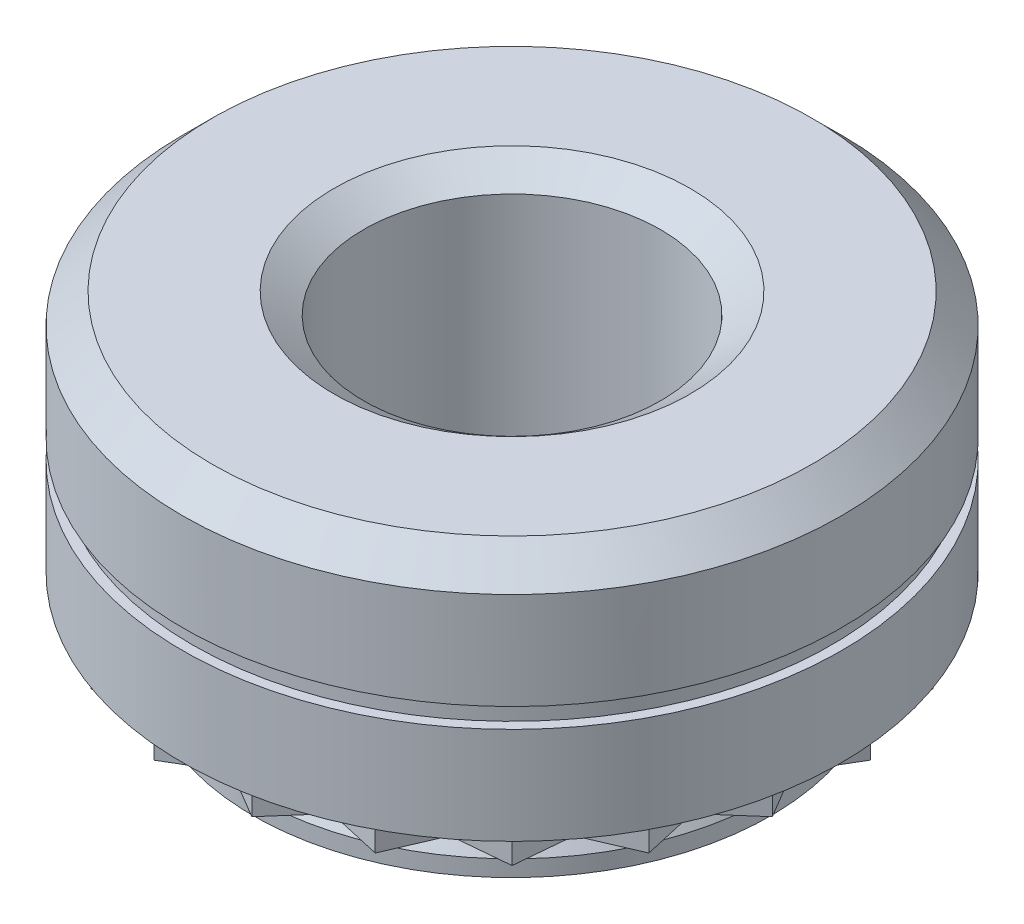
ISO-10303-21;
HEADER;
FILE_DESCRIPTION(('STEP AP214'),'2;1');
FILE_NAME('part.step','',(''),(''),'','','');
FILE_SCHEMA(('AUTOMOTIVE_DESIGN { 1 0 10303 214 1 1 1 1 }'));
ENDSEC;
DATA;
#1=APPLICATION_CONTEXT('core data for automotive mechanical design processes');
#2=APPLICATION_PROTOCOL_DEFINITION('international standard','automotive_design',2000,#1);
#3=PRODUCT_CONTEXT('',#1,'mechanical');
#4=PRODUCT('Part','Part','',(#3));
#5=PRODUCT_RELATED_PRODUCT_CATEGORY('part','',(#4));
#6=PRODUCT_DEFINITION_FORMATION('','',#4);
#7=PRODUCT_DEFINITION_CONTEXT('part definition',#1,'design');
#8=PRODUCT_DEFINITION('design','',#6,#7);
#9=PRODUCT_DEFINITION_SHAPE('','',#8);
#10=(LENGTH_UNIT() NAMED_UNIT(*) SI_UNIT(.MILLI.,.METRE.));
#11=(NAMED_UNIT(*) PLANE_ANGLE_UNIT() SI_UNIT($,.RADIAN.));
#12=(NAMED_UNIT(*) SI_UNIT($,.STERADIAN.) SOLID_ANGLE_UNIT());
#13=UNCERTAINTY_MEASURE_WITH_UNIT(LENGTH_MEASURE(1.E-05),#10,'distance_accuracy_value','');
#14=(GEOMETRIC_REPRESENTATION_CONTEXT(3) GLOBAL_UNCERTAINTY_ASSIGNED_CONTEXT((#13)) GLOBAL_UNIT_ASSIGNED_CONTEXT((#10,
#11,#12)) REPRESENTATION_CONTEXT('',''));
#15=CARTESIAN_POINT('',(0.,0.,0.));
#16=DIRECTION('',(0.,0.,1.));
#17=DIRECTION('',(1.,0.,0.));
#18=AXIS2_PLACEMENT_3D('',#15,#16,#17);
#19=CARTESIAN_POINT('',(4.04361205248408,0.,0.));
#20=DIRECTION('',(0.,-1.,0.));
#21=DIRECTION('',(0.,0.,-1.));
#22=AXIS2_PLACEMENT_3D('',#19,#20,#21);
#23=PLANE('',#22);
#24=CARTESIAN_POINT('',(0.,0.,0.));
#25=DIRECTION('',(0.,-1.,0.));
#26=DIRECTION('',(0.,0.,-1.));
#27=AXIS2_PLACEMENT_3D('',#24,#25,#26);
#28=CIRCLE('',#27,5.55);
#29=CARTESIAN_POINT('',(0.,0.,-5.55));
#30=VERTEX_POINT('',#29);
#31=EDGE_CURVE('E190',#30,#30,#28,.T.);
#32=ORIENTED_EDGE('',*,*,#31,.T.);
#33=EDGE_LOOP('',(#32));
#34=FACE_BOUND('',#33,.T.);
#35=DIRECTION('',(-0.859689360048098,0.,-0.510817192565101));
#36=VECTOR('',#35,1.);
#37=CARTESIAN_POINT('',(0.824800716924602,0.,5.20758677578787));
#38=LINE('',#37,#36);
#39=CARTESIAN_POINT('',(0.824800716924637,0.,5.20758677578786));
#40=VERTEX_POINT('',#39);
#41=CARTESIAN_POINT('',(0.,0.,4.7175));
#42=VERTEX_POINT('',#41);
#43=EDGE_CURVE('E70',#40,#42,#38,.T.);
#44=ORIENTED_EDGE('',*,*,#43,.F.);
#45=DIRECTION('',(-0.659761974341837,0.,0.751474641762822));
#46=VECTOR('',#45,1.);
#47=CARTESIAN_POINT('',(1.45778767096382,0.,4.48660911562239));
#48=LINE('',#47,#46);
#49=CARTESIAN_POINT('',(1.45778767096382,0.,4.48660911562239));
#50=VERTEX_POINT('',#49);
#51=EDGE_CURVE('E643',#50,#40,#48,.T.);
#52=ORIENTED_EDGE('',*,*,#51,.F.);
#53=DIRECTION('',(-0.975464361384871,0.,-0.22015739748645));
#54=VECTOR('',#53,1.);
#55=CARTESIAN_POINT('',(2.39366490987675,0.,4.69783189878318));
#56=LINE('',#55,#54);
#57=CARTESIAN_POINT('',(2.39366490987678,0.,4.69783189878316));
#58=VERTEX_POINT('',#57);
#59=EDGE_CURVE('E645',#58,#50,#56,.T.);
#60=ORIENTED_EDGE('',*,*,#59,.F.);
#61=DIRECTION('',(-0.395252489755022,0.,0.918572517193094));
#62=VECTOR('',#61,1.);
#63=CARTESIAN_POINT('',(2.77287692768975,0.,3.81653767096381));
#64=LINE('',#63,#62);
#65=CARTESIAN_POINT('',(2.77287692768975,0.,3.81653767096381));
#66=VERTEX_POINT('',#65);
#67=EDGE_CURVE('E670',#66,#58,#64,.T.);
#68=ORIENTED_EDGE('',*,*,#67,.F.);
#69=DIRECTION('',(-0.995754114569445,0.,0.0920529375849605));
#70=VECTOR('',#69,1.);
#71=CARTESIAN_POINT('',(3.72822050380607,0.,3.72822050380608));
#72=LINE('',#71,#70);
#73=CARTESIAN_POINT('',(3.72822050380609,0.,3.72822050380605));
#74=VERTEX_POINT('',#73);
#75=EDGE_CURVE('E673',#74,#66,#72,.T.);
#76=ORIENTED_EDGE('',*,*,#75,.F.);
#77=DIRECTION('',(-0.0920529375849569,0.,0.995754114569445));
#78=VECTOR('',#77,1.);
#79=CARTESIAN_POINT('',(3.81653767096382,0.,2.77287692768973));
#80=LINE('',#79,#78);
#81=CARTESIAN_POINT('',(3.81653767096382,0.,2.77287692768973));
#82=VERTEX_POINT('',#81);
#83=EDGE_CURVE('E704',#82,#74,#80,.T.);
#84=ORIENTED_EDGE('',*,*,#83,.F.);
#85=DIRECTION('',(-0.918572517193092,0.,0.395252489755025));
#86=VECTOR('',#85,1.);
#87=CARTESIAN_POINT('',(4.69783189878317,0.,2.39366490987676));
#88=LINE('',#87,#86);
#89=CARTESIAN_POINT('',(4.69783189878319,0.,2.39366490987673));
#90=VERTEX_POINT('',#89);
#91=EDGE_CURVE('E707',#90,#82,#88,.T.);
#92=ORIENTED_EDGE('',*,*,#91,.F.);
#93=DIRECTION('',(0.220157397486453,0.,0.97546436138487));
#94=VECTOR('',#93,1.);
#95=CARTESIAN_POINT('',(4.48660911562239,0.,1.4577876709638));
#96=LINE('',#95,#94);
#97=CARTESIAN_POINT('',(4.48660911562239,0.,1.4577876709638));
#98=VERTEX_POINT('',#97);
#99=EDGE_CURVE('E740',#98,#90,#96,.T.);
#100=ORIENTED_EDGE('',*,*,#99,.F.);
#101=DIRECTION('',(-0.751474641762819,0.,0.65976197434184));
#102=VECTOR('',#101,1.);
#103=CARTESIAN_POINT('',(5.20758677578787,0.,0.824800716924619));
#104=LINE('',#103,#102);
#105=CARTESIAN_POINT('',(5.20758677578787,0.,0.824800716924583));
#106=VERTEX_POINT('',#105);
#107=EDGE_CURVE('E743',#106,#98,#104,.T.);
#108=ORIENTED_EDGE('',*,*,#107,.F.);
#109=DIRECTION('',(0.510817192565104,0.,0.859689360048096));
#110=VECTOR('',#109,1.);
#111=CARTESIAN_POINT('',(4.7175,0.,0.));
#112=LINE('',#111,#110);
#113=CARTESIAN_POINT('',(4.7175,0.,0.));
#114=VERTEX_POINT('',#113);
#115=EDGE_CURVE('E776',#114,#106,#112,.T.);
#116=ORIENTED_EDGE('',*,*,#115,.F.);
#117=DIRECTION('',(-0.510817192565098,0.,0.8596893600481));
#118=VECTOR('',#117,1.);
#119=CARTESIAN_POINT('',(5.20758677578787,0.,-0.82480071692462));
#120=LINE('',#119,#118);
#121=CARTESIAN_POINT('',(5.20758677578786,0.,-0.824800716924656));
#122=VERTEX_POINT('',#121);
#123=EDGE_CURVE('E779',#122,#114,#120,.T.);
#124=ORIENTED_EDGE('',*,*,#123,.F.);
#125=DIRECTION('',(0.751474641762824,0.,0.659761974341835));
#126=VECTOR('',#125,1.);
#127=CARTESIAN_POINT('',(4.48660911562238,0.,-1.45778767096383));
#128=LINE('',#127,#126);
#129=CARTESIAN_POINT('',(4.48660911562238,0.,-1.45778767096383));
#130=VERTEX_POINT('',#129);
#131=EDGE_CURVE('E812',#130,#122,#128,.T.);
#132=ORIENTED_EDGE('',*,*,#131,.F.);
#133=DIRECTION('',(-0.220157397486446,0.,0.975464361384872));
#134=VECTOR('',#133,1.);
#135=CARTESIAN_POINT('',(4.69783189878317,0.,-2.39366490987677));
#136=LINE('',#135,#134);
#137=CARTESIAN_POINT('',(4.69783189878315,0.,-2.3936649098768));
#138=VERTEX_POINT('',#137);
#139=EDGE_CURVE('E815',#138,#130,#136,.T.);
#140=ORIENTED_EDGE('',*,*,#139,.F.);
#141=DIRECTION('',(0.918572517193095,0.,0.395252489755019));
#142=VECTOR('',#141,1.);
#143=CARTESIAN_POINT('',(3.8165376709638,0.,-2.77287692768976));
#144=LINE('',#143,#142);
#145=CARTESIAN_POINT('',(3.8165376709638,0.,-2.77287692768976));
#146=VERTEX_POINT('',#145);
#147=EDGE_CURVE('E848',#146,#138,#144,.T.);
#148=ORIENTED_EDGE('',*,*,#147,.F.);
#149=DIRECTION('',(0.0920529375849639,0.,0.995754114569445));
#150=VECTOR('',#149,1.);
#151=CARTESIAN_POINT('',(3.72822050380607,0.,-3.72822050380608));
#152=LINE('',#151,#150);
#153=CARTESIAN_POINT('',(3.72822050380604,0.,-3.72822050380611));
#154=VERTEX_POINT('',#153);
#155=EDGE_CURVE('E851',#154,#146,#152,.T.);
#156=ORIENTED_EDGE('',*,*,#155,.F.);
#157=DIRECTION('',(0.995754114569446,0.,0.0920529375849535));
#158=VECTOR('',#157,1.);
#159=CARTESIAN_POINT('',(2.77287692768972,0.,-3.81653767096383));
#160=LINE('',#159,#158);
#161=CARTESIAN_POINT('',(2.77287692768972,0.,-3.81653767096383));
#162=VERTEX_POINT('',#161);
#163=EDGE_CURVE('E884',#162,#154,#160,.T.);
#164=ORIENTED_EDGE('',*,*,#163,.F.);
#165=DIRECTION('',(0.395252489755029,0.,0.918572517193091));
#166=VECTOR('',#165,1.);
#167=CARTESIAN_POINT('',(2.39366490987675,0.,-4.69783189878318));
#168=LINE('',#167,#166);
#169=CARTESIAN_POINT('',(2.39366490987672,0.,-4.69783189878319));
#170=VERTEX_POINT('',#169);
#171=EDGE_CURVE('E887',#170,#162,#168,.T.);
#172=ORIENTED_EDGE('',*,*,#171,.F.);
#173=DIRECTION('',(0.975464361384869,0.,-0.220157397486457));
#174=VECTOR('',#173,1.);
#175=CARTESIAN_POINT('',(1.45778767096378,0.,-4.4866091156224));
#176=LINE('',#175,#174);
#177=CARTESIAN_POINT('',(1.45778767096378,0.,-4.4866091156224));
#178=VERTEX_POINT('',#177);
#179=EDGE_CURVE('E920',#178,#170,#176,.T.);
#180=ORIENTED_EDGE('',*,*,#179,.F.);
#181=DIRECTION('',(0.659761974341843,0.,0.751474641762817));
#182=VECTOR('',#181,1.);
#183=CARTESIAN_POINT('',(0.824800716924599,0.,-5.20758677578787));
#184=LINE('',#183,#182);
#185=CARTESIAN_POINT('',(0.824800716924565,0.,-5.20758677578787));
#186=VERTEX_POINT('',#185);
#187=EDGE_CURVE('E923',#186,#178,#184,.T.);
#188=ORIENTED_EDGE('',*,*,#187,.F.);
#189=DIRECTION('',(0.859689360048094,0.,-0.510817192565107));
#190=VECTOR('',#189,1.);
#191=CARTESIAN_POINT('',(0.,0.,-4.7175));
#192=LINE('',#191,#190);
#193=CARTESIAN_POINT('',(0.,0.,-4.7175));
#194=VERTEX_POINT('',#193);
#195=EDGE_CURVE('E956',#194,#186,#192,.T.);
#196=ORIENTED_EDGE('',*,*,#195,.F.);
#197=DIRECTION('',(0.859689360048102,0.,0.510817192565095));
#198=VECTOR('',#197,1.);
#199=CARTESIAN_POINT('',(-0.824800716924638,0.,-5.20758677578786));
#200=LINE('',#199,#198);
#201=CARTESIAN_POINT('',(-0.824800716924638,0.,-5.20758677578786));
#202=VERTEX_POINT('',#201);
#203=EDGE_CURVE('E959',#202,#194,#200,.T.);
#204=ORIENTED_EDGE('',*,*,#203,.F.);
#205=DIRECTION('',(0.659761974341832,0.,-0.751474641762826));
#206=VECTOR('',#205,1.);
#207=CARTESIAN_POINT('',(-1.45778767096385,0.,-4.48660911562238));
#208=LINE('',#207,#206);
#209=CARTESIAN_POINT('',(-1.45778767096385,0.,-4.48660911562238));
#210=VERTEX_POINT('',#209);
#211=EDGE_CURVE('E992',#210,#202,#208,.T.);
#212=ORIENTED_EDGE('',*,*,#211,.F.);
#213=DIRECTION('',(0.975464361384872,0.,0.220157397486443));
#214=VECTOR('',#213,1.);
#215=CARTESIAN_POINT('',(-2.39366490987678,0.,-4.69783189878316));
#216=LINE('',#215,#214);
#217=CARTESIAN_POINT('',(-2.39366490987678,0.,-4.69783189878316));
#218=VERTEX_POINT('',#217);
#219=EDGE_CURVE('E995',#218,#210,#216,.T.);
#220=ORIENTED_EDGE('',*,*,#219,.F.);
#221=DIRECTION('',(0.395252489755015,0.,-0.918572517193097));
#222=VECTOR('',#221,1.);
#223=CARTESIAN_POINT('',(-2.77287692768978,0.,-3.81653767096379));
#224=LINE('',#223,#222);
#225=CARTESIAN_POINT('',(-2.77287692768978,0.,-3.81653767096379));
#226=VERTEX_POINT('',#225);
#227=EDGE_CURVE('E1028',#226,#218,#224,.T.);
#228=ORIENTED_EDGE('',*,*,#227,.F.);
#229=DIRECTION('',(0.995754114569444,0.,-0.0920529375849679));
#230=VECTOR('',#229,1.);
#231=CARTESIAN_POINT('',(-3.72822050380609,0.,-3.72822050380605));
#232=LINE('',#231,#230);
#233=CARTESIAN_POINT('',(-3.72822050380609,0.,-3.72822050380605));
#234=VERTEX_POINT('',#233);
#235=EDGE_CURVE('E1031',#234,#226,#232,.T.);
#236=ORIENTED_EDGE('',*,*,#235,.F.);
#237=DIRECTION('',(0.0920529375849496,0.,-0.995754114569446));
#238=VECTOR('',#237,1.);
#239=CARTESIAN_POINT('',(-3.81653767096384,0.,-2.77287692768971));
#240=LINE('',#239,#238);
#241=CARTESIAN_POINT('',(-3.81653767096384,0.,-2.77287692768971));
#242=VERTEX_POINT('',#241);
#243=EDGE_CURVE('E1064',#242,#234,#240,.T.);
#244=ORIENTED_EDGE('',*,*,#243,.F.);
#245=DIRECTION('',(0.918572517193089,0.,-0.395252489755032));
#246=VECTOR('',#245,1.);
#247=CARTESIAN_POINT('',(-4.69783189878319,0.,-2.39366490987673));
#248=LINE('',#247,#246);
#249=CARTESIAN_POINT('',(-4.69783189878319,0.,-2.39366490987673));
#250=VERTEX_POINT('',#249);
#251=EDGE_CURVE('E1067',#250,#242,#248,.T.);
#252=ORIENTED_EDGE('',*,*,#251,.F.);
#253=DIRECTION('',(-0.22015739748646,0.,-0.975464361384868));
#254=VECTOR('',#253,1.);
#255=CARTESIAN_POINT('',(-4.4866091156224,0.,-1.45778767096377));
#256=LINE('',#255,#254);
#257=CARTESIAN_POINT('',(-4.4866091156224,0.,-1.45778767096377));
#258=VERTEX_POINT('',#257);
#259=EDGE_CURVE('E1100',#258,#250,#256,.T.);
#260=ORIENTED_EDGE('',*,*,#259,.F.);
#261=DIRECTION('',(0.751474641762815,0.,-0.659761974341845));
#262=VECTOR('',#261,1.);
#263=CARTESIAN_POINT('',(-5.20758677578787,0.,-0.824800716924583));
#264=LINE('',#263,#262);
#265=CARTESIAN_POINT('',(-5.20758677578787,0.,-0.824800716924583));
#266=VERTEX_POINT('',#265);
#267=EDGE_CURVE('E1103',#266,#258,#264,.T.);
#268=ORIENTED_EDGE('',*,*,#267,.F.);
#269=DIRECTION('',(-0.51081719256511,0.,-0.859689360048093));
#270=VECTOR('',#269,1.);
#271=CARTESIAN_POINT('',(-4.7175,0.,0.));
#272=LINE('',#271,#270);
#273=CARTESIAN_POINT('',(-4.7175,0.,0.));
#274=VERTEX_POINT('',#273);
#275=EDGE_CURVE('E1136',#274,#266,#272,.T.);
#276=ORIENTED_EDGE('',*,*,#275,.F.);
#277=DIRECTION('',(0.510817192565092,0.,-0.859689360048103));
#278=VECTOR('',#277,1.);
#279=CARTESIAN_POINT('',(-5.20758677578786,0.,0.824800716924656));
#280=LINE('',#279,#278);
#281=CARTESIAN_POINT('',(-5.20758677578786,0.,0.824800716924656));
#282=VERTEX_POINT('',#281);
#283=EDGE_CURVE('E1139',#282,#274,#280,.T.);
#284=ORIENTED_EDGE('',*,*,#283,.F.);
#285=DIRECTION('',(-0.751474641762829,0.,-0.659761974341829));
#286=VECTOR('',#285,1.);
#287=CARTESIAN_POINT('',(-4.48660911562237,0.,1.45778767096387));
#288=LINE('',#287,#286);
#289=CARTESIAN_POINT('',(-4.48660911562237,0.,1.45778767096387));
#290=VERTEX_POINT('',#289);
#291=EDGE_CURVE('E1172',#290,#282,#288,.T.);
#292=ORIENTED_EDGE('',*,*,#291,.F.);
#293=DIRECTION('',(0.22015739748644,0.,-0.975464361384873));
#294=VECTOR('',#293,1.);
#295=CARTESIAN_POINT('',(-4.69783189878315,0.,2.3936649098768));
#296=LINE('',#295,#294);
#297=CARTESIAN_POINT('',(-4.69783189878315,0.,2.3936649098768));
#298=VERTEX_POINT('',#297);
#299=EDGE_CURVE('E1175',#298,#290,#296,.T.);
#300=ORIENTED_EDGE('',*,*,#299,.F.);
#301=DIRECTION('',(-0.918572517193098,0.,-0.395252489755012));
#302=VECTOR('',#301,1.);
#303=CARTESIAN_POINT('',(-3.81653767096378,0.,2.77287692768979));
#304=LINE('',#303,#302);
#305=CARTESIAN_POINT('',(-3.81653767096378,0.,2.77287692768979));
#306=VERTEX_POINT('',#305);
#307=EDGE_CURVE('E1208',#306,#298,#304,.T.);
#308=ORIENTED_EDGE('',*,*,#307,.F.);
#309=DIRECTION('',(-0.0920529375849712,0.,-0.995754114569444));
#310=VECTOR('',#309,1.);
#311=CARTESIAN_POINT('',(-3.72822050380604,0.,3.72822050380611));
#312=LINE('',#311,#310);
#313=CARTESIAN_POINT('',(-3.72822050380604,0.,3.72822050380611));
#314=VERTEX_POINT('',#313);
#315=EDGE_CURVE('E1211',#314,#306,#312,.T.);
#316=ORIENTED_EDGE('',*,*,#315,.F.);
#317=DIRECTION('',(-0.995754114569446,0.,-0.092052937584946));
#318=VECTOR('',#317,1.);
#319=CARTESIAN_POINT('',(-2.77287692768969,0.,3.81653767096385));
#320=LINE('',#319,#318);
#321=CARTESIAN_POINT('',(-2.77287692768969,0.,3.81653767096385));
#322=VERTEX_POINT('',#321);
#323=EDGE_CURVE('E1244',#322,#314,#320,.T.);
#324=ORIENTED_EDGE('',*,*,#323,.F.);
#325=DIRECTION('',(-0.395252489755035,0.,-0.918572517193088));
#326=VECTOR('',#325,1.);
#327=CARTESIAN_POINT('',(-2.39366490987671,0.,4.6978318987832));
#328=LINE('',#327,#326);
#329=CARTESIAN_POINT('',(-2.39366490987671,0.,4.6978318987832));
#330=VERTEX_POINT('',#329);
#331=EDGE_CURVE('E1247',#330,#322,#328,.T.);
#332=ORIENTED_EDGE('',*,*,#331,.F.);
#333=DIRECTION('',(-0.975464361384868,0.,0.220157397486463));
#334=VECTOR('',#333,1.);
#335=CARTESIAN_POINT('',(-1.45778767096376,0.,4.48660911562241));
#336=LINE('',#335,#334);
#337=CARTESIAN_POINT('',(-1.45778767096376,0.,4.48660911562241));
#338=VERTEX_POINT('',#337);
#339=EDGE_CURVE('E1267',#338,#330,#336,.T.);
#340=ORIENTED_EDGE('',*,*,#339,.F.);
#341=DIRECTION('',(-0.659761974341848,0.,-0.751474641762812));
#342=VECTOR('',#341,1.);
#343=CARTESIAN_POINT('',(-0.824800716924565,0.,5.20758677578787));
#344=LINE('',#343,#342);
#345=CARTESIAN_POINT('',(-0.824800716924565,0.,5.20758677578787));
#346=VERTEX_POINT('',#345);
#347=EDGE_CURVE('E1270',#346,#338,#344,.T.);
#348=ORIENTED_EDGE('',*,*,#347,.F.);
#349=DIRECTION('',(-0.859689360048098,0.,0.510817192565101));
#350=VECTOR('',#349,1.);
#351=CARTESIAN_POINT('',(0.,0.,4.7175));
#352=LINE('',#351,#350);
#353=EDGE_CURVE('E621',#42,#346,#352,.T.);
#354=ORIENTED_EDGE('',*,*,#353,.F.);
#355=EDGE_LOOP('',(#44,#52,#60,#68,#76,#84,#92,#100,#108,#116,#124,#132,#140,#148,#156,#164,
#172,#180,#188,#196,#204,#212,#220,#228,#236,#244,#252,#260,#268,#276,#284,#292,#300,#308,#316,
#324,#332,#340,#348,#354));
#356=FACE_BOUND('',#355,.T.);
#357=ADVANCED_FACE('F33',(#34,#356),#23,.T.);
#358=CARTESIAN_POINT('',(0.,0.,0.));
#359=DIRECTION('',(0.,-1.,0.));
#360=DIRECTION('',(0.,0.,-1.));
#361=AXIS2_PLACEMENT_3D('',#358,#359,#360);
#362=CIRCLE('',#361,4.04361205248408);
#363=CARTESIAN_POINT('',(0.,0.,-4.04361205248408));
#364=VERTEX_POINT('',#363);
#365=EDGE_CURVE('E187',#364,#364,#362,.T.);
#366=ORIENTED_EDGE('',*,*,#365,.F.);
#367=EDGE_LOOP('',(#366));
#368=FACE_BOUND('',#367,.T.);
#369=DIRECTION('',(0.975464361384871,0.,0.220157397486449));
#370=VECTOR('',#369,1.);
#371=CARTESIAN_POINT('',(1.39947616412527,0.,4.30714475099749));
#372=LINE('',#371,#370);
#373=CARTESIAN_POINT('',(1.39947616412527,0.,4.30714475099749));
#374=VERTEX_POINT('',#373);
#375=CARTESIAN_POINT('',(2.29791831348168,0.,4.50991862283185));
#376=VERTEX_POINT('',#375);
#377=EDGE_CURVE('E104',#374,#376,#372,.T.);
#378=ORIENTED_EDGE('',*,*,#377,.F.);
#379=DIRECTION('',(0.659761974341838,0.,-0.751474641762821));
#380=VECTOR('',#379,1.);
#381=CARTESIAN_POINT('',(0.791808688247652,0.,4.99928330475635));
#382=LINE('',#381,#380);
#383=CARTESIAN_POINT('',(0.791808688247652,0.,4.99928330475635));
#384=VERTEX_POINT('',#383);
#385=EDGE_CURVE('E641',#384,#374,#382,.T.);
#386=ORIENTED_EDGE('',*,*,#385,.F.);
#387=DIRECTION('',(0.859689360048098,0.,0.5108171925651));
#388=VECTOR('',#387,1.);
#389=CARTESIAN_POINT('',(0.,0.,4.5288));
#390=LINE('',#389,#388);
#391=CARTESIAN_POINT('',(0.,0.,4.5288));
#392=VERTEX_POINT('',#391);
#393=EDGE_CURVE('E138',#392,#384,#390,.T.);
#394=ORIENTED_EDGE('',*,*,#393,.F.);
#395=DIRECTION('',(0.859689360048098,0.,-0.5108171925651));
#396=VECTOR('',#395,1.);
#397=CARTESIAN_POINT('',(-0.791808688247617,0.,4.99928330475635));
#398=LINE('',#397,#396);
#399=CARTESIAN_POINT('',(-0.791808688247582,0.,4.99928330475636));
#400=VERTEX_POINT('',#399);
#401=EDGE_CURVE('E620',#400,#392,#398,.T.);
#402=ORIENTED_EDGE('',*,*,#401,.F.);
#403=DIRECTION('',(0.659761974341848,0.,0.751474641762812));
#404=VECTOR('',#403,1.);
#405=CARTESIAN_POINT('',(-1.39947616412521,0.,4.30714475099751));
#406=LINE('',#405,#404);
#407=CARTESIAN_POINT('',(-1.39947616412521,0.,4.30714475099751));
#408=VERTEX_POINT('',#407);
#409=EDGE_CURVE('E607',#408,#400,#406,.T.);
#410=ORIENTED_EDGE('',*,*,#409,.F.);
#411=DIRECTION('',(0.975464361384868,0.,-0.220157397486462));
#412=VECTOR('',#411,1.);
#413=CARTESIAN_POINT('',(-2.29791831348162,0.,4.50991862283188));
#414=LINE('',#413,#412);
#415=CARTESIAN_POINT('',(-2.29791831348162,0.,4.50991862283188));
#416=VERTEX_POINT('',#415);
#417=EDGE_CURVE('E618',#416,#408,#414,.T.);
#418=ORIENTED_EDGE('',*,*,#417,.F.);
#419=DIRECTION('',(0.395252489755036,0.,0.918572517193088));
#420=VECTOR('',#419,1.);
#421=CARTESIAN_POINT('',(-2.6619618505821,0.,3.6638761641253));
#422=LINE('',#421,#420);
#423=CARTESIAN_POINT('',(-2.6619618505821,0.,3.6638761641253));
#424=VERTEX_POINT('',#423);
#425=EDGE_CURVE('E1237',#424,#416,#422,.T.);
#426=ORIENTED_EDGE('',*,*,#425,.F.);
#427=DIRECTION('',(0.995754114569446,0.,0.0920529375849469));
#428=VECTOR('',#427,1.);
#429=CARTESIAN_POINT('',(-3.57909168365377,0.,3.57909168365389));
#430=LINE('',#429,#428);
#431=CARTESIAN_POINT('',(-3.57909168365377,0.,3.57909168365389));
#432=VERTEX_POINT('',#431);
#433=EDGE_CURVE('E1241',#432,#424,#430,.T.);
#434=ORIENTED_EDGE('',*,*,#433,.F.);
#435=DIRECTION('',(0.0920529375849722,0.,0.995754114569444));
#436=VECTOR('',#435,1.);
#437=CARTESIAN_POINT('',(-3.66387616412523,0.,2.6619618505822));
#438=LINE('',#437,#436);
#439=CARTESIAN_POINT('',(-3.66387616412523,0.,2.6619618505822));
#440=VERTEX_POINT('',#439);
#441=EDGE_CURVE('E1201',#440,#432,#438,.T.);
#442=ORIENTED_EDGE('',*,*,#441,.F.);
#443=DIRECTION('',(0.918572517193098,0.,0.395252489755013));
#444=VECTOR('',#443,1.);
#445=CARTESIAN_POINT('',(-4.50991862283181,0.,2.29791831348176));
#446=LINE('',#445,#444);
#447=CARTESIAN_POINT('',(-4.50991862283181,0.,2.29791831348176));
#448=VERTEX_POINT('',#447);
#449=EDGE_CURVE('E1205',#448,#440,#446,.T.);
#450=ORIENTED_EDGE('',*,*,#449,.F.);
#451=DIRECTION('',(-0.220157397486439,0.,0.975464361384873));
#452=VECTOR('',#451,1.);
#453=CARTESIAN_POINT('',(-4.30714475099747,0.,1.39947616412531));
#454=LINE('',#453,#452);
#455=CARTESIAN_POINT('',(-4.30714475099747,0.,1.39947616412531));
#456=VERTEX_POINT('',#455);
#457=EDGE_CURVE('E1165',#456,#448,#454,.T.);
#458=ORIENTED_EDGE('',*,*,#457,.F.);
#459=DIRECTION('',(0.751474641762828,0.,0.65976197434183));
#460=VECTOR('',#459,1.);
#461=CARTESIAN_POINT('',(-4.99928330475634,0.,0.791808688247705));
#462=LINE('',#461,#460);
#463=CARTESIAN_POINT('',(-4.99928330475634,0.,0.791808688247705));
#464=VERTEX_POINT('',#463);
#465=EDGE_CURVE('E1169',#464,#456,#462,.T.);
#466=ORIENTED_EDGE('',*,*,#465,.F.);
#467=DIRECTION('',(-0.510817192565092,0.,0.859689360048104));
#468=VECTOR('',#467,1.);
#469=CARTESIAN_POINT('',(-4.5288,0.,0.));
#470=LINE('',#469,#468);
#471=CARTESIAN_POINT('',(-4.5288,0.,0.));
#472=VERTEX_POINT('',#471);
#473=EDGE_CURVE('E1129',#472,#464,#470,.T.);
#474=ORIENTED_EDGE('',*,*,#473,.F.);
#475=DIRECTION('',(0.510817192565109,0.,0.859689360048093));
#476=VECTOR('',#475,1.);
#477=CARTESIAN_POINT('',(-4.99928330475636,0.,-0.791808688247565));
#478=LINE('',#477,#476);
#479=CARTESIAN_POINT('',(-4.99928330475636,0.,-0.791808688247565));
#480=VERTEX_POINT('',#479);
#481=EDGE_CURVE('E1133',#480,#472,#478,.T.);
#482=ORIENTED_EDGE('',*,*,#481,.F.);
#483=DIRECTION('',(-0.751474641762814,0.,0.659761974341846));
#484=VECTOR('',#483,1.);
#485=CARTESIAN_POINT('',(-4.3071447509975,0.,-1.39947616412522));
#486=LINE('',#485,#484);
#487=CARTESIAN_POINT('',(-4.3071447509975,0.,-1.39947616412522));
#488=VERTEX_POINT('',#487);
#489=EDGE_CURVE('E1093',#488,#480,#486,.T.);
#490=ORIENTED_EDGE('',*,*,#489,.F.);
#491=DIRECTION('',(0.220157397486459,0.,0.975464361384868));
#492=VECTOR('',#491,1.);
#493=CARTESIAN_POINT('',(-4.50991862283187,0.,-2.29791831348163));
#494=LINE('',#493,#492);
#495=CARTESIAN_POINT('',(-4.50991862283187,0.,-2.29791831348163));
#496=VERTEX_POINT('',#495);
#497=EDGE_CURVE('E1097',#496,#488,#494,.T.);
#498=ORIENTED_EDGE('',*,*,#497,.F.);
#499=DIRECTION('',(-0.918572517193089,0.,0.395252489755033));
#500=VECTOR('',#499,1.);
#501=CARTESIAN_POINT('',(-3.66387616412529,0.,-2.66196185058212));
#502=LINE('',#501,#500);
#503=CARTESIAN_POINT('',(-3.66387616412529,0.,-2.66196185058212));
#504=VERTEX_POINT('',#503);
#505=EDGE_CURVE('E1057',#504,#496,#502,.T.);
#506=ORIENTED_EDGE('',*,*,#505,.F.);
#507=DIRECTION('',(-0.0920529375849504,0.,0.995754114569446));
#508=VECTOR('',#507,1.);
#509=CARTESIAN_POINT('',(-3.57909168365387,0.,-3.57909168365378));
#510=LINE('',#509,#508);
#511=CARTESIAN_POINT('',(-3.57909168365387,0.,-3.57909168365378));
#512=VERTEX_POINT('',#511);
#513=EDGE_CURVE('E1061',#512,#504,#510,.T.);
#514=ORIENTED_EDGE('',*,*,#513,.F.);
#515=DIRECTION('',(-0.995754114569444,0.,0.0920529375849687));
#516=VECTOR('',#515,1.);
#517=CARTESIAN_POINT('',(-2.66196185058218,0.,-3.66387616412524));
#518=LINE('',#517,#516);
#519=CARTESIAN_POINT('',(-2.66196185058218,0.,-3.66387616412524));
#520=VERTEX_POINT('',#519);
#521=EDGE_CURVE('E1021',#520,#512,#518,.T.);
#522=ORIENTED_EDGE('',*,*,#521,.F.);
#523=DIRECTION('',(-0.395252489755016,0.,0.918572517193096));
#524=VECTOR('',#523,1.);
#525=CARTESIAN_POINT('',(-2.29791831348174,0.,-4.50991862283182));
#526=LINE('',#525,#524);
#527=CARTESIAN_POINT('',(-2.29791831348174,0.,-4.50991862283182));
#528=VERTEX_POINT('',#527);
#529=EDGE_CURVE('E1025',#528,#520,#526,.T.);
#530=ORIENTED_EDGE('',*,*,#529,.F.);
#531=DIRECTION('',(-0.975464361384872,0.,-0.220157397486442));
#532=VECTOR('',#531,1.);
#533=CARTESIAN_POINT('',(-1.3994761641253,0.,-4.30714475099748));
#534=LINE('',#533,#532);
#535=CARTESIAN_POINT('',(-1.3994761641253,0.,-4.30714475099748));
#536=VERTEX_POINT('',#535);
#537=EDGE_CURVE('E985',#536,#528,#534,.T.);
#538=ORIENTED_EDGE('',*,*,#537,.F.);
#539=DIRECTION('',(-0.659761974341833,0.,0.751474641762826));
#540=VECTOR('',#539,1.);
#541=CARTESIAN_POINT('',(-0.791808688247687,0.,-4.99928330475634));
#542=LINE('',#541,#540);
#543=CARTESIAN_POINT('',(-0.791808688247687,0.,-4.99928330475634));
#544=VERTEX_POINT('',#543);
#545=EDGE_CURVE('E989',#544,#536,#542,.T.);
#546=ORIENTED_EDGE('',*,*,#545,.F.);
#547=DIRECTION('',(-0.859689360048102,0.,-0.510817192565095));
#548=VECTOR('',#547,1.);
#549=CARTESIAN_POINT('',(0.,0.,-4.5288));
#550=LINE('',#549,#548);
#551=CARTESIAN_POINT('',(0.,0.,-4.5288));
#552=VERTEX_POINT('',#551);
#553=EDGE_CURVE('E949',#552,#544,#550,.T.);
#554=ORIENTED_EDGE('',*,*,#553,.F.);
#555=DIRECTION('',(-0.859689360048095,0.,0.510817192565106));
#556=VECTOR('',#555,1.);
#557=CARTESIAN_POINT('',(0.791808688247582,0.,-4.99928330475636));
#558=LINE('',#557,#556);
#559=CARTESIAN_POINT('',(0.791808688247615,0.,-4.99928330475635));
#560=VERTEX_POINT('',#559);
#561=EDGE_CURVE('E953',#560,#552,#558,.T.);
#562=ORIENTED_EDGE('',*,*,#561,.F.);
#563=DIRECTION('',(-0.659761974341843,0.,-0.751474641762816));
#564=VECTOR('',#563,1.);
#565=CARTESIAN_POINT('',(1.39947616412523,0.,-4.3071447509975));
#566=LINE('',#565,#564);
#567=CARTESIAN_POINT('',(1.39947616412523,0.,-4.3071447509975));
#568=VERTEX_POINT('',#567);
#569=EDGE_CURVE('E913',#568,#560,#566,.T.);
#570=ORIENTED_EDGE('',*,*,#569,.F.);
#571=DIRECTION('',(-0.975464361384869,0.,0.220157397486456));
#572=VECTOR('',#571,1.);
#573=CARTESIAN_POINT('',(2.29791831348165,0.,-4.50991862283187));
#574=LINE('',#573,#572);
#575=CARTESIAN_POINT('',(2.29791831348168,0.,-4.50991862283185));
#576=VERTEX_POINT('',#575);
#577=EDGE_CURVE('E917',#576,#568,#574,.T.);
#578=ORIENTED_EDGE('',*,*,#577,.F.);
#579=DIRECTION('',(-0.395252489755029,0.,-0.918572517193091));
#580=VECTOR('',#579,1.);
#581=CARTESIAN_POINT('',(2.66196185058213,0.,-3.66387616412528));
#582=LINE('',#581,#580);
#583=CARTESIAN_POINT('',(2.66196185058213,0.,-3.66387616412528));
#584=VERTEX_POINT('',#583);
#585=EDGE_CURVE('E877',#584,#576,#582,.T.);
#586=ORIENTED_EDGE('',*,*,#585,.F.);
#587=DIRECTION('',(-0.995754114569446,0.,-0.0920529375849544));
#588=VECTOR('',#587,1.);
#589=CARTESIAN_POINT('',(3.5790916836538,0.,-3.57909168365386));
#590=LINE('',#589,#588);
#591=CARTESIAN_POINT('',(3.57909168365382,0.,-3.57909168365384));
#592=VERTEX_POINT('',#591);
#593=EDGE_CURVE('E881',#592,#584,#590,.T.);
#594=ORIENTED_EDGE('',*,*,#593,.F.);
#595=DIRECTION('',(-0.0920529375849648,0.,-0.995754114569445));
#596=VECTOR('',#595,1.);
#597=CARTESIAN_POINT('',(3.66387616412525,0.,-2.66196185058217));
#598=LINE('',#597,#596);
#599=CARTESIAN_POINT('',(3.66387616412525,0.,-2.66196185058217));
#600=VERTEX_POINT('',#599);
#601=EDGE_CURVE('E841',#600,#592,#598,.T.);
#602=ORIENTED_EDGE('',*,*,#601,.F.);
#603=DIRECTION('',(-0.918572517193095,0.,-0.39525248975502));
#604=VECTOR('',#603,1.);
#605=CARTESIAN_POINT('',(4.50991862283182,0.,-2.29791831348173));
#606=LINE('',#605,#604);
#607=CARTESIAN_POINT('',(4.50991862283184,0.,-2.2979183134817));
#608=VERTEX_POINT('',#607);
#609=EDGE_CURVE('E845',#608,#600,#606,.T.);
#610=ORIENTED_EDGE('',*,*,#609,.F.);
#611=DIRECTION('',(0.220157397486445,0.,-0.975464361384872));
#612=VECTOR('',#611,1.);
#613=CARTESIAN_POINT('',(4.30714475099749,0.,-1.39947616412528));
#614=LINE('',#613,#612);
#615=CARTESIAN_POINT('',(4.30714475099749,0.,-1.39947616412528));
#616=VERTEX_POINT('',#615);
#617=EDGE_CURVE('E805',#616,#608,#614,.T.);
#618=ORIENTED_EDGE('',*,*,#617,.F.);
#619=DIRECTION('',(-0.751474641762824,0.,-0.659761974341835));
#620=VECTOR('',#619,1.);
#621=CARTESIAN_POINT('',(4.99928330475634,0.,-0.79180868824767));
#622=LINE('',#621,#620);
#623=CARTESIAN_POINT('',(4.99928330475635,0.,-0.791808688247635));
#624=VERTEX_POINT('',#623);
#625=EDGE_CURVE('E809',#624,#616,#622,.T.);
#626=ORIENTED_EDGE('',*,*,#625,.F.);
#627=DIRECTION('',(0.510817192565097,0.,-0.8596893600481));
#628=VECTOR('',#627,1.);
#629=CARTESIAN_POINT('',(4.5288,0.,0.));
#630=LINE('',#629,#628);
#631=CARTESIAN_POINT('',(4.5288,0.,0.));
#632=VERTEX_POINT('',#631);
#633=EDGE_CURVE('E769',#632,#624,#630,.T.);
#634=ORIENTED_EDGE('',*,*,#633,.F.);
#635=DIRECTION('',(-0.510817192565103,0.,-0.859689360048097));
#636=VECTOR('',#635,1.);
#637=CARTESIAN_POINT('',(4.99928330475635,0.,0.7918086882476));
#638=LINE('',#637,#636);
#639=CARTESIAN_POINT('',(4.99928330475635,0.,0.791808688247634));
#640=VERTEX_POINT('',#639);
#641=EDGE_CURVE('E773',#640,#632,#638,.T.);
#642=ORIENTED_EDGE('',*,*,#641,.F.);
#643=DIRECTION('',(0.751474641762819,0.,-0.659761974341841));
#644=VECTOR('',#643,1.);
#645=CARTESIAN_POINT('',(4.3071447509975,0.,1.39947616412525));
#646=LINE('',#645,#644);
#647=CARTESIAN_POINT('',(4.3071447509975,0.,1.39947616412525));
#648=VERTEX_POINT('',#647);
#649=EDGE_CURVE('E733',#648,#640,#646,.T.);
#650=ORIENTED_EDGE('',*,*,#649,.F.);
#651=DIRECTION('',(-0.220157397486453,0.,-0.97546436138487));
#652=VECTOR('',#651,1.);
#653=CARTESIAN_POINT('',(4.50991862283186,0.,2.29791831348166));
#654=LINE('',#653,#652);
#655=CARTESIAN_POINT('',(4.50991862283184,0.,2.29791831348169));
#656=VERTEX_POINT('',#655);
#657=EDGE_CURVE('E737',#656,#648,#654,.T.);
#658=ORIENTED_EDGE('',*,*,#657,.F.);
#659=DIRECTION('',(0.918572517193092,0.,-0.395252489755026));
#660=VECTOR('',#659,1.);
#661=CARTESIAN_POINT('',(3.66387616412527,0.,2.66196185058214));
#662=LINE('',#661,#660);
#663=CARTESIAN_POINT('',(3.66387616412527,0.,2.66196185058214));
#664=VERTEX_POINT('',#663);
#665=EDGE_CURVE('E697',#664,#656,#662,.T.);
#666=ORIENTED_EDGE('',*,*,#665,.F.);
#667=DIRECTION('',(0.0920529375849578,0.,-0.995754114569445));
#668=VECTOR('',#667,1.);
#669=CARTESIAN_POINT('',(3.57909168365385,0.,3.57909168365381));
#670=LINE('',#669,#668);
#671=CARTESIAN_POINT('',(3.57909168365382,0.,3.57909168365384));
#672=VERTEX_POINT('',#671);
#673=EDGE_CURVE('E701',#672,#664,#670,.T.);
#674=ORIENTED_EDGE('',*,*,#673,.F.);
#675=DIRECTION('',(0.995754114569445,0.,-0.0920529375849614));
#676=VECTOR('',#675,1.);
#677=CARTESIAN_POINT('',(2.66196185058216,0.,3.66387616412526));
#678=LINE('',#677,#676);
#679=CARTESIAN_POINT('',(2.66196185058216,0.,3.66387616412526));
#680=VERTEX_POINT('',#679);
#681=EDGE_CURVE('E663',#680,#672,#678,.T.);
#682=ORIENTED_EDGE('',*,*,#681,.F.);
#683=DIRECTION('',(0.395252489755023,0.,-0.918572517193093));
#684=VECTOR('',#683,1.);
#685=CARTESIAN_POINT('',(2.29791831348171,0.,4.50991862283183));
#686=LINE('',#685,#684);
#687=EDGE_CURVE('E667',#376,#680,#686,.T.);
#688=ORIENTED_EDGE('',*,*,#687,.F.);
#689=EDGE_LOOP('',(#378,#386,#394,#402,#410,#418,#426,#434,#442,#450,#458,#466,#474,#482,#490,
#498,#506,#514,#522,#530,#538,#546,#554,#562,#570,#578,#586,#594,#602,#610,#618,#626,#634,#642,
#650,#658,#666,#674,#682,#688));
#690=FACE_BOUND('',#689,.T.);
#691=ADVANCED_FACE('F215',(#368,#690),#23,.T.);
#692=CARTESIAN_POINT('',(0.,0.,0.));
#693=DIRECTION('',(0.,-1.,0.));
#694=DIRECTION('',(0.,0.,-1.));
#695=AXIS2_PLACEMENT_3D('',#692,#693,#694);
#696=CYLINDRICAL_SURFACE('',#695,5.55);
#697=CARTESIAN_POINT('',(0.,1.6335,0.));
#698=DIRECTION('',(0.,-1.,0.));
#699=DIRECTION('',(0.,0.,-1.));
#700=AXIS2_PLACEMENT_3D('',#697,#698,#699);
#701=CIRCLE('',#700,5.55);
#702=CARTESIAN_POINT('',(0.,1.6335,-5.55));
#703=VERTEX_POINT('',#702);
#704=EDGE_CURVE('E166',#703,#703,#701,.T.);
#705=ORIENTED_EDGE('',*,*,#704,.T.);
#706=EDGE_LOOP('',(#705));
#707=FACE_BOUND('',#706,.T.);
#708=ORIENTED_EDGE('',*,*,#31,.F.);
#709=EDGE_LOOP('',(#708));
#710=FACE_BOUND('',#709,.T.);
#711=ADVANCED_FACE('F221',(#707,#710),#696,.T.);
#712=CARTESIAN_POINT('',(0.,0.,0.));
#713=DIRECTION('',(0.,-1.,0.));
#714=DIRECTION('',(0.,0.,-1.));
#715=AXIS2_PLACEMENT_3D('',#712,#713,#714);
#716=CYLINDRICAL_SURFACE('',#715,4.04361205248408);
#717=ORIENTED_EDGE('',*,*,#365,.T.);
#718=EDGE_LOOP('',(#717));
#719=FACE_BOUND('',#718,.T.);
#720=CARTESIAN_POINT('',(0.,-0.548,0.));
#721=DIRECTION('',(0.,-1.,0.));
#722=DIRECTION('',(0.,0.,-1.));
#723=AXIS2_PLACEMENT_3D('',#720,#721,#722);
#724=CIRCLE('',#723,4.04361205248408);
#725=CARTESIAN_POINT('',(0.,-0.548,-4.04361205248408));
#726=VERTEX_POINT('',#725);
#727=EDGE_CURVE('E184',#726,#726,#724,.T.);
#728=ORIENTED_EDGE('',*,*,#727,.F.);
#729=EDGE_LOOP('',(#728));
#730=FACE_BOUND('',#729,.T.);
#731=ADVANCED_FACE('F225',(#719,#730),#716,.T.);
#732=CARTESIAN_POINT('',(0.,-1.096,0.));
#733=DIRECTION('',(0.,-1.,0.));
#734=DIRECTION('',(0.,0.,-1.));
#735=AXIS2_PLACEMENT_3D('',#732,#733,#734);
#736=CONICAL_SURFACE('',#735,4.36,0.523598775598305);
#737=ORIENTED_EDGE('',*,*,#727,.T.);
#738=EDGE_LOOP('',(#737));
#739=FACE_BOUND('',#738,.T.);
#740=CARTESIAN_POINT('',(0.,-1.096,0.));
#741=DIRECTION('',(0.,-1.,0.));
#742=DIRECTION('',(0.,0.,-1.));
#743=AXIS2_PLACEMENT_3D('',#740,#741,#742);
#744=CIRCLE('',#743,4.36);
#745=CARTESIAN_POINT('',(0.,-1.096,-4.36));
#746=VERTEX_POINT('',#745);
#747=EDGE_CURVE('E181',#746,#746,#744,.T.);
#748=ORIENTED_EDGE('',*,*,#747,.F.);
#749=EDGE_LOOP('',(#748));
#750=FACE_BOUND('',#749,.T.);
#751=ADVANCED_FACE('F232',(#739,#750),#736,.T.);
#752=CARTESIAN_POINT('',(0.,0.,0.));
#753=DIRECTION('',(0.,-1.,0.));
#754=DIRECTION('',(0.,0.,-1.));
#755=AXIS2_PLACEMENT_3D('',#752,#753,#754);
#756=CYLINDRICAL_SURFACE('',#755,4.36);
#757=ORIENTED_EDGE('',*,*,#747,.T.);
#758=EDGE_LOOP('',(#757));
#759=FACE_BOUND('',#758,.T.);
#760=CARTESIAN_POINT('',(0.,-1.37,0.));
#761=DIRECTION('',(0.,-1.,0.));
#762=DIRECTION('',(0.,0.,-1.));
#763=AXIS2_PLACEMENT_3D('',#760,#761,#762);
#764=CIRCLE('',#763,4.36);
#765=CARTESIAN_POINT('',(0.,-1.37,-4.36));
#766=VERTEX_POINT('',#765);
#767=EDGE_CURVE('E178',#766,#766,#764,.T.);
#768=ORIENTED_EDGE('',*,*,#767,.F.);
#769=EDGE_LOOP('',(#768));
#770=FACE_BOUND('',#769,.T.);
#771=ADVANCED_FACE('F241',(#759,#770),#756,.T.);
#772=CARTESIAN_POINT('',(2.5,-1.37,0.));
#773=DIRECTION('',(0.,-1.,0.));
#774=DIRECTION('',(0.,0.,-1.));
#775=AXIS2_PLACEMENT_3D('',#772,#773,#774);
#776=PLANE('',#775);
#777=CARTESIAN_POINT('',(0.,-1.37,0.));
#778=DIRECTION('',(0.,-1.,0.));
#779=DIRECTION('',(0.,0.,-1.));
#780=AXIS2_PLACEMENT_3D('',#777,#778,#779);
#781=CIRCLE('',#780,3.);
#782=CARTESIAN_POINT('',(0.,-1.37,-3.));
#783=VERTEX_POINT('',#782);
#784=EDGE_CURVE('E37',#783,#783,#781,.T.);
#785=ORIENTED_EDGE('',*,*,#784,.F.);
#786=EDGE_LOOP('',(#785));
#787=FACE_BOUND('',#786,.T.);
#788=ORIENTED_EDGE('',*,*,#767,.T.);
#789=EDGE_LOOP('',(#788));
#790=FACE_BOUND('',#789,.T.);
#791=ADVANCED_FACE('F251',(#787,#790),#776,.T.);
#792=CARTESIAN_POINT('',(0.,0.,0.));
#793=DIRECTION('',(0.,-1.,0.));
#794=DIRECTION('',(0.,0.,-1.));
#795=AXIS2_PLACEMENT_3D('',#792,#793,#794);
#796=CYLINDRICAL_SURFACE('',#795,2.5);
#797=CARTESIAN_POINT('',(0.,3.75002626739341,0.));
#798=DIRECTION('',(0.,-1.,0.));
#799=DIRECTION('',(0.,0.,-1.));
#800=AXIS2_PLACEMENT_3D('',#797,#798,#799);
#801=CIRCLE('',#800,2.5);
#802=CARTESIAN_POINT('',(0.,3.75002626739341,-2.5));
#803=VERTEX_POINT('',#802);
#804=EDGE_CURVE('E154',#803,#803,#801,.T.);
#805=ORIENTED_EDGE('',*,*,#804,.F.);
#806=EDGE_LOOP('',(#805));
#807=FACE_BOUND('',#806,.T.);
#808=CARTESIAN_POINT('',(0.,-1.01748626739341,0.));
#809=DIRECTION('',(0.,-1.,0.));
#810=DIRECTION('',(0.,0.,-1.));
#811=AXIS2_PLACEMENT_3D('',#808,#809,#810);
#812=CIRCLE('',#811,2.5);
#813=CARTESIAN_POINT('',(0.,-1.01748626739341,-2.5));
#814=VERTEX_POINT('',#813);
#815=EDGE_CURVE('E163',#814,#814,#812,.T.);
#816=ORIENTED_EDGE('',*,*,#815,.T.);
#817=EDGE_LOOP('',(#816));
#818=FACE_BOUND('',#817,.T.);
#819=ADVANCED_FACE('F256',(#807,#818),#796,.F.);
#820=CARTESIAN_POINT('',(5.55,4.1,0.));
#821=DIRECTION('',(0.,1.,0.));
#822=DIRECTION('',(0.,0.,1.));
#823=AXIS2_PLACEMENT_3D('',#820,#821,#822);
#824=PLANE('',#823);
#825=CARTESIAN_POINT('',(0.,4.1,0.));
#826=DIRECTION('',(0.,-1.,0.));
#827=DIRECTION('',(0.,0.,-1.));
#828=AXIS2_PLACEMENT_3D('',#825,#826,#827);
#829=CIRCLE('',#828,3.);
#830=CARTESIAN_POINT('',(0.,4.1,-3.));
#831=VERTEX_POINT('',#830);
#832=EDGE_CURVE('E157',#831,#831,#829,.T.);
#833=ORIENTED_EDGE('',*,*,#832,.T.);
#834=EDGE_LOOP('',(#833));
#835=FACE_BOUND('',#834,.T.);
#836=CARTESIAN_POINT('',(0.,4.1,0.));
#837=DIRECTION('',(0.,1.,0.));
#838=DIRECTION('',(0.,0.,1.));
#839=AXIS2_PLACEMENT_3D('',#836,#837,#838);
#840=CIRCLE('',#839,5.05);
#841=CARTESIAN_POINT('',(0.,4.1,5.05));
#842=VERTEX_POINT('',#841);
#843=EDGE_CURVE('E11',#842,#842,#840,.T.);
#844=ORIENTED_EDGE('',*,*,#843,.T.);
#845=EDGE_LOOP('',(#844));
#846=FACE_BOUND('',#845,.T.);
#847=ADVANCED_FACE('F262',(#835,#846),#824,.T.);
#848=CARTESIAN_POINT('',(0.,0.,0.));
#849=DIRECTION('',(0.,-1.,0.));
#850=DIRECTION('',(0.,0.,-1.));
#851=AXIS2_PLACEMENT_3D('',#848,#849,#850);
#852=CYLINDRICAL_SURFACE('',#851,5.55);
#853=CARTESIAN_POINT('',(0.,3.6,0.));
#854=DIRECTION('',(0.,1.,0.));
#855=DIRECTION('',(0.,0.,1.));
#856=AXIS2_PLACEMENT_3D('',#853,#854,#855);
#857=CIRCLE('',#856,5.55);
#858=CARTESIAN_POINT('',(0.,3.6,5.55));
#859=VERTEX_POINT('',#858);
#860=EDGE_CURVE('E42',#859,#859,#857,.F.);
#861=ORIENTED_EDGE('',*,*,#860,.T.);
#862=EDGE_LOOP('',(#861));
#863=FACE_BOUND('',#862,.T.);
#864=CARTESIAN_POINT('',(0.,1.9665,0.));
#865=DIRECTION('',(0.,-1.,0.));
#866=DIRECTION('',(0.,0.,-1.));
#867=AXIS2_PLACEMENT_3D('',#864,#865,#866);
#868=CIRCLE('',#867,5.55);
#869=CARTESIAN_POINT('',(0.,1.9665,-5.55));
#870=VERTEX_POINT('',#869);
#871=EDGE_CURVE('E175',#870,#870,#868,.T.);
#872=ORIENTED_EDGE('',*,*,#871,.F.);
#873=EDGE_LOOP('',(#872));
#874=FACE_BOUND('',#873,.T.);
#875=ADVANCED_FACE('F196',(#863,#874),#852,.T.);
#876=CARTESIAN_POINT('',(5.55,1.9665,0.));
#877=DIRECTION('',(0.,-1.,0.));
#878=DIRECTION('',(0.,0.,-1.));
#879=AXIS2_PLACEMENT_3D('',#876,#877,#878);
#880=PLANE('',#879);
#881=ORIENTED_EDGE('',*,*,#871,.T.);
#882=EDGE_LOOP('',(#881));
#883=FACE_BOUND('',#882,.T.);
#884=CARTESIAN_POINT('',(0.,1.9665,0.));
#885=DIRECTION('',(0.,-1.,0.));
#886=DIRECTION('',(0.,0.,-1.));
#887=AXIS2_PLACEMENT_3D('',#884,#885,#886);
#888=CIRCLE('',#887,5.3835);
#889=CARTESIAN_POINT('',(0.,1.9665,-5.3835));
#890=VERTEX_POINT('',#889);
#891=EDGE_CURVE('E172',#890,#890,#888,.T.);
#892=ORIENTED_EDGE('',*,*,#891,.F.);
#893=EDGE_LOOP('',(#892));
#894=FACE_BOUND('',#893,.T.);
#895=ADVANCED_FACE('F272',(#883,#894),#880,.T.);
#896=CARTESIAN_POINT('',(0.,0.,0.));
#897=DIRECTION('',(0.,-1.,0.));
#898=DIRECTION('',(0.,0.,-1.));
#899=AXIS2_PLACEMENT_3D('',#896,#897,#898);
#900=CYLINDRICAL_SURFACE('',#899,5.3835);
#901=ORIENTED_EDGE('',*,*,#891,.T.);
#902=EDGE_LOOP('',(#901));
#903=FACE_BOUND('',#902,.T.);
#904=CARTESIAN_POINT('',(0.,1.6335,0.));
#905=DIRECTION('',(0.,-1.,0.));
#906=DIRECTION('',(0.,0.,-1.));
#907=AXIS2_PLACEMENT_3D('',#904,#905,#906);
#908=CIRCLE('',#907,5.3835);
#909=CARTESIAN_POINT('',(0.,1.6335,-5.3835));
#910=VERTEX_POINT('',#909);
#911=EDGE_CURVE('E169',#910,#910,#908,.T.);
#912=ORIENTED_EDGE('',*,*,#911,.F.);
#913=EDGE_LOOP('',(#912));
#914=FACE_BOUND('',#913,.T.);
#915=ADVANCED_FACE('F210',(#903,#914),#900,.T.);
#916=CARTESIAN_POINT('',(5.3835,1.6335,0.));
#917=DIRECTION('',(0.,1.,0.));
#918=DIRECTION('',(0.,0.,1.));
#919=AXIS2_PLACEMENT_3D('',#916,#917,#918);
#920=PLANE('',#919);
#921=ORIENTED_EDGE('',*,*,#911,.T.);
#922=EDGE_LOOP('',(#921));
#923=FACE_BOUND('',#922,.T.);
#924=ORIENTED_EDGE('',*,*,#704,.F.);
#925=EDGE_LOOP('',(#924));
#926=FACE_BOUND('',#925,.T.);
#927=ADVANCED_FACE('F201',(#923,#926),#920,.T.);
#928=CARTESIAN_POINT('',(0.,3.6,0.));
#929=DIRECTION('',(0.,-1.,0.));
#930=DIRECTION('',(0.,0.,-1.));
#931=AXIS2_PLACEMENT_3D('',#928,#929,#930);
#932=CONICAL_SURFACE('',#931,5.55,0.785398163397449);
#933=ORIENTED_EDGE('',*,*,#843,.F.);
#934=EDGE_LOOP('',(#933));
#935=FACE_BOUND('',#934,.T.);
#936=ORIENTED_EDGE('',*,*,#860,.F.);
#937=EDGE_LOOP('',(#936));
#938=FACE_BOUND('',#937,.T.);
#939=ADVANCED_FACE('F35',(#935,#938),#932,.T.);
#940=CARTESIAN_POINT('',(0.,-1.36746,0.));
#941=DIRECTION('',(0.,-1.,0.));
#942=DIRECTION('',(0.,0.,-1.));
#943=AXIS2_PLACEMENT_3D('',#940,#941,#942);
#944=CONICAL_SURFACE('',#943,3.,0.960105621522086);
#945=ORIENTED_EDGE('',*,*,#815,.F.);
#946=EDGE_LOOP('',(#945));
#947=FACE_BOUND('',#946,.T.);
#948=CARTESIAN_POINT('',(0.,-1.36746,0.));
#949=DIRECTION('',(0.,-1.,0.));
#950=DIRECTION('',(0.,0.,-1.));
#951=AXIS2_PLACEMENT_3D('',#948,#949,#950);
#952=CIRCLE('',#951,3.);
#953=CARTESIAN_POINT('',(0.,-1.36746,-3.));
#954=VERTEX_POINT('',#953);
#955=EDGE_CURVE('E160',#954,#954,#952,.T.);
#956=ORIENTED_EDGE('',*,*,#955,.T.);
#957=EDGE_LOOP('',(#956));
#958=FACE_BOUND('',#957,.T.);
#959=ADVANCED_FACE('F200',(#947,#958),#944,.F.);
#960=CARTESIAN_POINT('',(0.,-2.54,0.));
#961=DIRECTION('',(0.,-1.,0.));
#962=DIRECTION('',(0.,0.,-1.));
#963=AXIS2_PLACEMENT_3D('',#960,#961,#962);
#964=CYLINDRICAL_SURFACE('',#963,3.);
#965=ORIENTED_EDGE('',*,*,#784,.T.);
#966=EDGE_LOOP('',(#965));
#967=FACE_BOUND('',#966,.T.);
#968=ORIENTED_EDGE('',*,*,#955,.F.);
#969=EDGE_LOOP('',(#968));
#970=FACE_BOUND('',#969,.T.);
#971=ADVANCED_FACE('F207',(#967,#970),#964,.F.);
#972=CARTESIAN_POINT('',(0.,3.75002626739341,0.));
#973=DIRECTION('',(0.,1.,0.));
#974=DIRECTION('',(0.,0.,1.));
#975=AXIS2_PLACEMENT_3D('',#972,#973,#974);
#976=CONICAL_SURFACE('',#975,2.5,0.960105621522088);
#977=ORIENTED_EDGE('',*,*,#832,.F.);
#978=EDGE_LOOP('',(#977));
#979=FACE_BOUND('',#978,.T.);
#980=ORIENTED_EDGE('',*,*,#804,.T.);
#981=EDGE_LOOP('',(#980));
#982=FACE_BOUND('',#981,.T.);
#983=ADVANCED_FACE('F281',(#979,#982),#976,.F.);
#984=CARTESIAN_POINT('',(0.824800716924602,-0.548,5.20758677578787));
#985=DIRECTION('',(0.510817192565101,0.,-0.859689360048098));
#986=DIRECTION('',(-0.859689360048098,0.,-0.510817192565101));
#987=AXIS2_PLACEMENT_3D('',#984,#985,#986);
#988=PLANE('',#987);
#989=ORIENTED_EDGE('',*,*,#43,.T.);
#990=DIRECTION('',(0.,1.,0.));
#991=VECTOR('',#990,1.);
#992=CARTESIAN_POINT('',(0.,-0.548,4.7175));
#993=LINE('',#992,#991);
#994=CARTESIAN_POINT('',(0.,-0.548,4.7175));
#995=VERTEX_POINT('',#994);
#996=EDGE_CURVE('E150',#995,#42,#993,.T.);
#997=ORIENTED_EDGE('',*,*,#996,.F.);
#998=DIRECTION('',(-0.859689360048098,0.,-0.510817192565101));
#999=VECTOR('',#998,1.);
#1000=CARTESIAN_POINT('',(0.824800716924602,-0.548,5.20758677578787));
#1001=LINE('',#1000,#999);
#1002=CARTESIAN_POINT('',(0.824800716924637,-0.548,5.20758677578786));
#1003=VERTEX_POINT('',#1002);
#1004=EDGE_CURVE('E622',#1003,#995,#1001,.T.);
#1005=ORIENTED_EDGE('',*,*,#1004,.F.);
#1006=DIRECTION('',(0.,1.,0.));
#1007=VECTOR('',#1006,1.);
#1008=CARTESIAN_POINT('',(0.824800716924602,-0.548,5.20758677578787));
#1009=LINE('',#1008,#1007);
#1010=EDGE_CURVE('E152',#1003,#40,#1009,.T.);
#1011=ORIENTED_EDGE('',*,*,#1010,.T.);
#1012=EDGE_LOOP('',(#989,#997,#1005,#1011));
#1013=FACE_BOUND('',#1012,.T.);
#1014=ADVANCED_FACE('F285',(#1013),#988,.F.);
#1015=CARTESIAN_POINT('',(0.,-0.548,4.7175));
#1016=DIRECTION('',(-0.510817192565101,0.,-0.859689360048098));
#1017=DIRECTION('',(-0.859689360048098,0.,0.510817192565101));
#1018=AXIS2_PLACEMENT_3D('',#1015,#1016,#1017);
#1019=PLANE('',#1018);
#1020=ORIENTED_EDGE('',*,*,#353,.T.);
#1021=DIRECTION('',(0.,1.,0.));
#1022=VECTOR('',#1021,1.);
#1023=CARTESIAN_POINT('',(-0.824800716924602,-0.548,5.20758677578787));
#1024=LINE('',#1023,#1022);
#1025=CARTESIAN_POINT('',(-0.824800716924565,-0.548,5.20758677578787));
#1026=VERTEX_POINT('',#1025);
#1027=EDGE_CURVE('E147',#1026,#346,#1024,.T.);
#1028=ORIENTED_EDGE('',*,*,#1027,.F.);
#1029=DIRECTION('',(-0.859689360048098,0.,0.510817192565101));
#1030=VECTOR('',#1029,1.);
#1031=CARTESIAN_POINT('',(0.,-0.548,4.7175));
#1032=LINE('',#1031,#1030);
#1033=EDGE_CURVE('E629',#995,#1026,#1032,.T.);
#1034=ORIENTED_EDGE('',*,*,#1033,.F.);
#1035=ORIENTED_EDGE('',*,*,#996,.T.);
#1036=EDGE_LOOP('',(#1020,#1028,#1034,#1035));
#1037=FACE_BOUND('',#1036,.T.);
#1038=ADVANCED_FACE('F289',(#1037),#1019,.F.);
#1039=CARTESIAN_POINT('',(-0.791808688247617,-0.548,4.99928330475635));
#1040=DIRECTION('',(0.5108171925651,0.,0.859689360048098));
#1041=DIRECTION('',(0.859689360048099,0.,-0.510817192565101));
#1042=AXIS2_PLACEMENT_3D('',#1039,#1040,#1041);
#1043=PLANE('',#1042);
#1044=ORIENTED_EDGE('',*,*,#401,.T.);
#1045=DIRECTION('',(0.,1.,0.));
#1046=VECTOR('',#1045,1.);
#1047=CARTESIAN_POINT('',(0.,-0.548,4.5288));
#1048=LINE('',#1047,#1046);
#1049=CARTESIAN_POINT('',(0.,-0.548,4.5288));
#1050=VERTEX_POINT('',#1049);
#1051=EDGE_CURVE('E49',#1050,#392,#1048,.T.);
#1052=ORIENTED_EDGE('',*,*,#1051,.F.);
#1053=DIRECTION('',(0.859689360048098,0.,-0.5108171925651));
#1054=VECTOR('',#1053,1.);
#1055=CARTESIAN_POINT('',(-0.791808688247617,-0.548,4.99928330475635));
#1056=LINE('',#1055,#1054);
#1057=CARTESIAN_POINT('',(-0.791808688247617,-0.548,4.99928330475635));
#1058=VERTEX_POINT('',#1057);
#1059=EDGE_CURVE('E58',#1058,#1050,#1056,.T.);
#1060=ORIENTED_EDGE('',*,*,#1059,.F.);
#1061=DIRECTION('',(0.,1.,0.));
#1062=VECTOR('',#1061,1.);
#1063=CARTESIAN_POINT('',(-0.791808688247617,-0.548,4.99928330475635));
#1064=LINE('',#1063,#1062);
#1065=EDGE_CURVE('E140',#1058,#400,#1064,.T.);
#1066=ORIENTED_EDGE('',*,*,#1065,.T.);
#1067=EDGE_LOOP('',(#1044,#1052,#1060,#1066));
#1068=FACE_BOUND('',#1067,.T.);
#1069=ADVANCED_FACE('F292',(#1068),#1043,.F.);
#1070=CARTESIAN_POINT('',(0.,-0.548,4.5288));
#1071=DIRECTION('',(-0.5108171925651,0.,0.859689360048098));
#1072=DIRECTION('',(0.859689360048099,0.,0.510817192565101));
#1073=AXIS2_PLACEMENT_3D('',#1070,#1071,#1072);
#1074=PLANE('',#1073);
#1075=ORIENTED_EDGE('',*,*,#393,.T.);
#1076=DIRECTION('',(0.,1.,0.));
#1077=VECTOR('',#1076,1.);
#1078=CARTESIAN_POINT('',(0.791808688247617,-0.548,4.99928330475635));
#1079=LINE('',#1078,#1077);
#1080=CARTESIAN_POINT('',(0.791808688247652,-0.548,4.99928330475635));
#1081=VERTEX_POINT('',#1080);
#1082=EDGE_CURVE('E128',#1081,#384,#1079,.T.);
#1083=ORIENTED_EDGE('',*,*,#1082,.F.);
#1084=DIRECTION('',(0.859689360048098,0.,0.5108171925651));
#1085=VECTOR('',#1084,1.);
#1086=CARTESIAN_POINT('',(0.,-0.548,4.5288));
#1087=LINE('',#1086,#1085);
#1088=EDGE_CURVE('E133',#1050,#1081,#1087,.T.);
#1089=ORIENTED_EDGE('',*,*,#1088,.F.);
#1090=ORIENTED_EDGE('',*,*,#1051,.T.);
#1091=EDGE_LOOP('',(#1075,#1083,#1089,#1090));
#1092=FACE_BOUND('',#1091,.T.);
#1093=ADVANCED_FACE('F136',(#1092),#1074,.F.);
#1094=CARTESIAN_POINT('',(0.655593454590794,-0.548,4.13925416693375));
#1095=DIRECTION('',(0.,1.,0.));
#1096=DIRECTION('',(0.,0.,1.));
#1097=AXIS2_PLACEMENT_3D('',#1094,#1095,#1096);
#1098=PLANE('',#1097);
#1099=DIRECTION('',(-0.659761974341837,0.,0.751474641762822));
#1100=VECTOR('',#1099,1.);
#1101=CARTESIAN_POINT('',(1.45778767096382,-0.548,4.48660911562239));
#1102=LINE('',#1101,#1100);
#1103=CARTESIAN_POINT('',(1.45778767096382,-0.548,4.48660911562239));
#1104=VERTEX_POINT('',#1103);
#1105=EDGE_CURVE('E131',#1104,#1003,#1102,.T.);
#1106=ORIENTED_EDGE('',*,*,#1105,.T.);
#1107=ORIENTED_EDGE('',*,*,#1004,.T.);
#1108=ORIENTED_EDGE('',*,*,#1033,.T.);
#1109=DIRECTION('',(-0.659761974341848,0.,-0.751474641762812));
#1110=VECTOR('',#1109,1.);
#1111=CARTESIAN_POINT('',(-0.824800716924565,-0.548,5.20758677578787));
#1112=LINE('',#1111,#1110);
#1113=CARTESIAN_POINT('',(-1.45778767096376,-0.548,4.48660911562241));
#1114=VERTEX_POINT('',#1113);
#1115=EDGE_CURVE('E617',#1026,#1114,#1112,.T.);
#1116=ORIENTED_EDGE('',*,*,#1115,.T.);
#1117=DIRECTION('',(-0.975464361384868,0.,0.220157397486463));
#1118=VECTOR('',#1117,1.);
#1119=CARTESIAN_POINT('',(-1.45778767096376,-0.548,4.48660911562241));
#1120=LINE('',#1119,#1118);
#1121=CARTESIAN_POINT('',(-2.39366490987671,-0.548,4.6978318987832));
#1122=VERTEX_POINT('',#1121);
#1123=EDGE_CURVE('E1277',#1114,#1122,#1120,.T.);
#1124=ORIENTED_EDGE('',*,*,#1123,.T.);
#1125=DIRECTION('',(-0.395252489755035,0.,-0.918572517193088));
#1126=VECTOR('',#1125,1.);
#1127=CARTESIAN_POINT('',(-2.39366490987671,-0.548,4.6978318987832));
#1128=LINE('',#1127,#1126);
#1129=CARTESIAN_POINT('',(-2.77287692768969,-0.548,3.81653767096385));
#1130=VERTEX_POINT('',#1129);
#1131=EDGE_CURVE('E1240',#1122,#1130,#1128,.T.);
#1132=ORIENTED_EDGE('',*,*,#1131,.T.);
#1133=DIRECTION('',(-0.995754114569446,0.,-0.092052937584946));
#1134=VECTOR('',#1133,1.);
#1135=CARTESIAN_POINT('',(-2.77287692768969,-0.548,3.81653767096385));
#1136=LINE('',#1135,#1134);
#1137=CARTESIAN_POINT('',(-3.72822050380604,-0.548,3.72822050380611));
#1138=VERTEX_POINT('',#1137);
#1139=EDGE_CURVE('E1256',#1130,#1138,#1136,.T.);
#1140=ORIENTED_EDGE('',*,*,#1139,.T.);
#1141=DIRECTION('',(-0.0920529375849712,0.,-0.995754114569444));
#1142=VECTOR('',#1141,1.);
#1143=CARTESIAN_POINT('',(-3.72822050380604,-0.548,3.72822050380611));
#1144=LINE('',#1143,#1142);
#1145=CARTESIAN_POINT('',(-3.81653767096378,-0.548,2.77287692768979));
#1146=VERTEX_POINT('',#1145);
#1147=EDGE_CURVE('E1204',#1138,#1146,#1144,.T.);
#1148=ORIENTED_EDGE('',*,*,#1147,.T.);
#1149=DIRECTION('',(-0.918572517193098,0.,-0.395252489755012));
#1150=VECTOR('',#1149,1.);
#1151=CARTESIAN_POINT('',(-3.81653767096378,-0.548,2.77287692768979));
#1152=LINE('',#1151,#1150);
#1153=CARTESIAN_POINT('',(-4.69783189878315,-0.548,2.3936649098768));
#1154=VERTEX_POINT('',#1153);
#1155=EDGE_CURVE('E1220',#1146,#1154,#1152,.T.);
#1156=ORIENTED_EDGE('',*,*,#1155,.T.);
#1157=DIRECTION('',(0.22015739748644,0.,-0.975464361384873));
#1158=VECTOR('',#1157,1.);
#1159=CARTESIAN_POINT('',(-4.69783189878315,-0.548,2.3936649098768));
#1160=LINE('',#1159,#1158);
#1161=CARTESIAN_POINT('',(-4.48660911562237,-0.548,1.45778767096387));
#1162=VERTEX_POINT('',#1161);
#1163=EDGE_CURVE('E1168',#1154,#1162,#1160,.T.);
#1164=ORIENTED_EDGE('',*,*,#1163,.T.);
#1165=DIRECTION('',(-0.751474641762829,0.,-0.659761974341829));
#1166=VECTOR('',#1165,1.);
#1167=CARTESIAN_POINT('',(-4.48660911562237,-0.548,1.45778767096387));
#1168=LINE('',#1167,#1166);
#1169=CARTESIAN_POINT('',(-5.20758677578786,-0.548,0.824800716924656));
#1170=VERTEX_POINT('',#1169);
#1171=EDGE_CURVE('E1184',#1162,#1170,#1168,.T.);
#1172=ORIENTED_EDGE('',*,*,#1171,.T.);
#1173=DIRECTION('',(0.510817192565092,0.,-0.859689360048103));
#1174=VECTOR('',#1173,1.);
#1175=CARTESIAN_POINT('',(-5.20758677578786,-0.548,0.824800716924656));
#1176=LINE('',#1175,#1174);
#1177=CARTESIAN_POINT('',(-4.7175,-0.548,0.));
#1178=VERTEX_POINT('',#1177);
#1179=EDGE_CURVE('E1132',#1170,#1178,#1176,.T.);
#1180=ORIENTED_EDGE('',*,*,#1179,.T.);
#1181=DIRECTION('',(-0.51081719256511,0.,-0.859689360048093));
#1182=VECTOR('',#1181,1.);
#1183=CARTESIAN_POINT('',(-4.7175,-0.548,0.));
#1184=LINE('',#1183,#1182);
#1185=CARTESIAN_POINT('',(-5.20758677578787,-0.548,-0.824800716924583));
#1186=VERTEX_POINT('',#1185);
#1187=EDGE_CURVE('E1148',#1178,#1186,#1184,.T.);
#1188=ORIENTED_EDGE('',*,*,#1187,.T.);
#1189=DIRECTION('',(0.751474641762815,0.,-0.659761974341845));
#1190=VECTOR('',#1189,1.);
#1191=CARTESIAN_POINT('',(-5.20758677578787,-0.548,-0.824800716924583));
#1192=LINE('',#1191,#1190);
#1193=CARTESIAN_POINT('',(-4.4866091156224,-0.548,-1.45778767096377));
#1194=VERTEX_POINT('',#1193);
#1195=EDGE_CURVE('E1096',#1186,#1194,#1192,.T.);
#1196=ORIENTED_EDGE('',*,*,#1195,.T.);
#1197=DIRECTION('',(-0.22015739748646,0.,-0.975464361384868));
#1198=VECTOR('',#1197,1.);
#1199=CARTESIAN_POINT('',(-4.4866091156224,-0.548,-1.45778767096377));
#1200=LINE('',#1199,#1198);
#1201=CARTESIAN_POINT('',(-4.69783189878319,-0.548,-2.39366490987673));
#1202=VERTEX_POINT('',#1201);
#1203=EDGE_CURVE('E1112',#1194,#1202,#1200,.T.);
#1204=ORIENTED_EDGE('',*,*,#1203,.T.);
#1205=DIRECTION('',(0.918572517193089,0.,-0.395252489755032));
#1206=VECTOR('',#1205,1.);
#1207=CARTESIAN_POINT('',(-4.69783189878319,-0.548,-2.39366490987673));
#1208=LINE('',#1207,#1206);
#1209=CARTESIAN_POINT('',(-3.81653767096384,-0.548,-2.77287692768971));
#1210=VERTEX_POINT('',#1209);
#1211=EDGE_CURVE('E1060',#1202,#1210,#1208,.T.);
#1212=ORIENTED_EDGE('',*,*,#1211,.T.);
#1213=DIRECTION('',(0.0920529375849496,0.,-0.995754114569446));
#1214=VECTOR('',#1213,1.);
#1215=CARTESIAN_POINT('',(-3.81653767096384,-0.548,-2.77287692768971));
#1216=LINE('',#1215,#1214);
#1217=CARTESIAN_POINT('',(-3.72822050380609,-0.548,-3.72822050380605));
#1218=VERTEX_POINT('',#1217);
#1219=EDGE_CURVE('E1076',#1210,#1218,#1216,.T.);
#1220=ORIENTED_EDGE('',*,*,#1219,.T.);
#1221=DIRECTION('',(0.995754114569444,0.,-0.0920529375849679));
#1222=VECTOR('',#1221,1.);
#1223=CARTESIAN_POINT('',(-3.72822050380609,-0.548,-3.72822050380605));
#1224=LINE('',#1223,#1222);
#1225=CARTESIAN_POINT('',(-2.77287692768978,-0.548,-3.81653767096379));
#1226=VERTEX_POINT('',#1225);
#1227=EDGE_CURVE('E1024',#1218,#1226,#1224,.T.);
#1228=ORIENTED_EDGE('',*,*,#1227,.T.);
#1229=DIRECTION('',(0.395252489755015,0.,-0.918572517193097));
#1230=VECTOR('',#1229,1.);
#1231=CARTESIAN_POINT('',(-2.77287692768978,-0.548,-3.81653767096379));
#1232=LINE('',#1231,#1230);
#1233=CARTESIAN_POINT('',(-2.39366490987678,-0.548,-4.69783189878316));
#1234=VERTEX_POINT('',#1233);
#1235=EDGE_CURVE('E1040',#1226,#1234,#1232,.T.);
#1236=ORIENTED_EDGE('',*,*,#1235,.T.);
#1237=DIRECTION('',(0.975464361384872,0.,0.220157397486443));
#1238=VECTOR('',#1237,1.);
#1239=CARTESIAN_POINT('',(-2.39366490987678,-0.548,-4.69783189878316));
#1240=LINE('',#1239,#1238);
#1241=CARTESIAN_POINT('',(-1.45778767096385,-0.548,-4.48660911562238));
#1242=VERTEX_POINT('',#1241);
#1243=EDGE_CURVE('E988',#1234,#1242,#1240,.T.);
#1244=ORIENTED_EDGE('',*,*,#1243,.T.);
#1245=DIRECTION('',(0.659761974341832,0.,-0.751474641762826));
#1246=VECTOR('',#1245,1.);
#1247=CARTESIAN_POINT('',(-1.45778767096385,-0.548,-4.48660911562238));
#1248=LINE('',#1247,#1246);
#1249=CARTESIAN_POINT('',(-0.824800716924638,-0.548,-5.20758677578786));
#1250=VERTEX_POINT('',#1249);
#1251=EDGE_CURVE('E1004',#1242,#1250,#1248,.T.);
#1252=ORIENTED_EDGE('',*,*,#1251,.T.);
#1253=DIRECTION('',(0.859689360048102,0.,0.510817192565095));
#1254=VECTOR('',#1253,1.);
#1255=CARTESIAN_POINT('',(-0.824800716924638,-0.548,-5.20758677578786));
#1256=LINE('',#1255,#1254);
#1257=CARTESIAN_POINT('',(0.,-0.548,-4.7175));
#1258=VERTEX_POINT('',#1257);
#1259=EDGE_CURVE('E952',#1250,#1258,#1256,.T.);
#1260=ORIENTED_EDGE('',*,*,#1259,.T.);
#1261=DIRECTION('',(0.859689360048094,0.,-0.510817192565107));
#1262=VECTOR('',#1261,1.);
#1263=CARTESIAN_POINT('',(0.,-0.548,-4.7175));
#1264=LINE('',#1263,#1262);
#1265=CARTESIAN_POINT('',(0.824800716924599,-0.548,-5.20758677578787));
#1266=VERTEX_POINT('',#1265);
#1267=EDGE_CURVE('E968',#1258,#1266,#1264,.T.);
#1268=ORIENTED_EDGE('',*,*,#1267,.T.);
#1269=DIRECTION('',(0.659761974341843,0.,0.751474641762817));
#1270=VECTOR('',#1269,1.);
#1271=CARTESIAN_POINT('',(0.824800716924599,-0.548,-5.20758677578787));
#1272=LINE('',#1271,#1270);
#1273=CARTESIAN_POINT('',(1.45778767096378,-0.548,-4.4866091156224));
#1274=VERTEX_POINT('',#1273);
#1275=EDGE_CURVE('E916',#1266,#1274,#1272,.T.);
#1276=ORIENTED_EDGE('',*,*,#1275,.T.);
#1277=DIRECTION('',(0.975464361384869,0.,-0.220157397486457));
#1278=VECTOR('',#1277,1.);
#1279=CARTESIAN_POINT('',(1.45778767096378,-0.548,-4.4866091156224));
#1280=LINE('',#1279,#1278);
#1281=CARTESIAN_POINT('',(2.39366490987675,-0.548,-4.69783189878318));
#1282=VERTEX_POINT('',#1281);
#1283=EDGE_CURVE('E932',#1274,#1282,#1280,.T.);
#1284=ORIENTED_EDGE('',*,*,#1283,.T.);
#1285=DIRECTION('',(0.395252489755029,0.,0.918572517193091));
#1286=VECTOR('',#1285,1.);
#1287=CARTESIAN_POINT('',(2.39366490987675,-0.548,-4.69783189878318));
#1288=LINE('',#1287,#1286);
#1289=CARTESIAN_POINT('',(2.77287692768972,-0.548,-3.81653767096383));
#1290=VERTEX_POINT('',#1289);
#1291=EDGE_CURVE('E880',#1282,#1290,#1288,.T.);
#1292=ORIENTED_EDGE('',*,*,#1291,.T.);
#1293=DIRECTION('',(0.995754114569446,0.,0.0920529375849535));
#1294=VECTOR('',#1293,1.);
#1295=CARTESIAN_POINT('',(2.77287692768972,-0.548,-3.81653767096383));
#1296=LINE('',#1295,#1294);
#1297=CARTESIAN_POINT('',(3.72822050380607,-0.548,-3.72822050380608));
#1298=VERTEX_POINT('',#1297);
#1299=EDGE_CURVE('E896',#1290,#1298,#1296,.T.);
#1300=ORIENTED_EDGE('',*,*,#1299,.T.);
#1301=DIRECTION('',(0.0920529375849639,0.,0.995754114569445));
#1302=VECTOR('',#1301,1.);
#1303=CARTESIAN_POINT('',(3.72822050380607,-0.548,-3.72822050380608));
#1304=LINE('',#1303,#1302);
#1305=CARTESIAN_POINT('',(3.8165376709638,-0.548,-2.77287692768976));
#1306=VERTEX_POINT('',#1305);
#1307=EDGE_CURVE('E844',#1298,#1306,#1304,.T.);
#1308=ORIENTED_EDGE('',*,*,#1307,.T.);
#1309=DIRECTION('',(0.918572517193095,0.,0.395252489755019));
#1310=VECTOR('',#1309,1.);
#1311=CARTESIAN_POINT('',(3.8165376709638,-0.548,-2.77287692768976));
#1312=LINE('',#1311,#1310);
#1313=CARTESIAN_POINT('',(4.69783189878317,-0.548,-2.39366490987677));
#1314=VERTEX_POINT('',#1313);
#1315=EDGE_CURVE('E860',#1306,#1314,#1312,.T.);
#1316=ORIENTED_EDGE('',*,*,#1315,.T.);
#1317=DIRECTION('',(-0.220157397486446,0.,0.975464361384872));
#1318=VECTOR('',#1317,1.);
#1319=CARTESIAN_POINT('',(4.69783189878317,-0.548,-2.39366490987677));
#1320=LINE('',#1319,#1318);
#1321=CARTESIAN_POINT('',(4.48660911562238,-0.548,-1.45778767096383));
#1322=VERTEX_POINT('',#1321);
#1323=EDGE_CURVE('E808',#1314,#1322,#1320,.T.);
#1324=ORIENTED_EDGE('',*,*,#1323,.T.);
#1325=DIRECTION('',(0.751474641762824,0.,0.659761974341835));
#1326=VECTOR('',#1325,1.);
#1327=CARTESIAN_POINT('',(4.48660911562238,-0.548,-1.45778767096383));
#1328=LINE('',#1327,#1326);
#1329=CARTESIAN_POINT('',(5.20758677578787,-0.548,-0.82480071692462));
#1330=VERTEX_POINT('',#1329);
#1331=EDGE_CURVE('E824',#1322,#1330,#1328,.T.);
#1332=ORIENTED_EDGE('',*,*,#1331,.T.);
#1333=DIRECTION('',(-0.510817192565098,0.,0.8596893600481));
#1334=VECTOR('',#1333,1.);
#1335=CARTESIAN_POINT('',(5.20758677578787,-0.548,-0.82480071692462));
#1336=LINE('',#1335,#1334);
#1337=CARTESIAN_POINT('',(4.7175,-0.548,0.));
#1338=VERTEX_POINT('',#1337);
#1339=EDGE_CURVE('E772',#1330,#1338,#1336,.T.);
#1340=ORIENTED_EDGE('',*,*,#1339,.T.);
#1341=DIRECTION('',(0.510817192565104,0.,0.859689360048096));
#1342=VECTOR('',#1341,1.);
#1343=CARTESIAN_POINT('',(4.7175,-0.548,0.));
#1344=LINE('',#1343,#1342);
#1345=CARTESIAN_POINT('',(5.20758677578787,-0.548,0.824800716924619));
#1346=VERTEX_POINT('',#1345);
#1347=EDGE_CURVE('E788',#1338,#1346,#1344,.T.);
#1348=ORIENTED_EDGE('',*,*,#1347,.T.);
#1349=DIRECTION('',(-0.751474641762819,0.,0.65976197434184));
#1350=VECTOR('',#1349,1.);
#1351=CARTESIAN_POINT('',(5.20758677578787,-0.548,0.824800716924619));
#1352=LINE('',#1351,#1350);
#1353=CARTESIAN_POINT('',(4.48660911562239,-0.548,1.4577876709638));
#1354=VERTEX_POINT('',#1353);
#1355=EDGE_CURVE('E736',#1346,#1354,#1352,.T.);
#1356=ORIENTED_EDGE('',*,*,#1355,.T.);
#1357=DIRECTION('',(0.220157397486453,0.,0.97546436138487));
#1358=VECTOR('',#1357,1.);
#1359=CARTESIAN_POINT('',(4.48660911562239,-0.548,1.4577876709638));
#1360=LINE('',#1359,#1358);
#1361=CARTESIAN_POINT('',(4.69783189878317,-0.548,2.39366490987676));
#1362=VERTEX_POINT('',#1361);
#1363=EDGE_CURVE('E752',#1354,#1362,#1360,.T.);
#1364=ORIENTED_EDGE('',*,*,#1363,.T.);
#1365=DIRECTION('',(-0.918572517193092,0.,0.395252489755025));
#1366=VECTOR('',#1365,1.);
#1367=CARTESIAN_POINT('',(4.69783189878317,-0.548,2.39366490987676));
#1368=LINE('',#1367,#1366);
#1369=CARTESIAN_POINT('',(3.81653767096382,-0.548,2.77287692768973));
#1370=VERTEX_POINT('',#1369);
#1371=EDGE_CURVE('E700',#1362,#1370,#1368,.T.);
#1372=ORIENTED_EDGE('',*,*,#1371,.T.);
#1373=DIRECTION('',(-0.0920529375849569,0.,0.995754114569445));
#1374=VECTOR('',#1373,1.);
#1375=CARTESIAN_POINT('',(3.81653767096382,-0.548,2.77287692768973));
#1376=LINE('',#1375,#1374);
#1377=CARTESIAN_POINT('',(3.72822050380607,-0.548,3.72822050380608));
#1378=VERTEX_POINT('',#1377);
#1379=EDGE_CURVE('E716',#1370,#1378,#1376,.T.);
#1380=ORIENTED_EDGE('',*,*,#1379,.T.);
#1381=DIRECTION('',(-0.995754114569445,0.,0.0920529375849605));
#1382=VECTOR('',#1381,1.);
#1383=CARTESIAN_POINT('',(3.72822050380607,-0.548,3.72822050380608));
#1384=LINE('',#1383,#1382);
#1385=CARTESIAN_POINT('',(2.77287692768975,-0.548,3.81653767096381));
#1386=VERTEX_POINT('',#1385);
#1387=EDGE_CURVE('E666',#1378,#1386,#1384,.T.);
#1388=ORIENTED_EDGE('',*,*,#1387,.T.);
#1389=DIRECTION('',(-0.395252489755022,0.,0.918572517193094));
#1390=VECTOR('',#1389,1.);
#1391=CARTESIAN_POINT('',(2.77287692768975,-0.548,3.81653767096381));
#1392=LINE('',#1391,#1390);
#1393=CARTESIAN_POINT('',(2.39366490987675,-0.548,4.69783189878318));
#1394=VERTEX_POINT('',#1393);
#1395=EDGE_CURVE('E681',#1386,#1394,#1392,.T.);
#1396=ORIENTED_EDGE('',*,*,#1395,.T.);
#1397=DIRECTION('',(-0.975464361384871,0.,-0.22015739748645));
#1398=VECTOR('',#1397,1.);
#1399=CARTESIAN_POINT('',(2.39366490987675,-0.548,4.69783189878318));
#1400=LINE('',#1399,#1398);
#1401=EDGE_CURVE('E113',#1394,#1104,#1400,.T.);
#1402=ORIENTED_EDGE('',*,*,#1401,.T.);
#1403=EDGE_LOOP('',(#1106,#1107,#1108,#1116,#1124,#1132,#1140,#1148,#1156,#1164,#1172,#1180,
#1188,#1196,#1204,#1212,#1220,#1228,#1236,#1244,#1252,#1260,#1268,#1276,#1284,#1292,#1300,#1308,
#1316,#1324,#1332,#1340,#1348,#1356,#1364,#1372,#1380,#1388,#1396,#1402));
#1404=FACE_BOUND('',#1403,.T.);
#1405=ORIENTED_EDGE('',*,*,#1088,.T.);
#1406=DIRECTION('',(0.659761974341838,0.,-0.751474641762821));
#1407=VECTOR('',#1406,1.);
#1408=CARTESIAN_POINT('',(0.791808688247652,-0.548,4.99928330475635));
#1409=LINE('',#1408,#1407);
#1410=CARTESIAN_POINT('',(1.39947616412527,-0.548,4.30714475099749));
#1411=VERTEX_POINT('',#1410);
#1412=EDGE_CURVE('E125',#1081,#1411,#1409,.T.);
#1413=ORIENTED_EDGE('',*,*,#1412,.T.);
#1414=DIRECTION('',(0.975464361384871,0.,0.220157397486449));
#1415=VECTOR('',#1414,1.);
#1416=CARTESIAN_POINT('',(1.39947616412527,-0.548,4.30714475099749));
#1417=LINE('',#1416,#1415);
#1418=CARTESIAN_POINT('',(2.29791831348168,-0.548,4.50991862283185));
#1419=VERTEX_POINT('',#1418);
#1420=EDGE_CURVE('E79',#1411,#1419,#1417,.T.);
#1421=ORIENTED_EDGE('',*,*,#1420,.T.);
#1422=DIRECTION('',(0.395252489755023,0.,-0.918572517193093));
#1423=VECTOR('',#1422,1.);
#1424=CARTESIAN_POINT('',(2.29791831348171,-0.548,4.50991862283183));
#1425=LINE('',#1424,#1423);
#1426=CARTESIAN_POINT('',(2.66196185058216,-0.548,3.66387616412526));
#1427=VERTEX_POINT('',#1426);
#1428=EDGE_CURVE('E679',#1419,#1427,#1425,.T.);
#1429=ORIENTED_EDGE('',*,*,#1428,.T.);
#1430=DIRECTION('',(0.995754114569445,0.,-0.0920529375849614));
#1431=VECTOR('',#1430,1.);
#1432=CARTESIAN_POINT('',(2.66196185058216,-0.548,3.66387616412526));
#1433=LINE('',#1432,#1431);
#1434=CARTESIAN_POINT('',(3.57909168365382,-0.548,3.57909168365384));
#1435=VERTEX_POINT('',#1434);
#1436=EDGE_CURVE('E662',#1427,#1435,#1433,.T.);
#1437=ORIENTED_EDGE('',*,*,#1436,.T.);
#1438=DIRECTION('',(0.0920529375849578,0.,-0.995754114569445));
#1439=VECTOR('',#1438,1.);
#1440=CARTESIAN_POINT('',(3.57909168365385,-0.548,3.57909168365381));
#1441=LINE('',#1440,#1439);
#1442=CARTESIAN_POINT('',(3.66387616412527,-0.548,2.66196185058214));
#1443=VERTEX_POINT('',#1442);
#1444=EDGE_CURVE('E713',#1435,#1443,#1441,.T.);
#1445=ORIENTED_EDGE('',*,*,#1444,.T.);
#1446=DIRECTION('',(0.918572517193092,0.,-0.395252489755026));
#1447=VECTOR('',#1446,1.);
#1448=CARTESIAN_POINT('',(3.66387616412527,-0.548,2.66196185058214));
#1449=LINE('',#1448,#1447);
#1450=CARTESIAN_POINT('',(4.50991862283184,-0.548,2.29791831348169));
#1451=VERTEX_POINT('',#1450);
#1452=EDGE_CURVE('E696',#1443,#1451,#1449,.T.);
#1453=ORIENTED_EDGE('',*,*,#1452,.T.);
#1454=DIRECTION('',(-0.220157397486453,0.,-0.97546436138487));
#1455=VECTOR('',#1454,1.);
#1456=CARTESIAN_POINT('',(4.50991862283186,-0.548,2.29791831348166));
#1457=LINE('',#1456,#1455);
#1458=CARTESIAN_POINT('',(4.3071447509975,-0.548,1.39947616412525));
#1459=VERTEX_POINT('',#1458);
#1460=EDGE_CURVE('E749',#1451,#1459,#1457,.T.);
#1461=ORIENTED_EDGE('',*,*,#1460,.T.);
#1462=DIRECTION('',(0.751474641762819,0.,-0.659761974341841));
#1463=VECTOR('',#1462,1.);
#1464=CARTESIAN_POINT('',(4.3071447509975,-0.548,1.39947616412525));
#1465=LINE('',#1464,#1463);
#1466=CARTESIAN_POINT('',(4.99928330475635,-0.548,0.791808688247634));
#1467=VERTEX_POINT('',#1466);
#1468=EDGE_CURVE('E732',#1459,#1467,#1465,.T.);
#1469=ORIENTED_EDGE('',*,*,#1468,.T.);
#1470=DIRECTION('',(-0.510817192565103,0.,-0.859689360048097));
#1471=VECTOR('',#1470,1.);
#1472=CARTESIAN_POINT('',(4.99928330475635,-0.548,0.7918086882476));
#1473=LINE('',#1472,#1471);
#1474=CARTESIAN_POINT('',(4.5288,-0.548,0.));
#1475=VERTEX_POINT('',#1474);
#1476=EDGE_CURVE('E785',#1467,#1475,#1473,.T.);
#1477=ORIENTED_EDGE('',*,*,#1476,.T.);
#1478=DIRECTION('',(0.510817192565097,0.,-0.8596893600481));
#1479=VECTOR('',#1478,1.);
#1480=CARTESIAN_POINT('',(4.5288,-0.548,0.));
#1481=LINE('',#1480,#1479);
#1482=CARTESIAN_POINT('',(4.99928330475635,-0.548,-0.791808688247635));
#1483=VERTEX_POINT('',#1482);
#1484=EDGE_CURVE('E768',#1475,#1483,#1481,.T.);
#1485=ORIENTED_EDGE('',*,*,#1484,.T.);
#1486=DIRECTION('',(-0.751474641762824,0.,-0.659761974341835));
#1487=VECTOR('',#1486,1.);
#1488=CARTESIAN_POINT('',(4.99928330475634,-0.548,-0.79180868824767));
#1489=LINE('',#1488,#1487);
#1490=CARTESIAN_POINT('',(4.30714475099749,-0.548,-1.39947616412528));
#1491=VERTEX_POINT('',#1490);
#1492=EDGE_CURVE('E821',#1483,#1491,#1489,.T.);
#1493=ORIENTED_EDGE('',*,*,#1492,.T.);
#1494=DIRECTION('',(0.220157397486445,0.,-0.975464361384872));
#1495=VECTOR('',#1494,1.);
#1496=CARTESIAN_POINT('',(4.30714475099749,-0.548,-1.39947616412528));
#1497=LINE('',#1496,#1495);
#1498=CARTESIAN_POINT('',(4.50991862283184,-0.548,-2.2979183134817));
#1499=VERTEX_POINT('',#1498);
#1500=EDGE_CURVE('E804',#1491,#1499,#1497,.T.);
#1501=ORIENTED_EDGE('',*,*,#1500,.T.);
#1502=DIRECTION('',(-0.918572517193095,0.,-0.39525248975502));
#1503=VECTOR('',#1502,1.);
#1504=CARTESIAN_POINT('',(4.50991862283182,-0.548,-2.29791831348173));
#1505=LINE('',#1504,#1503);
#1506=CARTESIAN_POINT('',(3.66387616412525,-0.548,-2.66196185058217));
#1507=VERTEX_POINT('',#1506);
#1508=EDGE_CURVE('E857',#1499,#1507,#1505,.T.);
#1509=ORIENTED_EDGE('',*,*,#1508,.T.);
#1510=DIRECTION('',(-0.0920529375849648,0.,-0.995754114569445));
#1511=VECTOR('',#1510,1.);
#1512=CARTESIAN_POINT('',(3.66387616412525,-0.548,-2.66196185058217));
#1513=LINE('',#1512,#1511);
#1514=CARTESIAN_POINT('',(3.57909168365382,-0.548,-3.57909168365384));
#1515=VERTEX_POINT('',#1514);
#1516=EDGE_CURVE('E840',#1507,#1515,#1513,.T.);
#1517=ORIENTED_EDGE('',*,*,#1516,.T.);
#1518=DIRECTION('',(-0.995754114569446,0.,-0.0920529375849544));
#1519=VECTOR('',#1518,1.);
#1520=CARTESIAN_POINT('',(3.5790916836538,-0.548,-3.57909168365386));
#1521=LINE('',#1520,#1519);
#1522=CARTESIAN_POINT('',(2.66196185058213,-0.548,-3.66387616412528));
#1523=VERTEX_POINT('',#1522);
#1524=EDGE_CURVE('E893',#1515,#1523,#1521,.T.);
#1525=ORIENTED_EDGE('',*,*,#1524,.T.);
#1526=DIRECTION('',(-0.395252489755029,0.,-0.918572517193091));
#1527=VECTOR('',#1526,1.);
#1528=CARTESIAN_POINT('',(2.66196185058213,-0.548,-3.66387616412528));
#1529=LINE('',#1528,#1527);
#1530=CARTESIAN_POINT('',(2.29791831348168,-0.548,-4.50991862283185));
#1531=VERTEX_POINT('',#1530);
#1532=EDGE_CURVE('E876',#1523,#1531,#1529,.T.);
#1533=ORIENTED_EDGE('',*,*,#1532,.T.);
#1534=DIRECTION('',(-0.975464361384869,0.,0.220157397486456));
#1535=VECTOR('',#1534,1.);
#1536=CARTESIAN_POINT('',(2.29791831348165,-0.548,-4.50991862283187));
#1537=LINE('',#1536,#1535);
#1538=CARTESIAN_POINT('',(1.39947616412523,-0.548,-4.3071447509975));
#1539=VERTEX_POINT('',#1538);
#1540=EDGE_CURVE('E929',#1531,#1539,#1537,.T.);
#1541=ORIENTED_EDGE('',*,*,#1540,.T.);
#1542=DIRECTION('',(-0.659761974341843,0.,-0.751474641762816));
#1543=VECTOR('',#1542,1.);
#1544=CARTESIAN_POINT('',(1.39947616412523,-0.548,-4.3071447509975));
#1545=LINE('',#1544,#1543);
#1546=CARTESIAN_POINT('',(0.791808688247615,-0.548,-4.99928330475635));
#1547=VERTEX_POINT('',#1546);
#1548=EDGE_CURVE('E912',#1539,#1547,#1545,.T.);
#1549=ORIENTED_EDGE('',*,*,#1548,.T.);
#1550=DIRECTION('',(-0.859689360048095,0.,0.510817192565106));
#1551=VECTOR('',#1550,1.);
#1552=CARTESIAN_POINT('',(0.791808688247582,-0.548,-4.99928330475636));
#1553=LINE('',#1552,#1551);
#1554=CARTESIAN_POINT('',(0.,-0.548,-4.5288));
#1555=VERTEX_POINT('',#1554);
#1556=EDGE_CURVE('E965',#1547,#1555,#1553,.T.);
#1557=ORIENTED_EDGE('',*,*,#1556,.T.);
#1558=DIRECTION('',(-0.859689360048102,0.,-0.510817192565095));
#1559=VECTOR('',#1558,1.);
#1560=CARTESIAN_POINT('',(0.,-0.548,-4.5288));
#1561=LINE('',#1560,#1559);
#1562=CARTESIAN_POINT('',(-0.791808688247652,-0.548,-4.99928330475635));
#1563=VERTEX_POINT('',#1562);
#1564=EDGE_CURVE('E948',#1555,#1563,#1561,.T.);
#1565=ORIENTED_EDGE('',*,*,#1564,.T.);
#1566=DIRECTION('',(-0.659761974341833,0.,0.751474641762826));
#1567=VECTOR('',#1566,1.);
#1568=CARTESIAN_POINT('',(-0.791808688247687,-0.548,-4.99928330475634));
#1569=LINE('',#1568,#1567);
#1570=CARTESIAN_POINT('',(-1.3994761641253,-0.548,-4.30714475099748));
#1571=VERTEX_POINT('',#1570);
#1572=EDGE_CURVE('E1001',#1563,#1571,#1569,.T.);
#1573=ORIENTED_EDGE('',*,*,#1572,.T.);
#1574=DIRECTION('',(-0.975464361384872,0.,-0.220157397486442));
#1575=VECTOR('',#1574,1.);
#1576=CARTESIAN_POINT('',(-1.3994761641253,-0.548,-4.30714475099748));
#1577=LINE('',#1576,#1575);
#1578=CARTESIAN_POINT('',(-2.29791831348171,-0.548,-4.50991862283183));
#1579=VERTEX_POINT('',#1578);
#1580=EDGE_CURVE('E984',#1571,#1579,#1577,.T.);
#1581=ORIENTED_EDGE('',*,*,#1580,.T.);
#1582=DIRECTION('',(-0.395252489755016,0.,0.918572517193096));
#1583=VECTOR('',#1582,1.);
#1584=CARTESIAN_POINT('',(-2.29791831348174,-0.548,-4.50991862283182));
#1585=LINE('',#1584,#1583);
#1586=CARTESIAN_POINT('',(-2.66196185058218,-0.548,-3.66387616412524));
#1587=VERTEX_POINT('',#1586);
#1588=EDGE_CURVE('E1037',#1579,#1587,#1585,.T.);
#1589=ORIENTED_EDGE('',*,*,#1588,.T.);
#1590=DIRECTION('',(-0.995754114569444,0.,0.0920529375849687));
#1591=VECTOR('',#1590,1.);
#1592=CARTESIAN_POINT('',(-2.66196185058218,-0.548,-3.66387616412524));
#1593=LINE('',#1592,#1591);
#1594=CARTESIAN_POINT('',(-3.57909168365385,-0.548,-3.57909168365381));
#1595=VERTEX_POINT('',#1594);
#1596=EDGE_CURVE('E1020',#1587,#1595,#1593,.T.);
#1597=ORIENTED_EDGE('',*,*,#1596,.T.);
#1598=DIRECTION('',(-0.0920529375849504,0.,0.995754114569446));
#1599=VECTOR('',#1598,1.);
#1600=CARTESIAN_POINT('',(-3.57909168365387,-0.548,-3.57909168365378));
#1601=LINE('',#1600,#1599);
#1602=CARTESIAN_POINT('',(-3.66387616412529,-0.548,-2.66196185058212));
#1603=VERTEX_POINT('',#1602);
#1604=EDGE_CURVE('E1073',#1595,#1603,#1601,.T.);
#1605=ORIENTED_EDGE('',*,*,#1604,.T.);
#1606=DIRECTION('',(-0.918572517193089,0.,0.395252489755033));
#1607=VECTOR('',#1606,1.);
#1608=CARTESIAN_POINT('',(-3.66387616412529,-0.548,-2.66196185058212));
#1609=LINE('',#1608,#1607);
#1610=CARTESIAN_POINT('',(-4.50991862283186,-0.548,-2.29791831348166));
#1611=VERTEX_POINT('',#1610);
#1612=EDGE_CURVE('E1056',#1603,#1611,#1609,.T.);
#1613=ORIENTED_EDGE('',*,*,#1612,.T.);
#1614=DIRECTION('',(0.220157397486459,0.,0.975464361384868));
#1615=VECTOR('',#1614,1.);
#1616=CARTESIAN_POINT('',(-4.50991862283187,-0.548,-2.29791831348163));
#1617=LINE('',#1616,#1615);
#1618=CARTESIAN_POINT('',(-4.3071447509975,-0.548,-1.39947616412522));
#1619=VERTEX_POINT('',#1618);
#1620=EDGE_CURVE('E1109',#1611,#1619,#1617,.T.);
#1621=ORIENTED_EDGE('',*,*,#1620,.T.);
#1622=DIRECTION('',(-0.751474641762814,0.,0.659761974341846));
#1623=VECTOR('',#1622,1.);
#1624=CARTESIAN_POINT('',(-4.3071447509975,-0.548,-1.39947616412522));
#1625=LINE('',#1624,#1623);
#1626=CARTESIAN_POINT('',(-4.99928330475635,-0.548,-0.7918086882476));
#1627=VERTEX_POINT('',#1626);
#1628=EDGE_CURVE('E1092',#1619,#1627,#1625,.T.);
#1629=ORIENTED_EDGE('',*,*,#1628,.T.);
#1630=DIRECTION('',(0.510817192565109,0.,0.859689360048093));
#1631=VECTOR('',#1630,1.);
#1632=CARTESIAN_POINT('',(-4.99928330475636,-0.548,-0.791808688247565));
#1633=LINE('',#1632,#1631);
#1634=CARTESIAN_POINT('',(-4.5288,-0.548,0.));
#1635=VERTEX_POINT('',#1634);
#1636=EDGE_CURVE('E1145',#1627,#1635,#1633,.T.);
#1637=ORIENTED_EDGE('',*,*,#1636,.T.);
#1638=DIRECTION('',(-0.510817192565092,0.,0.859689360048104));
#1639=VECTOR('',#1638,1.);
#1640=CARTESIAN_POINT('',(-4.5288,-0.548,0.));
#1641=LINE('',#1640,#1639);
#1642=CARTESIAN_POINT('',(-4.99928330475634,-0.548,0.79180868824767));
#1643=VERTEX_POINT('',#1642);
#1644=EDGE_CURVE('E1128',#1635,#1643,#1641,.T.);
#1645=ORIENTED_EDGE('',*,*,#1644,.T.);
#1646=DIRECTION('',(0.751474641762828,0.,0.65976197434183));
#1647=VECTOR('',#1646,1.);
#1648=CARTESIAN_POINT('',(-4.99928330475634,-0.548,0.791808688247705));
#1649=LINE('',#1648,#1647);
#1650=CARTESIAN_POINT('',(-4.30714475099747,-0.548,1.39947616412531));
#1651=VERTEX_POINT('',#1650);
#1652=EDGE_CURVE('E1181',#1643,#1651,#1649,.T.);
#1653=ORIENTED_EDGE('',*,*,#1652,.T.);
#1654=DIRECTION('',(-0.220157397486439,0.,0.975464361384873));
#1655=VECTOR('',#1654,1.);
#1656=CARTESIAN_POINT('',(-4.30714475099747,-0.548,1.39947616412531));
#1657=LINE('',#1656,#1655);
#1658=CARTESIAN_POINT('',(-4.50991862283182,-0.548,2.29791831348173));
#1659=VERTEX_POINT('',#1658);
#1660=EDGE_CURVE('E1164',#1651,#1659,#1657,.T.);
#1661=ORIENTED_EDGE('',*,*,#1660,.T.);
#1662=DIRECTION('',(0.918572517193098,0.,0.395252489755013));
#1663=VECTOR('',#1662,1.);
#1664=CARTESIAN_POINT('',(-4.50991862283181,-0.548,2.29791831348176));
#1665=LINE('',#1664,#1663);
#1666=CARTESIAN_POINT('',(-3.66387616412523,-0.548,2.6619618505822));
#1667=VERTEX_POINT('',#1666);
#1668=EDGE_CURVE('E1217',#1659,#1667,#1665,.T.);
#1669=ORIENTED_EDGE('',*,*,#1668,.T.);
#1670=DIRECTION('',(0.0920529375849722,0.,0.995754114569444));
#1671=VECTOR('',#1670,1.);
#1672=CARTESIAN_POINT('',(-3.66387616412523,-0.548,2.6619618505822));
#1673=LINE('',#1672,#1671);
#1674=CARTESIAN_POINT('',(-3.5790916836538,-0.548,3.57909168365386));
#1675=VERTEX_POINT('',#1674);
#1676=EDGE_CURVE('E1200',#1667,#1675,#1673,.T.);
#1677=ORIENTED_EDGE('',*,*,#1676,.T.);
#1678=DIRECTION('',(0.995754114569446,0.,0.0920529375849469));
#1679=VECTOR('',#1678,1.);
#1680=CARTESIAN_POINT('',(-3.57909168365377,-0.548,3.57909168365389));
#1681=LINE('',#1680,#1679);
#1682=CARTESIAN_POINT('',(-2.6619618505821,-0.548,3.6638761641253));
#1683=VERTEX_POINT('',#1682);
#1684=EDGE_CURVE('E1253',#1675,#1683,#1681,.T.);
#1685=ORIENTED_EDGE('',*,*,#1684,.T.);
#1686=DIRECTION('',(0.395252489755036,0.,0.918572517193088));
#1687=VECTOR('',#1686,1.);
#1688=CARTESIAN_POINT('',(-2.6619618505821,-0.548,3.6638761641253));
#1689=LINE('',#1688,#1687);
#1690=CARTESIAN_POINT('',(-2.29791831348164,-0.548,4.50991862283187));
#1691=VERTEX_POINT('',#1690);
#1692=EDGE_CURVE('E1236',#1683,#1691,#1689,.T.);
#1693=ORIENTED_EDGE('',*,*,#1692,.T.);
#1694=DIRECTION('',(0.975464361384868,0.,-0.220157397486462));
#1695=VECTOR('',#1694,1.);
#1696=CARTESIAN_POINT('',(-2.29791831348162,-0.548,4.50991862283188));
#1697=LINE('',#1696,#1695);
#1698=CARTESIAN_POINT('',(-1.39947616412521,-0.548,4.30714475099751));
#1699=VERTEX_POINT('',#1698);
#1700=EDGE_CURVE('E1274',#1691,#1699,#1697,.T.);
#1701=ORIENTED_EDGE('',*,*,#1700,.T.);
#1702=DIRECTION('',(0.659761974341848,0.,0.751474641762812));
#1703=VECTOR('',#1702,1.);
#1704=CARTESIAN_POINT('',(-1.39947616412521,-0.548,4.30714475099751));
#1705=LINE('',#1704,#1703);
#1706=EDGE_CURVE('E1263',#1699,#1058,#1705,.T.);
#1707=ORIENTED_EDGE('',*,*,#1706,.T.);
#1708=ORIENTED_EDGE('',*,*,#1059,.T.);
#1709=EDGE_LOOP('',(#1405,#1413,#1421,#1429,#1437,#1445,#1453,#1461,#1469,#1477,#1485,#1493,
#1501,#1509,#1517,#1525,#1533,#1541,#1549,#1557,#1565,#1573,#1581,#1589,#1597,#1605,#1613,#1621,
#1629,#1637,#1645,#1653,#1661,#1669,#1677,#1685,#1693,#1701,#1707,#1708));
#1710=FACE_BOUND('',#1709,.T.);
#1711=ADVANCED_FACE('F134',(#1404,#1710),#1098,.F.);
#1712=CARTESIAN_POINT('',(2.39366490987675,-0.548,4.69783189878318));
#1713=DIRECTION('',(0.22015739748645,0.,-0.975464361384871));
#1714=DIRECTION('',(-0.975464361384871,0.,-0.22015739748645));
#1715=AXIS2_PLACEMENT_3D('',#1712,#1713,#1714);
#1716=PLANE('',#1715);
#1717=ORIENTED_EDGE('',*,*,#59,.T.);
#1718=DIRECTION('',(0.,1.,0.));
#1719=VECTOR('',#1718,1.);
#1720=CARTESIAN_POINT('',(1.45778767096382,-0.548,4.48660911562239));
#1721=LINE('',#1720,#1719);
#1722=EDGE_CURVE('E634',#1104,#50,#1721,.T.);
#1723=ORIENTED_EDGE('',*,*,#1722,.F.);
#1724=ORIENTED_EDGE('',*,*,#1401,.F.);
#1725=DIRECTION('',(0.,1.,0.));
#1726=VECTOR('',#1725,1.);
#1727=CARTESIAN_POINT('',(2.39366490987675,-0.548,4.69783189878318));
#1728=LINE('',#1727,#1726);
#1729=EDGE_CURVE('E626',#1394,#58,#1728,.T.);
#1730=ORIENTED_EDGE('',*,*,#1729,.T.);
#1731=EDGE_LOOP('',(#1717,#1723,#1724,#1730));
#1732=FACE_BOUND('',#1731,.T.);
#1733=ADVANCED_FACE('F301',(#1732),#1716,.F.);
#1734=CARTESIAN_POINT('',(1.45778767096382,-0.548,4.48660911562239));
#1735=DIRECTION('',(-0.751474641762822,0.,-0.659761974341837));
#1736=DIRECTION('',(-0.659761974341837,0.,0.751474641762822));
#1737=AXIS2_PLACEMENT_3D('',#1734,#1735,#1736);
#1738=PLANE('',#1737);
#1739=ORIENTED_EDGE('',*,*,#51,.T.);
#1740=ORIENTED_EDGE('',*,*,#1010,.F.);
#1741=ORIENTED_EDGE('',*,*,#1105,.F.);
#1742=ORIENTED_EDGE('',*,*,#1722,.T.);
#1743=EDGE_LOOP('',(#1739,#1740,#1741,#1742));
#1744=FACE_BOUND('',#1743,.T.);
#1745=ADVANCED_FACE('F305',(#1744),#1738,.F.);
#1746=CARTESIAN_POINT('',(0.791808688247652,-0.548,4.99928330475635));
#1747=DIRECTION('',(0.751474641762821,0.,0.659761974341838));
#1748=DIRECTION('',(0.659761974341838,0.,-0.751474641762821));
#1749=AXIS2_PLACEMENT_3D('',#1746,#1747,#1748);
#1750=PLANE('',#1749);
#1751=ORIENTED_EDGE('',*,*,#385,.T.);
#1752=DIRECTION('',(0.,1.,0.));
#1753=VECTOR('',#1752,1.);
#1754=CARTESIAN_POINT('',(1.39947616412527,-0.548,4.30714475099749));
#1755=LINE('',#1754,#1753);
#1756=EDGE_CURVE('E130',#1411,#374,#1755,.T.);
#1757=ORIENTED_EDGE('',*,*,#1756,.F.);
#1758=ORIENTED_EDGE('',*,*,#1412,.F.);
#1759=ORIENTED_EDGE('',*,*,#1082,.T.);
#1760=EDGE_LOOP('',(#1751,#1757,#1758,#1759));
#1761=FACE_BOUND('',#1760,.T.);
#1762=ADVANCED_FACE('F126',(#1761),#1750,.F.);
#1763=CARTESIAN_POINT('',(1.39947616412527,-0.548,4.30714475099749));
#1764=DIRECTION('',(-0.220157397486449,0.,0.975464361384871));
#1765=DIRECTION('',(0.975464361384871,0.,0.220157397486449));
#1766=AXIS2_PLACEMENT_3D('',#1763,#1764,#1765);
#1767=PLANE('',#1766);
#1768=ORIENTED_EDGE('',*,*,#377,.T.);
#1769=DIRECTION('',(0.,1.,0.));
#1770=VECTOR('',#1769,1.);
#1771=CARTESIAN_POINT('',(2.29791831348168,-0.548,4.50991862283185));
#1772=LINE('',#1771,#1770);
#1773=EDGE_CURVE('E638',#1419,#376,#1772,.T.);
#1774=ORIENTED_EDGE('',*,*,#1773,.F.);
#1775=ORIENTED_EDGE('',*,*,#1420,.F.);
#1776=ORIENTED_EDGE('',*,*,#1756,.T.);
#1777=EDGE_LOOP('',(#1768,#1774,#1775,#1776));
#1778=FACE_BOUND('',#1777,.T.);
#1779=ADVANCED_FACE('F311',(#1778),#1767,.F.);
#1780=CARTESIAN_POINT('',(3.72822050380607,-0.548,3.72822050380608));
#1781=DIRECTION('',(-0.0920529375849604,0.,-0.995754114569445));
#1782=DIRECTION('',(-0.995754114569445,0.,0.0920529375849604));
#1783=AXIS2_PLACEMENT_3D('',#1780,#1781,#1782);
#1784=PLANE('',#1783);
#1785=ORIENTED_EDGE('',*,*,#75,.T.);
#1786=DIRECTION('',(0.,1.,0.));
#1787=VECTOR('',#1786,1.);
#1788=CARTESIAN_POINT('',(2.77287692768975,-0.548,3.81653767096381));
#1789=LINE('',#1788,#1787);
#1790=EDGE_CURVE('E653',#1386,#66,#1789,.T.);
#1791=ORIENTED_EDGE('',*,*,#1790,.F.);
#1792=ORIENTED_EDGE('',*,*,#1387,.F.);
#1793=DIRECTION('',(0.,1.,0.));
#1794=VECTOR('',#1793,1.);
#1795=CARTESIAN_POINT('',(3.72822050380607,-0.548,3.72822050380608));
#1796=LINE('',#1795,#1794);
#1797=EDGE_CURVE('E647',#1378,#74,#1796,.T.);
#1798=ORIENTED_EDGE('',*,*,#1797,.T.);
#1799=EDGE_LOOP('',(#1785,#1791,#1792,#1798));
#1800=FACE_BOUND('',#1799,.T.);
#1801=ADVANCED_FACE('F314',(#1800),#1784,.F.);
#1802=CARTESIAN_POINT('',(2.77287692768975,-0.548,3.81653767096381));
#1803=DIRECTION('',(-0.918572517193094,0.,-0.395252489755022));
#1804=DIRECTION('',(-0.395252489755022,0.,0.918572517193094));
#1805=AXIS2_PLACEMENT_3D('',#1802,#1803,#1804);
#1806=PLANE('',#1805);
#1807=ORIENTED_EDGE('',*,*,#67,.T.);
#1808=ORIENTED_EDGE('',*,*,#1729,.F.);
#1809=ORIENTED_EDGE('',*,*,#1395,.F.);
#1810=ORIENTED_EDGE('',*,*,#1790,.T.);
#1811=EDGE_LOOP('',(#1807,#1808,#1809,#1810));
#1812=FACE_BOUND('',#1811,.T.);
#1813=ADVANCED_FACE('F317',(#1812),#1806,.F.);
#1814=CARTESIAN_POINT('',(2.29791831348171,-0.548,4.50991862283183));
#1815=DIRECTION('',(0.918572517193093,0.,0.395252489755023));
#1816=DIRECTION('',(0.395252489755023,0.,-0.918572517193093));
#1817=AXIS2_PLACEMENT_3D('',#1814,#1815,#1816);
#1818=PLANE('',#1817);
#1819=ORIENTED_EDGE('',*,*,#687,.T.);
#1820=DIRECTION('',(0.,1.,0.));
#1821=VECTOR('',#1820,1.);
#1822=CARTESIAN_POINT('',(2.66196185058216,-0.548,3.66387616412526));
#1823=LINE('',#1822,#1821);
#1824=EDGE_CURVE('E656',#1427,#680,#1823,.T.);
#1825=ORIENTED_EDGE('',*,*,#1824,.F.);
#1826=ORIENTED_EDGE('',*,*,#1428,.F.);
#1827=ORIENTED_EDGE('',*,*,#1773,.T.);
#1828=EDGE_LOOP('',(#1819,#1825,#1826,#1827));
#1829=FACE_BOUND('',#1828,.T.);
#1830=ADVANCED_FACE('F321',(#1829),#1818,.F.);
#1831=CARTESIAN_POINT('',(2.66196185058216,-0.548,3.66387616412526));
#1832=DIRECTION('',(0.0920529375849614,0.,0.995754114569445));
#1833=DIRECTION('',(0.995754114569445,0.,-0.0920529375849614));
#1834=AXIS2_PLACEMENT_3D('',#1831,#1832,#1833);
#1835=PLANE('',#1834);
#1836=ORIENTED_EDGE('',*,*,#681,.T.);
#1837=DIRECTION('',(0.,1.,0.));
#1838=VECTOR('',#1837,1.);
#1839=CARTESIAN_POINT('',(3.57909168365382,-0.548,3.57909168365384));
#1840=LINE('',#1839,#1838);
#1841=EDGE_CURVE('E659',#1435,#672,#1840,.T.);
#1842=ORIENTED_EDGE('',*,*,#1841,.F.);
#1843=ORIENTED_EDGE('',*,*,#1436,.F.);
#1844=ORIENTED_EDGE('',*,*,#1824,.T.);
#1845=EDGE_LOOP('',(#1836,#1842,#1843,#1844));
#1846=FACE_BOUND('',#1845,.T.);
#1847=ADVANCED_FACE('F325',(#1846),#1835,.F.);
#1848=CARTESIAN_POINT('',(4.69783189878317,-0.548,2.39366490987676));
#1849=DIRECTION('',(-0.395252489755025,0.,-0.918572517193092));
#1850=DIRECTION('',(-0.918572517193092,0.,0.395252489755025));
#1851=AXIS2_PLACEMENT_3D('',#1848,#1849,#1850);
#1852=PLANE('',#1851);
#1853=ORIENTED_EDGE('',*,*,#91,.T.);
#1854=DIRECTION('',(0.,1.,0.));
#1855=VECTOR('',#1854,1.);
#1856=CARTESIAN_POINT('',(3.81653767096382,-0.548,2.77287692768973));
#1857=LINE('',#1856,#1855);
#1858=EDGE_CURVE('E687',#1370,#82,#1857,.T.);
#1859=ORIENTED_EDGE('',*,*,#1858,.F.);
#1860=ORIENTED_EDGE('',*,*,#1371,.F.);
#1861=DIRECTION('',(0.,1.,0.));
#1862=VECTOR('',#1861,1.);
#1863=CARTESIAN_POINT('',(4.69783189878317,-0.548,2.39366490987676));
#1864=LINE('',#1863,#1862);
#1865=EDGE_CURVE('E676',#1362,#90,#1864,.T.);
#1866=ORIENTED_EDGE('',*,*,#1865,.T.);
#1867=EDGE_LOOP('',(#1853,#1859,#1860,#1866));
#1868=FACE_BOUND('',#1867,.T.);
#1869=ADVANCED_FACE('F329',(#1868),#1852,.F.);
#1870=CARTESIAN_POINT('',(3.81653767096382,-0.548,2.77287692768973));
#1871=DIRECTION('',(-0.995754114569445,0.,-0.0920529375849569));
#1872=DIRECTION('',(-0.0920529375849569,0.,0.995754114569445));
#1873=AXIS2_PLACEMENT_3D('',#1870,#1871,#1872);
#1874=PLANE('',#1873);
#1875=ORIENTED_EDGE('',*,*,#83,.T.);
#1876=ORIENTED_EDGE('',*,*,#1797,.F.);
#1877=ORIENTED_EDGE('',*,*,#1379,.F.);
#1878=ORIENTED_EDGE('',*,*,#1858,.T.);
#1879=EDGE_LOOP('',(#1875,#1876,#1877,#1878));
#1880=FACE_BOUND('',#1879,.T.);
#1881=ADVANCED_FACE('F333',(#1880),#1874,.F.);
#1882=CARTESIAN_POINT('',(3.57909168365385,-0.548,3.57909168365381));
#1883=DIRECTION('',(0.995754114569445,0.,0.0920529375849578));
#1884=DIRECTION('',(0.0920529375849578,0.,-0.995754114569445));
#1885=AXIS2_PLACEMENT_3D('',#1882,#1883,#1884);
#1886=PLANE('',#1885);
#1887=ORIENTED_EDGE('',*,*,#673,.T.);
#1888=DIRECTION('',(0.,1.,0.));
#1889=VECTOR('',#1888,1.);
#1890=CARTESIAN_POINT('',(3.66387616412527,-0.548,2.66196185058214));
#1891=LINE('',#1890,#1889);
#1892=EDGE_CURVE('E690',#1443,#664,#1891,.T.);
#1893=ORIENTED_EDGE('',*,*,#1892,.F.);
#1894=ORIENTED_EDGE('',*,*,#1444,.F.);
#1895=ORIENTED_EDGE('',*,*,#1841,.T.);
#1896=EDGE_LOOP('',(#1887,#1893,#1894,#1895));
#1897=FACE_BOUND('',#1896,.T.);
#1898=ADVANCED_FACE('F337',(#1897),#1886,.F.);
#1899=CARTESIAN_POINT('',(3.66387616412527,-0.548,2.66196185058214));
#1900=DIRECTION('',(0.395252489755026,0.,0.918572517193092));
#1901=DIRECTION('',(0.918572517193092,0.,-0.395252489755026));
#1902=AXIS2_PLACEMENT_3D('',#1899,#1900,#1901);
#1903=PLANE('',#1902);
#1904=ORIENTED_EDGE('',*,*,#665,.T.);
#1905=DIRECTION('',(0.,1.,0.));
#1906=VECTOR('',#1905,1.);
#1907=CARTESIAN_POINT('',(4.50991862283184,-0.548,2.29791831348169));
#1908=LINE('',#1907,#1906);
#1909=EDGE_CURVE('E693',#1451,#656,#1908,.T.);
#1910=ORIENTED_EDGE('',*,*,#1909,.F.);
#1911=ORIENTED_EDGE('',*,*,#1452,.F.);
#1912=ORIENTED_EDGE('',*,*,#1892,.T.);
#1913=EDGE_LOOP('',(#1904,#1910,#1911,#1912));
#1914=FACE_BOUND('',#1913,.T.);
#1915=ADVANCED_FACE('F341',(#1914),#1903,.F.);
#1916=CARTESIAN_POINT('',(5.20758677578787,-0.548,0.824800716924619));
#1917=DIRECTION('',(-0.65976197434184,0.,-0.751474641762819));
#1918=DIRECTION('',(-0.751474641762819,0.,0.65976197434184));
#1919=AXIS2_PLACEMENT_3D('',#1916,#1917,#1918);
#1920=PLANE('',#1919);
#1921=ORIENTED_EDGE('',*,*,#107,.T.);
#1922=DIRECTION('',(0.,1.,0.));
#1923=VECTOR('',#1922,1.);
#1924=CARTESIAN_POINT('',(4.48660911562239,-0.548,1.4577876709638));
#1925=LINE('',#1924,#1923);
#1926=EDGE_CURVE('E723',#1354,#98,#1925,.T.);
#1927=ORIENTED_EDGE('',*,*,#1926,.F.);
#1928=ORIENTED_EDGE('',*,*,#1355,.F.);
#1929=DIRECTION('',(0.,1.,0.));
#1930=VECTOR('',#1929,1.);
#1931=CARTESIAN_POINT('',(5.20758677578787,-0.548,0.824800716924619));
#1932=LINE('',#1931,#1930);
#1933=EDGE_CURVE('E710',#1346,#106,#1932,.T.);
#1934=ORIENTED_EDGE('',*,*,#1933,.T.);
#1935=EDGE_LOOP('',(#1921,#1927,#1928,#1934));
#1936=FACE_BOUND('',#1935,.T.);
#1937=ADVANCED_FACE('F345',(#1936),#1920,.F.);
#1938=CARTESIAN_POINT('',(4.48660911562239,-0.548,1.4577876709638));
#1939=DIRECTION('',(-0.97546436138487,0.,0.220157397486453));
#1940=DIRECTION('',(0.220157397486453,0.,0.97546436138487));
#1941=AXIS2_PLACEMENT_3D('',#1938,#1939,#1940);
#1942=PLANE('',#1941);
#1943=ORIENTED_EDGE('',*,*,#99,.T.);
#1944=ORIENTED_EDGE('',*,*,#1865,.F.);
#1945=ORIENTED_EDGE('',*,*,#1363,.F.);
#1946=ORIENTED_EDGE('',*,*,#1926,.T.);
#1947=EDGE_LOOP('',(#1943,#1944,#1945,#1946));
#1948=FACE_BOUND('',#1947,.T.);
#1949=ADVANCED_FACE('F349',(#1948),#1942,.F.);
#1950=CARTESIAN_POINT('',(4.50991862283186,-0.548,2.29791831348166));
#1951=DIRECTION('',(0.97546436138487,0.,-0.220157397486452));
#1952=DIRECTION('',(-0.220157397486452,0.,-0.97546436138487));
#1953=AXIS2_PLACEMENT_3D('',#1950,#1951,#1952);
#1954=PLANE('',#1953);
#1955=ORIENTED_EDGE('',*,*,#657,.T.);
#1956=DIRECTION('',(0.,1.,0.));
#1957=VECTOR('',#1956,1.);
#1958=CARTESIAN_POINT('',(4.3071447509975,-0.548,1.39947616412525));
#1959=LINE('',#1958,#1957);
#1960=EDGE_CURVE('E726',#1459,#648,#1959,.T.);
#1961=ORIENTED_EDGE('',*,*,#1960,.F.);
#1962=ORIENTED_EDGE('',*,*,#1460,.F.);
#1963=ORIENTED_EDGE('',*,*,#1909,.T.);
#1964=EDGE_LOOP('',(#1955,#1961,#1962,#1963));
#1965=FACE_BOUND('',#1964,.T.);
#1966=ADVANCED_FACE('F353',(#1965),#1954,.F.);
#1967=CARTESIAN_POINT('',(4.3071447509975,-0.548,1.39947616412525));
#1968=DIRECTION('',(0.65976197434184,0.,0.751474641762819));
#1969=DIRECTION('',(0.751474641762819,0.,-0.65976197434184));
#1970=AXIS2_PLACEMENT_3D('',#1967,#1968,#1969);
#1971=PLANE('',#1970);
#1972=ORIENTED_EDGE('',*,*,#649,.T.);
#1973=DIRECTION('',(0.,1.,0.));
#1974=VECTOR('',#1973,1.);
#1975=CARTESIAN_POINT('',(4.99928330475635,-0.548,0.791808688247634));
#1976=LINE('',#1975,#1974);
#1977=EDGE_CURVE('E729',#1467,#640,#1976,.T.);
#1978=ORIENTED_EDGE('',*,*,#1977,.F.);
#1979=ORIENTED_EDGE('',*,*,#1468,.F.);
#1980=ORIENTED_EDGE('',*,*,#1960,.T.);
#1981=EDGE_LOOP('',(#1972,#1978,#1979,#1980));
#1982=FACE_BOUND('',#1981,.T.);
#1983=ADVANCED_FACE('F357',(#1982),#1971,.F.);
#1984=CARTESIAN_POINT('',(5.20758677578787,-0.548,-0.82480071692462));
#1985=DIRECTION('',(-0.8596893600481,0.,-0.510817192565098));
#1986=DIRECTION('',(-0.510817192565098,0.,0.8596893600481));
#1987=AXIS2_PLACEMENT_3D('',#1984,#1985,#1986);
#1988=PLANE('',#1987);
#1989=ORIENTED_EDGE('',*,*,#123,.T.);
#1990=DIRECTION('',(0.,1.,0.));
#1991=VECTOR('',#1990,1.);
#1992=CARTESIAN_POINT('',(4.7175,-0.548,0.));
#1993=LINE('',#1992,#1991);
#1994=EDGE_CURVE('E759',#1338,#114,#1993,.T.);
#1995=ORIENTED_EDGE('',*,*,#1994,.F.);
#1996=ORIENTED_EDGE('',*,*,#1339,.F.);
#1997=DIRECTION('',(0.,1.,0.));
#1998=VECTOR('',#1997,1.);
#1999=CARTESIAN_POINT('',(5.20758677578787,-0.548,-0.82480071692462));
#2000=LINE('',#1999,#1998);
#2001=EDGE_CURVE('E746',#1330,#122,#2000,.T.);
#2002=ORIENTED_EDGE('',*,*,#2001,.T.);
#2003=EDGE_LOOP('',(#1989,#1995,#1996,#2002));
#2004=FACE_BOUND('',#2003,.T.);
#2005=ADVANCED_FACE('F361',(#2004),#1988,.F.);
#2006=CARTESIAN_POINT('',(4.7175,-0.548,0.));
#2007=DIRECTION('',(-0.859689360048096,0.,0.510817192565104));
#2008=DIRECTION('',(0.510817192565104,0.,0.859689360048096));
#2009=AXIS2_PLACEMENT_3D('',#2006,#2007,#2008);
#2010=PLANE('',#2009);
#2011=ORIENTED_EDGE('',*,*,#115,.T.);
#2012=ORIENTED_EDGE('',*,*,#1933,.F.);
#2013=ORIENTED_EDGE('',*,*,#1347,.F.);
#2014=ORIENTED_EDGE('',*,*,#1994,.T.);
#2015=EDGE_LOOP('',(#2011,#2012,#2013,#2014));
#2016=FACE_BOUND('',#2015,.T.);
#2017=ADVANCED_FACE('F365',(#2016),#2010,.F.);
#2018=CARTESIAN_POINT('',(4.99928330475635,-0.548,0.7918086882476));
#2019=DIRECTION('',(0.859689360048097,0.,-0.510817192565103));
#2020=DIRECTION('',(-0.510817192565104,0.,-0.859689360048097));
#2021=AXIS2_PLACEMENT_3D('',#2018,#2019,#2020);
#2022=PLANE('',#2021);
#2023=ORIENTED_EDGE('',*,*,#641,.T.);
#2024=DIRECTION('',(0.,1.,0.));
#2025=VECTOR('',#2024,1.);
#2026=CARTESIAN_POINT('',(4.5288,-0.548,0.));
#2027=LINE('',#2026,#2025);
#2028=EDGE_CURVE('E762',#1475,#632,#2027,.T.);
#2029=ORIENTED_EDGE('',*,*,#2028,.F.);
#2030=ORIENTED_EDGE('',*,*,#1476,.F.);
#2031=ORIENTED_EDGE('',*,*,#1977,.T.);
#2032=EDGE_LOOP('',(#2023,#2029,#2030,#2031));
#2033=FACE_BOUND('',#2032,.T.);
#2034=ADVANCED_FACE('F369',(#2033),#2022,.F.);
#2035=CARTESIAN_POINT('',(4.5288,-0.548,0.));
#2036=DIRECTION('',(0.8596893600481,0.,0.510817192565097));
#2037=DIRECTION('',(0.510817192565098,0.,-0.8596893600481));
#2038=AXIS2_PLACEMENT_3D('',#2035,#2036,#2037);
#2039=PLANE('',#2038);
#2040=ORIENTED_EDGE('',*,*,#633,.T.);
#2041=DIRECTION('',(0.,1.,0.));
#2042=VECTOR('',#2041,1.);
#2043=CARTESIAN_POINT('',(4.99928330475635,-0.548,-0.791808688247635));
#2044=LINE('',#2043,#2042);
#2045=EDGE_CURVE('E765',#1483,#624,#2044,.T.);
#2046=ORIENTED_EDGE('',*,*,#2045,.F.);
#2047=ORIENTED_EDGE('',*,*,#1484,.F.);
#2048=ORIENTED_EDGE('',*,*,#2028,.T.);
#2049=EDGE_LOOP('',(#2040,#2046,#2047,#2048));
#2050=FACE_BOUND('',#2049,.T.);
#2051=ADVANCED_FACE('F373',(#2050),#2039,.F.);
#2052=CARTESIAN_POINT('',(4.69783189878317,-0.548,-2.39366490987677));
#2053=DIRECTION('',(-0.975464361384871,0.,-0.220157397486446));
#2054=DIRECTION('',(-0.220157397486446,0.,0.975464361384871));
#2055=AXIS2_PLACEMENT_3D('',#2052,#2053,#2054);
#2056=PLANE('',#2055);
#2057=ORIENTED_EDGE('',*,*,#139,.T.);
#2058=DIRECTION('',(0.,1.,0.));
#2059=VECTOR('',#2058,1.);
#2060=CARTESIAN_POINT('',(4.48660911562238,-0.548,-1.45778767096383));
#2061=LINE('',#2060,#2059);
#2062=EDGE_CURVE('E795',#1322,#130,#2061,.T.);
#2063=ORIENTED_EDGE('',*,*,#2062,.F.);
#2064=ORIENTED_EDGE('',*,*,#1323,.F.);
#2065=DIRECTION('',(0.,1.,0.));
#2066=VECTOR('',#2065,1.);
#2067=CARTESIAN_POINT('',(4.69783189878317,-0.548,-2.39366490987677));
#2068=LINE('',#2067,#2066);
#2069=EDGE_CURVE('E782',#1314,#138,#2068,.T.);
#2070=ORIENTED_EDGE('',*,*,#2069,.T.);
#2071=EDGE_LOOP('',(#2057,#2063,#2064,#2070));
#2072=FACE_BOUND('',#2071,.T.);
#2073=ADVANCED_FACE('F377',(#2072),#2056,.F.);
#2074=CARTESIAN_POINT('',(4.48660911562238,-0.548,-1.45778767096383));
#2075=DIRECTION('',(-0.659761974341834,0.,0.751474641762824));
#2076=DIRECTION('',(0.751474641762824,0.,0.659761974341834));
#2077=AXIS2_PLACEMENT_3D('',#2074,#2075,#2076);
#2078=PLANE('',#2077);
#2079=ORIENTED_EDGE('',*,*,#131,.T.);
#2080=ORIENTED_EDGE('',*,*,#2001,.F.);
#2081=ORIENTED_EDGE('',*,*,#1331,.F.);
#2082=ORIENTED_EDGE('',*,*,#2062,.T.);
#2083=EDGE_LOOP('',(#2079,#2080,#2081,#2082));
#2084=FACE_BOUND('',#2083,.T.);
#2085=ADVANCED_FACE('F381',(#2084),#2078,.F.);
#2086=CARTESIAN_POINT('',(4.99928330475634,-0.548,-0.79180868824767));
#2087=DIRECTION('',(0.659761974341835,0.,-0.751474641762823));
#2088=DIRECTION('',(-0.751474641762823,0.,-0.659761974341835));
#2089=AXIS2_PLACEMENT_3D('',#2086,#2087,#2088);
#2090=PLANE('',#2089);
#2091=ORIENTED_EDGE('',*,*,#625,.T.);
#2092=DIRECTION('',(0.,1.,0.));
#2093=VECTOR('',#2092,1.);
#2094=CARTESIAN_POINT('',(4.30714475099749,-0.548,-1.39947616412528));
#2095=LINE('',#2094,#2093);
#2096=EDGE_CURVE('E798',#1491,#616,#2095,.T.);
#2097=ORIENTED_EDGE('',*,*,#2096,.F.);
#2098=ORIENTED_EDGE('',*,*,#1492,.F.);
#2099=ORIENTED_EDGE('',*,*,#2045,.T.);
#2100=EDGE_LOOP('',(#2091,#2097,#2098,#2099));
#2101=FACE_BOUND('',#2100,.T.);
#2102=ADVANCED_FACE('F385',(#2101),#2090,.F.);
#2103=CARTESIAN_POINT('',(4.30714475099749,-0.548,-1.39947616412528));
#2104=DIRECTION('',(0.975464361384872,0.,0.220157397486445));
#2105=DIRECTION('',(0.220157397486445,0.,-0.975464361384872));
#2106=AXIS2_PLACEMENT_3D('',#2103,#2104,#2105);
#2107=PLANE('',#2106);
#2108=ORIENTED_EDGE('',*,*,#617,.T.);
#2109=DIRECTION('',(0.,1.,0.));
#2110=VECTOR('',#2109,1.);
#2111=CARTESIAN_POINT('',(4.50991862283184,-0.548,-2.2979183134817));
#2112=LINE('',#2111,#2110);
#2113=EDGE_CURVE('E801',#1499,#608,#2112,.T.);
#2114=ORIENTED_EDGE('',*,*,#2113,.F.);
#2115=ORIENTED_EDGE('',*,*,#1500,.F.);
#2116=ORIENTED_EDGE('',*,*,#2096,.T.);
#2117=EDGE_LOOP('',(#2108,#2114,#2115,#2116));
#2118=FACE_BOUND('',#2117,.T.);
#2119=ADVANCED_FACE('F389',(#2118),#2107,.F.);
#2120=CARTESIAN_POINT('',(3.72822050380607,-0.548,-3.72822050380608));
#2121=DIRECTION('',(-0.995754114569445,0.,0.0920529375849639));
#2122=DIRECTION('',(0.0920529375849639,0.,0.995754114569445));
#2123=AXIS2_PLACEMENT_3D('',#2120,#2121,#2122);
#2124=PLANE('',#2123);
#2125=ORIENTED_EDGE('',*,*,#155,.T.);
#2126=DIRECTION('',(0.,1.,0.));
#2127=VECTOR('',#2126,1.);
#2128=CARTESIAN_POINT('',(3.8165376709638,-0.548,-2.77287692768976));
#2129=LINE('',#2128,#2127);
#2130=EDGE_CURVE('E831',#1306,#146,#2129,.T.);
#2131=ORIENTED_EDGE('',*,*,#2130,.F.);
#2132=ORIENTED_EDGE('',*,*,#1307,.F.);
#2133=DIRECTION('',(0.,1.,0.));
#2134=VECTOR('',#2133,1.);
#2135=CARTESIAN_POINT('',(3.72822050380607,-0.548,-3.72822050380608));
#2136=LINE('',#2135,#2134);
#2137=EDGE_CURVE('E818',#1298,#154,#2136,.T.);
#2138=ORIENTED_EDGE('',*,*,#2137,.T.);
#2139=EDGE_LOOP('',(#2125,#2131,#2132,#2138));
#2140=FACE_BOUND('',#2139,.T.);
#2141=ADVANCED_FACE('F393',(#2140),#2124,.F.);
#2142=CARTESIAN_POINT('',(3.8165376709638,-0.548,-2.77287692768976));
#2143=DIRECTION('',(-0.395252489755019,0.,0.918572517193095));
#2144=DIRECTION('',(0.918572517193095,0.,0.395252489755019));
#2145=AXIS2_PLACEMENT_3D('',#2142,#2143,#2144);
#2146=PLANE('',#2145);
#2147=ORIENTED_EDGE('',*,*,#147,.T.);
#2148=ORIENTED_EDGE('',*,*,#2069,.F.);
#2149=ORIENTED_EDGE('',*,*,#1315,.F.);
#2150=ORIENTED_EDGE('',*,*,#2130,.T.);
#2151=EDGE_LOOP('',(#2147,#2148,#2149,#2150));
#2152=FACE_BOUND('',#2151,.T.);
#2153=ADVANCED_FACE('F397',(#2152),#2146,.F.);
#2154=CARTESIAN_POINT('',(4.50991862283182,-0.548,-2.29791831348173));
#2155=DIRECTION('',(0.39525248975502,0.,-0.918572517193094));
#2156=DIRECTION('',(-0.918572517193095,0.,-0.39525248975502));
#2157=AXIS2_PLACEMENT_3D('',#2154,#2155,#2156);
#2158=PLANE('',#2157);
#2159=ORIENTED_EDGE('',*,*,#609,.T.);
#2160=DIRECTION('',(0.,1.,0.));
#2161=VECTOR('',#2160,1.);
#2162=CARTESIAN_POINT('',(3.66387616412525,-0.548,-2.66196185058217));
#2163=LINE('',#2162,#2161);
#2164=EDGE_CURVE('E834',#1507,#600,#2163,.T.);
#2165=ORIENTED_EDGE('',*,*,#2164,.F.);
#2166=ORIENTED_EDGE('',*,*,#1508,.F.);
#2167=ORIENTED_EDGE('',*,*,#2113,.T.);
#2168=EDGE_LOOP('',(#2159,#2165,#2166,#2167));
#2169=FACE_BOUND('',#2168,.T.);
#2170=ADVANCED_FACE('F401',(#2169),#2158,.F.);
#2171=CARTESIAN_POINT('',(3.66387616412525,-0.548,-2.66196185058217));
#2172=DIRECTION('',(0.995754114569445,0.,-0.0920529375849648));
#2173=DIRECTION('',(-0.0920529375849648,0.,-0.995754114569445));
#2174=AXIS2_PLACEMENT_3D('',#2171,#2172,#2173);
#2175=PLANE('',#2174);
#2176=ORIENTED_EDGE('',*,*,#601,.T.);
#2177=DIRECTION('',(0.,1.,0.));
#2178=VECTOR('',#2177,1.);
#2179=CARTESIAN_POINT('',(3.57909168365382,-0.548,-3.57909168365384));
#2180=LINE('',#2179,#2178);
#2181=EDGE_CURVE('E837',#1515,#592,#2180,.T.);
#2182=ORIENTED_EDGE('',*,*,#2181,.F.);
#2183=ORIENTED_EDGE('',*,*,#1516,.F.);
#2184=ORIENTED_EDGE('',*,*,#2164,.T.);
#2185=EDGE_LOOP('',(#2176,#2182,#2183,#2184));
#2186=FACE_BOUND('',#2185,.T.);
#2187=ADVANCED_FACE('F405',(#2186),#2175,.F.);
#2188=CARTESIAN_POINT('',(2.39366490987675,-0.548,-4.69783189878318));
#2189=DIRECTION('',(-0.918572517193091,0.,0.395252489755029));
#2190=DIRECTION('',(0.395252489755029,0.,0.918572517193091));
#2191=AXIS2_PLACEMENT_3D('',#2188,#2189,#2190);
#2192=PLANE('',#2191);
#2193=ORIENTED_EDGE('',*,*,#171,.T.);
#2194=DIRECTION('',(0.,1.,0.));
#2195=VECTOR('',#2194,1.);
#2196=CARTESIAN_POINT('',(2.77287692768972,-0.548,-3.81653767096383));
#2197=LINE('',#2196,#2195);
#2198=EDGE_CURVE('E867',#1290,#162,#2197,.T.);
#2199=ORIENTED_EDGE('',*,*,#2198,.F.);
#2200=ORIENTED_EDGE('',*,*,#1291,.F.);
#2201=DIRECTION('',(0.,1.,0.));
#2202=VECTOR('',#2201,1.);
#2203=CARTESIAN_POINT('',(2.39366490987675,-0.548,-4.69783189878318));
#2204=LINE('',#2203,#2202);
#2205=EDGE_CURVE('E854',#1282,#170,#2204,.T.);
#2206=ORIENTED_EDGE('',*,*,#2205,.T.);
#2207=EDGE_LOOP('',(#2193,#2199,#2200,#2206));
#2208=FACE_BOUND('',#2207,.T.);
#2209=ADVANCED_FACE('F409',(#2208),#2192,.F.);
#2210=CARTESIAN_POINT('',(2.77287692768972,-0.548,-3.81653767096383));
#2211=DIRECTION('',(-0.0920529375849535,0.,0.995754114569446));
#2212=DIRECTION('',(0.995754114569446,0.,0.0920529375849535));
#2213=AXIS2_PLACEMENT_3D('',#2210,#2211,#2212);
#2214=PLANE('',#2213);
#2215=ORIENTED_EDGE('',*,*,#163,.T.);
#2216=ORIENTED_EDGE('',*,*,#2137,.F.);
#2217=ORIENTED_EDGE('',*,*,#1299,.F.);
#2218=ORIENTED_EDGE('',*,*,#2198,.T.);
#2219=EDGE_LOOP('',(#2215,#2216,#2217,#2218));
#2220=FACE_BOUND('',#2219,.T.);
#2221=ADVANCED_FACE('F413',(#2220),#2214,.F.);
#2222=CARTESIAN_POINT('',(3.5790916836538,-0.548,-3.57909168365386));
#2223=DIRECTION('',(0.0920529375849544,0.,-0.995754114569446));
#2224=DIRECTION('',(-0.995754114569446,0.,-0.0920529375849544));
#2225=AXIS2_PLACEMENT_3D('',#2222,#2223,#2224);
#2226=PLANE('',#2225);
#2227=ORIENTED_EDGE('',*,*,#593,.T.);
#2228=DIRECTION('',(0.,1.,0.));
#2229=VECTOR('',#2228,1.);
#2230=CARTESIAN_POINT('',(2.66196185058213,-0.548,-3.66387616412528));
#2231=LINE('',#2230,#2229);
#2232=EDGE_CURVE('E870',#1523,#584,#2231,.T.);
#2233=ORIENTED_EDGE('',*,*,#2232,.F.);
#2234=ORIENTED_EDGE('',*,*,#1524,.F.);
#2235=ORIENTED_EDGE('',*,*,#2181,.T.);
#2236=EDGE_LOOP('',(#2227,#2233,#2234,#2235));
#2237=FACE_BOUND('',#2236,.T.);
#2238=ADVANCED_FACE('F417',(#2237),#2226,.F.);
#2239=CARTESIAN_POINT('',(2.66196185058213,-0.548,-3.66387616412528));
#2240=DIRECTION('',(0.91857251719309,0.,-0.395252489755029));
#2241=DIRECTION('',(-0.395252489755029,0.,-0.91857251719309));
#2242=AXIS2_PLACEMENT_3D('',#2239,#2240,#2241);
#2243=PLANE('',#2242);
#2244=ORIENTED_EDGE('',*,*,#585,.T.);
#2245=DIRECTION('',(0.,1.,0.));
#2246=VECTOR('',#2245,1.);
#2247=CARTESIAN_POINT('',(2.29791831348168,-0.548,-4.50991862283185));
#2248=LINE('',#2247,#2246);
#2249=EDGE_CURVE('E873',#1531,#576,#2248,.T.);
#2250=ORIENTED_EDGE('',*,*,#2249,.F.);
#2251=ORIENTED_EDGE('',*,*,#1532,.F.);
#2252=ORIENTED_EDGE('',*,*,#2232,.T.);
#2253=EDGE_LOOP('',(#2244,#2250,#2251,#2252));
#2254=FACE_BOUND('',#2253,.T.);
#2255=ADVANCED_FACE('F421',(#2254),#2243,.F.);
#2256=CARTESIAN_POINT('',(0.824800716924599,-0.548,-5.20758677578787));
#2257=DIRECTION('',(-0.751474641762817,0.,0.659761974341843));
#2258=DIRECTION('',(0.659761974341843,0.,0.751474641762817));
#2259=AXIS2_PLACEMENT_3D('',#2256,#2257,#2258);
#2260=PLANE('',#2259);
#2261=ORIENTED_EDGE('',*,*,#187,.T.);
#2262=DIRECTION('',(0.,1.,0.));
#2263=VECTOR('',#2262,1.);
#2264=CARTESIAN_POINT('',(1.45778767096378,-0.548,-4.4866091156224));
#2265=LINE('',#2264,#2263);
#2266=EDGE_CURVE('E903',#1274,#178,#2265,.T.);
#2267=ORIENTED_EDGE('',*,*,#2266,.F.);
#2268=ORIENTED_EDGE('',*,*,#1275,.F.);
#2269=DIRECTION('',(0.,1.,0.));
#2270=VECTOR('',#2269,1.);
#2271=CARTESIAN_POINT('',(0.824800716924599,-0.548,-5.20758677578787));
#2272=LINE('',#2271,#2270);
#2273=EDGE_CURVE('E890',#1266,#186,#2272,.T.);
#2274=ORIENTED_EDGE('',*,*,#2273,.T.);
#2275=EDGE_LOOP('',(#2261,#2267,#2268,#2274));
#2276=FACE_BOUND('',#2275,.T.);
#2277=ADVANCED_FACE('F425',(#2276),#2260,.F.);
#2278=CARTESIAN_POINT('',(1.45778767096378,-0.548,-4.4866091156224));
#2279=DIRECTION('',(0.220157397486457,0.,0.975464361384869));
#2280=DIRECTION('',(0.975464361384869,0.,-0.220157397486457));
#2281=AXIS2_PLACEMENT_3D('',#2278,#2279,#2280);
#2282=PLANE('',#2281);
#2283=ORIENTED_EDGE('',*,*,#179,.T.);
#2284=ORIENTED_EDGE('',*,*,#2205,.F.);
#2285=ORIENTED_EDGE('',*,*,#1283,.F.);
#2286=ORIENTED_EDGE('',*,*,#2266,.T.);
#2287=EDGE_LOOP('',(#2283,#2284,#2285,#2286));
#2288=FACE_BOUND('',#2287,.T.);
#2289=ADVANCED_FACE('F429',(#2288),#2282,.F.);
#2290=CARTESIAN_POINT('',(2.29791831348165,-0.548,-4.50991862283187));
#2291=DIRECTION('',(-0.220157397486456,0.,-0.975464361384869));
#2292=DIRECTION('',(-0.975464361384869,0.,0.220157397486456));
#2293=AXIS2_PLACEMENT_3D('',#2290,#2291,#2292);
#2294=PLANE('',#2293);
#2295=ORIENTED_EDGE('',*,*,#577,.T.);
#2296=DIRECTION('',(0.,1.,0.));
#2297=VECTOR('',#2296,1.);
#2298=CARTESIAN_POINT('',(1.39947616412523,-0.548,-4.3071447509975));
#2299=LINE('',#2298,#2297);
#2300=EDGE_CURVE('E906',#1539,#568,#2299,.T.);
#2301=ORIENTED_EDGE('',*,*,#2300,.F.);
#2302=ORIENTED_EDGE('',*,*,#1540,.F.);
#2303=ORIENTED_EDGE('',*,*,#2249,.T.);
#2304=EDGE_LOOP('',(#2295,#2301,#2302,#2303));
#2305=FACE_BOUND('',#2304,.T.);
#2306=ADVANCED_FACE('F433',(#2305),#2294,.F.);
#2307=CARTESIAN_POINT('',(1.39947616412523,-0.548,-4.3071447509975));
#2308=DIRECTION('',(0.751474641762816,0.,-0.659761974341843));
#2309=DIRECTION('',(-0.659761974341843,0.,-0.751474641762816));
#2310=AXIS2_PLACEMENT_3D('',#2307,#2308,#2309);
#2311=PLANE('',#2310);
#2312=ORIENTED_EDGE('',*,*,#569,.T.);
#2313=DIRECTION('',(0.,1.,0.));
#2314=VECTOR('',#2313,1.);
#2315=CARTESIAN_POINT('',(0.791808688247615,-0.548,-4.99928330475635));
#2316=LINE('',#2315,#2314);
#2317=EDGE_CURVE('E909',#1547,#560,#2316,.T.);
#2318=ORIENTED_EDGE('',*,*,#2317,.F.);
#2319=ORIENTED_EDGE('',*,*,#1548,.F.);
#2320=ORIENTED_EDGE('',*,*,#2300,.T.);
#2321=EDGE_LOOP('',(#2312,#2318,#2319,#2320));
#2322=FACE_BOUND('',#2321,.T.);
#2323=ADVANCED_FACE('F437',(#2322),#2311,.F.);
#2324=CARTESIAN_POINT('',(-0.824800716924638,-0.548,-5.20758677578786));
#2325=DIRECTION('',(-0.510817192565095,0.,0.859689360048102));
#2326=DIRECTION('',(0.859689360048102,0.,0.510817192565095));
#2327=AXIS2_PLACEMENT_3D('',#2324,#2325,#2326);
#2328=PLANE('',#2327);
#2329=ORIENTED_EDGE('',*,*,#203,.T.);
#2330=DIRECTION('',(0.,1.,0.));
#2331=VECTOR('',#2330,1.);
#2332=CARTESIAN_POINT('',(0.,-0.548,-4.7175));
#2333=LINE('',#2332,#2331);
#2334=EDGE_CURVE('E939',#1258,#194,#2333,.T.);
#2335=ORIENTED_EDGE('',*,*,#2334,.F.);
#2336=ORIENTED_EDGE('',*,*,#1259,.F.);
#2337=DIRECTION('',(0.,1.,0.));
#2338=VECTOR('',#2337,1.);
#2339=CARTESIAN_POINT('',(-0.824800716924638,-0.548,-5.20758677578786));
#2340=LINE('',#2339,#2338);
#2341=EDGE_CURVE('E926',#1250,#202,#2340,.T.);
#2342=ORIENTED_EDGE('',*,*,#2341,.T.);
#2343=EDGE_LOOP('',(#2329,#2335,#2336,#2342));
#2344=FACE_BOUND('',#2343,.T.);
#2345=ADVANCED_FACE('F441',(#2344),#2328,.F.);
#2346=CARTESIAN_POINT('',(0.,-0.548,-4.7175));
#2347=DIRECTION('',(0.510817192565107,0.,0.859689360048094));
#2348=DIRECTION('',(0.859689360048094,0.,-0.510817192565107));
#2349=AXIS2_PLACEMENT_3D('',#2346,#2347,#2348);
#2350=PLANE('',#2349);
#2351=ORIENTED_EDGE('',*,*,#195,.T.);
#2352=ORIENTED_EDGE('',*,*,#2273,.F.);
#2353=ORIENTED_EDGE('',*,*,#1267,.F.);
#2354=ORIENTED_EDGE('',*,*,#2334,.T.);
#2355=EDGE_LOOP('',(#2351,#2352,#2353,#2354));
#2356=FACE_BOUND('',#2355,.T.);
#2357=ADVANCED_FACE('F445',(#2356),#2350,.F.);
#2358=CARTESIAN_POINT('',(0.791808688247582,-0.548,-4.99928330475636));
#2359=DIRECTION('',(-0.510817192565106,0.,-0.859689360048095));
#2360=DIRECTION('',(-0.859689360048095,0.,0.510817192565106));
#2361=AXIS2_PLACEMENT_3D('',#2358,#2359,#2360);
#2362=PLANE('',#2361);
#2363=ORIENTED_EDGE('',*,*,#561,.T.);
#2364=DIRECTION('',(0.,1.,0.));
#2365=VECTOR('',#2364,1.);
#2366=CARTESIAN_POINT('',(0.,-0.548,-4.5288));
#2367=LINE('',#2366,#2365);
#2368=EDGE_CURVE('E942',#1555,#552,#2367,.T.);
#2369=ORIENTED_EDGE('',*,*,#2368,.F.);
#2370=ORIENTED_EDGE('',*,*,#1556,.F.);
#2371=ORIENTED_EDGE('',*,*,#2317,.T.);
#2372=EDGE_LOOP('',(#2363,#2369,#2370,#2371));
#2373=FACE_BOUND('',#2372,.T.);
#2374=ADVANCED_FACE('F449',(#2373),#2362,.F.);
#2375=CARTESIAN_POINT('',(0.,-0.548,-4.5288));
#2376=DIRECTION('',(0.510817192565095,0.,-0.859689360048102));
#2377=DIRECTION('',(-0.859689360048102,0.,-0.510817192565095));
#2378=AXIS2_PLACEMENT_3D('',#2375,#2376,#2377);
#2379=PLANE('',#2378);
#2380=ORIENTED_EDGE('',*,*,#553,.T.);
#2381=DIRECTION('',(0.,1.,0.));
#2382=VECTOR('',#2381,1.);
#2383=CARTESIAN_POINT('',(-0.791808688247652,-0.548,-4.99928330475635));
#2384=LINE('',#2383,#2382);
#2385=EDGE_CURVE('E945',#1563,#544,#2384,.T.);
#2386=ORIENTED_EDGE('',*,*,#2385,.F.);
#2387=ORIENTED_EDGE('',*,*,#1564,.F.);
#2388=ORIENTED_EDGE('',*,*,#2368,.T.);
#2389=EDGE_LOOP('',(#2380,#2386,#2387,#2388));
#2390=FACE_BOUND('',#2389,.T.);
#2391=ADVANCED_FACE('F453',(#2390),#2379,.F.);
#2392=CARTESIAN_POINT('',(-2.39366490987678,-0.548,-4.69783189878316));
#2393=DIRECTION('',(-0.220157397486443,0.,0.975464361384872));
#2394=DIRECTION('',(0.975464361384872,0.,0.220157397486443));
#2395=AXIS2_PLACEMENT_3D('',#2392,#2393,#2394);
#2396=PLANE('',#2395);
#2397=ORIENTED_EDGE('',*,*,#219,.T.);
#2398=DIRECTION('',(0.,1.,0.));
#2399=VECTOR('',#2398,1.);
#2400=CARTESIAN_POINT('',(-1.45778767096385,-0.548,-4.48660911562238));
#2401=LINE('',#2400,#2399);
#2402=EDGE_CURVE('E975',#1242,#210,#2401,.T.);
#2403=ORIENTED_EDGE('',*,*,#2402,.F.);
#2404=ORIENTED_EDGE('',*,*,#1243,.F.);
#2405=DIRECTION('',(0.,1.,0.));
#2406=VECTOR('',#2405,1.);
#2407=CARTESIAN_POINT('',(-2.39366490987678,-0.548,-4.69783189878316));
#2408=LINE('',#2407,#2406);
#2409=EDGE_CURVE('E962',#1234,#218,#2408,.T.);
#2410=ORIENTED_EDGE('',*,*,#2409,.T.);
#2411=EDGE_LOOP('',(#2397,#2403,#2404,#2410));
#2412=FACE_BOUND('',#2411,.T.);
#2413=ADVANCED_FACE('F457',(#2412),#2396,.F.);
#2414=CARTESIAN_POINT('',(-1.45778767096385,-0.548,-4.48660911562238));
#2415=DIRECTION('',(0.751474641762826,0.,0.659761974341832));
#2416=DIRECTION('',(0.659761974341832,0.,-0.751474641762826));
#2417=AXIS2_PLACEMENT_3D('',#2414,#2415,#2416);
#2418=PLANE('',#2417);
#2419=ORIENTED_EDGE('',*,*,#211,.T.);
#2420=ORIENTED_EDGE('',*,*,#2341,.F.);
#2421=ORIENTED_EDGE('',*,*,#1251,.F.);
#2422=ORIENTED_EDGE('',*,*,#2402,.T.);
#2423=EDGE_LOOP('',(#2419,#2420,#2421,#2422));
#2424=FACE_BOUND('',#2423,.T.);
#2425=ADVANCED_FACE('F461',(#2424),#2418,.F.);
#2426=CARTESIAN_POINT('',(-0.791808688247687,-0.548,-4.99928330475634));
#2427=DIRECTION('',(-0.751474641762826,0.,-0.659761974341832));
#2428=DIRECTION('',(-0.659761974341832,0.,0.751474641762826));
#2429=AXIS2_PLACEMENT_3D('',#2426,#2427,#2428);
#2430=PLANE('',#2429);
#2431=ORIENTED_EDGE('',*,*,#545,.T.);
#2432=DIRECTION('',(0.,1.,0.));
#2433=VECTOR('',#2432,1.);
#2434=CARTESIAN_POINT('',(-1.3994761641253,-0.548,-4.30714475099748));
#2435=LINE('',#2434,#2433);
#2436=EDGE_CURVE('E978',#1571,#536,#2435,.T.);
#2437=ORIENTED_EDGE('',*,*,#2436,.F.);
#2438=ORIENTED_EDGE('',*,*,#1572,.F.);
#2439=ORIENTED_EDGE('',*,*,#2385,.T.);
#2440=EDGE_LOOP('',(#2431,#2437,#2438,#2439));
#2441=FACE_BOUND('',#2440,.T.);
#2442=ADVANCED_FACE('F465',(#2441),#2430,.F.);
#2443=CARTESIAN_POINT('',(-1.3994761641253,-0.548,-4.30714475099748));
#2444=DIRECTION('',(0.220157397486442,0.,-0.975464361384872));
#2445=DIRECTION('',(-0.975464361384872,0.,-0.220157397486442));
#2446=AXIS2_PLACEMENT_3D('',#2443,#2444,#2445);
#2447=PLANE('',#2446);
#2448=ORIENTED_EDGE('',*,*,#537,.T.);
#2449=DIRECTION('',(0.,1.,0.));
#2450=VECTOR('',#2449,1.);
#2451=CARTESIAN_POINT('',(-2.29791831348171,-0.548,-4.50991862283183));
#2452=LINE('',#2451,#2450);
#2453=EDGE_CURVE('E981',#1579,#528,#2452,.T.);
#2454=ORIENTED_EDGE('',*,*,#2453,.F.);
#2455=ORIENTED_EDGE('',*,*,#1580,.F.);
#2456=ORIENTED_EDGE('',*,*,#2436,.T.);
#2457=EDGE_LOOP('',(#2448,#2454,#2455,#2456));
#2458=FACE_BOUND('',#2457,.T.);
#2459=ADVANCED_FACE('F469',(#2458),#2447,.F.);
#2460=CARTESIAN_POINT('',(-3.72822050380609,-0.548,-3.72822050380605));
#2461=DIRECTION('',(0.0920529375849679,0.,0.995754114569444));
#2462=DIRECTION('',(0.995754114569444,0.,-0.0920529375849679));
#2463=AXIS2_PLACEMENT_3D('',#2460,#2461,#2462);
#2464=PLANE('',#2463);
#2465=ORIENTED_EDGE('',*,*,#235,.T.);
#2466=DIRECTION('',(0.,1.,0.));
#2467=VECTOR('',#2466,1.);
#2468=CARTESIAN_POINT('',(-2.77287692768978,-0.548,-3.81653767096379));
#2469=LINE('',#2468,#2467);
#2470=EDGE_CURVE('E1011',#1226,#226,#2469,.T.);
#2471=ORIENTED_EDGE('',*,*,#2470,.F.);
#2472=ORIENTED_EDGE('',*,*,#1227,.F.);
#2473=DIRECTION('',(0.,1.,0.));
#2474=VECTOR('',#2473,1.);
#2475=CARTESIAN_POINT('',(-3.72822050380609,-0.548,-3.72822050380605));
#2476=LINE('',#2475,#2474);
#2477=EDGE_CURVE('E998',#1218,#234,#2476,.T.);
#2478=ORIENTED_EDGE('',*,*,#2477,.T.);
#2479=EDGE_LOOP('',(#2465,#2471,#2472,#2478));
#2480=FACE_BOUND('',#2479,.T.);
#2481=ADVANCED_FACE('F473',(#2480),#2464,.F.);
#2482=CARTESIAN_POINT('',(-2.77287692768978,-0.548,-3.81653767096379));
#2483=DIRECTION('',(0.918572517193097,0.,0.395252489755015));
#2484=DIRECTION('',(0.395252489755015,0.,-0.918572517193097));
#2485=AXIS2_PLACEMENT_3D('',#2482,#2483,#2484);
#2486=PLANE('',#2485);
#2487=ORIENTED_EDGE('',*,*,#227,.T.);
#2488=ORIENTED_EDGE('',*,*,#2409,.F.);
#2489=ORIENTED_EDGE('',*,*,#1235,.F.);
#2490=ORIENTED_EDGE('',*,*,#2470,.T.);
#2491=EDGE_LOOP('',(#2487,#2488,#2489,#2490));
#2492=FACE_BOUND('',#2491,.T.);
#2493=ADVANCED_FACE('F477',(#2492),#2486,.F.);
#2494=CARTESIAN_POINT('',(-2.29791831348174,-0.548,-4.50991862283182));
#2495=DIRECTION('',(-0.918572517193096,0.,-0.395252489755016));
#2496=DIRECTION('',(-0.395252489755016,0.,0.918572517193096));
#2497=AXIS2_PLACEMENT_3D('',#2494,#2495,#2496);
#2498=PLANE('',#2497);
#2499=ORIENTED_EDGE('',*,*,#529,.T.);
#2500=DIRECTION('',(0.,1.,0.));
#2501=VECTOR('',#2500,1.);
#2502=CARTESIAN_POINT('',(-2.66196185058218,-0.548,-3.66387616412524));
#2503=LINE('',#2502,#2501);
#2504=EDGE_CURVE('E1014',#1587,#520,#2503,.T.);
#2505=ORIENTED_EDGE('',*,*,#2504,.F.);
#2506=ORIENTED_EDGE('',*,*,#1588,.F.);
#2507=ORIENTED_EDGE('',*,*,#2453,.T.);
#2508=EDGE_LOOP('',(#2499,#2505,#2506,#2507));
#2509=FACE_BOUND('',#2508,.T.);
#2510=ADVANCED_FACE('F481',(#2509),#2498,.F.);
#2511=CARTESIAN_POINT('',(-2.66196185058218,-0.548,-3.66387616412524));
#2512=DIRECTION('',(-0.0920529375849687,0.,-0.995754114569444));
#2513=DIRECTION('',(-0.995754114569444,0.,0.0920529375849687));
#2514=AXIS2_PLACEMENT_3D('',#2511,#2512,#2513);
#2515=PLANE('',#2514);
#2516=ORIENTED_EDGE('',*,*,#521,.T.);
#2517=DIRECTION('',(0.,1.,0.));
#2518=VECTOR('',#2517,1.);
#2519=CARTESIAN_POINT('',(-3.57909168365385,-0.548,-3.57909168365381));
#2520=LINE('',#2519,#2518);
#2521=EDGE_CURVE('E1017',#1595,#512,#2520,.T.);
#2522=ORIENTED_EDGE('',*,*,#2521,.F.);
#2523=ORIENTED_EDGE('',*,*,#1596,.F.);
#2524=ORIENTED_EDGE('',*,*,#2504,.T.);
#2525=EDGE_LOOP('',(#2516,#2522,#2523,#2524));
#2526=FACE_BOUND('',#2525,.T.);
#2527=ADVANCED_FACE('F485',(#2526),#2515,.F.);
#2528=CARTESIAN_POINT('',(-4.69783189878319,-0.548,-2.39366490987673));
#2529=DIRECTION('',(0.395252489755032,0.,0.918572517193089));
#2530=DIRECTION('',(0.918572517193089,0.,-0.395252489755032));
#2531=AXIS2_PLACEMENT_3D('',#2528,#2529,#2530);
#2532=PLANE('',#2531);
#2533=ORIENTED_EDGE('',*,*,#251,.T.);
#2534=DIRECTION('',(0.,1.,0.));
#2535=VECTOR('',#2534,1.);
#2536=CARTESIAN_POINT('',(-3.81653767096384,-0.548,-2.77287692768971));
#2537=LINE('',#2536,#2535);
#2538=EDGE_CURVE('E1047',#1210,#242,#2537,.T.);
#2539=ORIENTED_EDGE('',*,*,#2538,.F.);
#2540=ORIENTED_EDGE('',*,*,#1211,.F.);
#2541=DIRECTION('',(0.,1.,0.));
#2542=VECTOR('',#2541,1.);
#2543=CARTESIAN_POINT('',(-4.69783189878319,-0.548,-2.39366490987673));
#2544=LINE('',#2543,#2542);
#2545=EDGE_CURVE('E1034',#1202,#250,#2544,.T.);
#2546=ORIENTED_EDGE('',*,*,#2545,.T.);
#2547=EDGE_LOOP('',(#2533,#2539,#2540,#2546));
#2548=FACE_BOUND('',#2547,.T.);
#2549=ADVANCED_FACE('F489',(#2548),#2532,.F.);
#2550=CARTESIAN_POINT('',(-3.81653767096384,-0.548,-2.77287692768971));
#2551=DIRECTION('',(0.995754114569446,0.,0.0920529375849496));
#2552=DIRECTION('',(0.0920529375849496,0.,-0.995754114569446));
#2553=AXIS2_PLACEMENT_3D('',#2550,#2551,#2552);
#2554=PLANE('',#2553);
#2555=ORIENTED_EDGE('',*,*,#243,.T.);
#2556=ORIENTED_EDGE('',*,*,#2477,.F.);
#2557=ORIENTED_EDGE('',*,*,#1219,.F.);
#2558=ORIENTED_EDGE('',*,*,#2538,.T.);
#2559=EDGE_LOOP('',(#2555,#2556,#2557,#2558));
#2560=FACE_BOUND('',#2559,.T.);
#2561=ADVANCED_FACE('F493',(#2560),#2554,.F.);
#2562=CARTESIAN_POINT('',(-3.57909168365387,-0.548,-3.57909168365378));
#2563=DIRECTION('',(-0.995754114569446,0.,-0.0920529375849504));
#2564=DIRECTION('',(-0.0920529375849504,0.,0.995754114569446));
#2565=AXIS2_PLACEMENT_3D('',#2562,#2563,#2564);
#2566=PLANE('',#2565);
#2567=ORIENTED_EDGE('',*,*,#513,.T.);
#2568=DIRECTION('',(0.,1.,0.));
#2569=VECTOR('',#2568,1.);
#2570=CARTESIAN_POINT('',(-3.66387616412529,-0.548,-2.66196185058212));
#2571=LINE('',#2570,#2569);
#2572=EDGE_CURVE('E1050',#1603,#504,#2571,.T.);
#2573=ORIENTED_EDGE('',*,*,#2572,.F.);
#2574=ORIENTED_EDGE('',*,*,#1604,.F.);
#2575=ORIENTED_EDGE('',*,*,#2521,.T.);
#2576=EDGE_LOOP('',(#2567,#2573,#2574,#2575));
#2577=FACE_BOUND('',#2576,.T.);
#2578=ADVANCED_FACE('F497',(#2577),#2566,.F.);
#2579=CARTESIAN_POINT('',(-3.66387616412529,-0.548,-2.66196185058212));
#2580=DIRECTION('',(-0.395252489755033,0.,-0.918572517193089));
#2581=DIRECTION('',(-0.918572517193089,0.,0.395252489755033));
#2582=AXIS2_PLACEMENT_3D('',#2579,#2580,#2581);
#2583=PLANE('',#2582);
#2584=ORIENTED_EDGE('',*,*,#505,.T.);
#2585=DIRECTION('',(0.,1.,0.));
#2586=VECTOR('',#2585,1.);
#2587=CARTESIAN_POINT('',(-4.50991862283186,-0.548,-2.29791831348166));
#2588=LINE('',#2587,#2586);
#2589=EDGE_CURVE('E1053',#1611,#496,#2588,.T.);
#2590=ORIENTED_EDGE('',*,*,#2589,.F.);
#2591=ORIENTED_EDGE('',*,*,#1612,.F.);
#2592=ORIENTED_EDGE('',*,*,#2572,.T.);
#2593=EDGE_LOOP('',(#2584,#2590,#2591,#2592));
#2594=FACE_BOUND('',#2593,.T.);
#2595=ADVANCED_FACE('F501',(#2594),#2583,.F.);
#2596=CARTESIAN_POINT('',(-5.20758677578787,-0.548,-0.824800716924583));
#2597=DIRECTION('',(0.659761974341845,0.,0.751474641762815));
#2598=DIRECTION('',(0.751474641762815,0.,-0.659761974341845));
#2599=AXIS2_PLACEMENT_3D('',#2596,#2597,#2598);
#2600=PLANE('',#2599);
#2601=ORIENTED_EDGE('',*,*,#267,.T.);
#2602=DIRECTION('',(0.,1.,0.));
#2603=VECTOR('',#2602,1.);
#2604=CARTESIAN_POINT('',(-4.4866091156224,-0.548,-1.45778767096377));
#2605=LINE('',#2604,#2603);
#2606=EDGE_CURVE('E1083',#1194,#258,#2605,.T.);
#2607=ORIENTED_EDGE('',*,*,#2606,.F.);
#2608=ORIENTED_EDGE('',*,*,#1195,.F.);
#2609=DIRECTION('',(0.,1.,0.));
#2610=VECTOR('',#2609,1.);
#2611=CARTESIAN_POINT('',(-5.20758677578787,-0.548,-0.824800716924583));
#2612=LINE('',#2611,#2610);
#2613=EDGE_CURVE('E1070',#1186,#266,#2612,.T.);
#2614=ORIENTED_EDGE('',*,*,#2613,.T.);
#2615=EDGE_LOOP('',(#2601,#2607,#2608,#2614));
#2616=FACE_BOUND('',#2615,.T.);
#2617=ADVANCED_FACE('F505',(#2616),#2600,.F.);
#2618=CARTESIAN_POINT('',(-4.4866091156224,-0.548,-1.45778767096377));
#2619=DIRECTION('',(0.975464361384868,0.,-0.22015739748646));
#2620=DIRECTION('',(-0.22015739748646,0.,-0.975464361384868));
#2621=AXIS2_PLACEMENT_3D('',#2618,#2619,#2620);
#2622=PLANE('',#2621);
#2623=ORIENTED_EDGE('',*,*,#259,.T.);
#2624=ORIENTED_EDGE('',*,*,#2545,.F.);
#2625=ORIENTED_EDGE('',*,*,#1203,.F.);
#2626=ORIENTED_EDGE('',*,*,#2606,.T.);
#2627=EDGE_LOOP('',(#2623,#2624,#2625,#2626));
#2628=FACE_BOUND('',#2627,.T.);
#2629=ADVANCED_FACE('F509',(#2628),#2622,.F.);
#2630=CARTESIAN_POINT('',(-4.50991862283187,-0.548,-2.29791831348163));
#2631=DIRECTION('',(-0.975464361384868,0.,0.220157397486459));
#2632=DIRECTION('',(0.220157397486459,0.,0.975464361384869));
#2633=AXIS2_PLACEMENT_3D('',#2630,#2631,#2632);
#2634=PLANE('',#2633);
#2635=ORIENTED_EDGE('',*,*,#497,.T.);
#2636=DIRECTION('',(0.,1.,0.));
#2637=VECTOR('',#2636,1.);
#2638=CARTESIAN_POINT('',(-4.3071447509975,-0.548,-1.39947616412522));
#2639=LINE('',#2638,#2637);
#2640=EDGE_CURVE('E1086',#1619,#488,#2639,.T.);
#2641=ORIENTED_EDGE('',*,*,#2640,.F.);
#2642=ORIENTED_EDGE('',*,*,#1620,.F.);
#2643=ORIENTED_EDGE('',*,*,#2589,.T.);
#2644=EDGE_LOOP('',(#2635,#2641,#2642,#2643));
#2645=FACE_BOUND('',#2644,.T.);
#2646=ADVANCED_FACE('F513',(#2645),#2634,.F.);
#2647=CARTESIAN_POINT('',(-4.3071447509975,-0.548,-1.39947616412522));
#2648=DIRECTION('',(-0.659761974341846,0.,-0.751474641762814));
#2649=DIRECTION('',(-0.751474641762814,0.,0.659761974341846));
#2650=AXIS2_PLACEMENT_3D('',#2647,#2648,#2649);
#2651=PLANE('',#2650);
#2652=ORIENTED_EDGE('',*,*,#489,.T.);
#2653=DIRECTION('',(0.,1.,0.));
#2654=VECTOR('',#2653,1.);
#2655=CARTESIAN_POINT('',(-4.99928330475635,-0.548,-0.7918086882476));
#2656=LINE('',#2655,#2654);
#2657=EDGE_CURVE('E1089',#1627,#480,#2656,.T.);
#2658=ORIENTED_EDGE('',*,*,#2657,.F.);
#2659=ORIENTED_EDGE('',*,*,#1628,.F.);
#2660=ORIENTED_EDGE('',*,*,#2640,.T.);
#2661=EDGE_LOOP('',(#2652,#2658,#2659,#2660));
#2662=FACE_BOUND('',#2661,.T.);
#2663=ADVANCED_FACE('F517',(#2662),#2651,.F.);
#2664=CARTESIAN_POINT('',(-5.20758677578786,-0.548,0.824800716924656));
#2665=DIRECTION('',(0.859689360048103,0.,0.510817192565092));
#2666=DIRECTION('',(0.510817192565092,0.,-0.859689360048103));
#2667=AXIS2_PLACEMENT_3D('',#2664,#2665,#2666);
#2668=PLANE('',#2667);
#2669=ORIENTED_EDGE('',*,*,#283,.T.);
#2670=DIRECTION('',(0.,1.,0.));
#2671=VECTOR('',#2670,1.);
#2672=CARTESIAN_POINT('',(-4.7175,-0.548,0.));
#2673=LINE('',#2672,#2671);
#2674=EDGE_CURVE('E1119',#1178,#274,#2673,.T.);
#2675=ORIENTED_EDGE('',*,*,#2674,.F.);
#2676=ORIENTED_EDGE('',*,*,#1179,.F.);
#2677=DIRECTION('',(0.,1.,0.));
#2678=VECTOR('',#2677,1.);
#2679=CARTESIAN_POINT('',(-5.20758677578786,-0.548,0.824800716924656));
#2680=LINE('',#2679,#2678);
#2681=EDGE_CURVE('E1106',#1170,#282,#2680,.T.);
#2682=ORIENTED_EDGE('',*,*,#2681,.T.);
#2683=EDGE_LOOP('',(#2669,#2675,#2676,#2682));
#2684=FACE_BOUND('',#2683,.T.);
#2685=ADVANCED_FACE('F521',(#2684),#2668,.F.);
#2686=CARTESIAN_POINT('',(-4.7175,-0.548,0.));
#2687=DIRECTION('',(0.859689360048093,0.,-0.51081719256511));
#2688=DIRECTION('',(-0.51081719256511,0.,-0.859689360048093));
#2689=AXIS2_PLACEMENT_3D('',#2686,#2687,#2688);
#2690=PLANE('',#2689);
#2691=ORIENTED_EDGE('',*,*,#275,.T.);
#2692=ORIENTED_EDGE('',*,*,#2613,.F.);
#2693=ORIENTED_EDGE('',*,*,#1187,.F.);
#2694=ORIENTED_EDGE('',*,*,#2674,.T.);
#2695=EDGE_LOOP('',(#2691,#2692,#2693,#2694));
#2696=FACE_BOUND('',#2695,.T.);
#2697=ADVANCED_FACE('F525',(#2696),#2690,.F.);
#2698=CARTESIAN_POINT('',(-4.99928330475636,-0.548,-0.791808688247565));
#2699=DIRECTION('',(-0.859689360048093,0.,0.510817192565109));
#2700=DIRECTION('',(0.510817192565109,0.,0.859689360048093));
#2701=AXIS2_PLACEMENT_3D('',#2698,#2699,#2700);
#2702=PLANE('',#2701);
#2703=ORIENTED_EDGE('',*,*,#481,.T.);
#2704=DIRECTION('',(0.,1.,0.));
#2705=VECTOR('',#2704,1.);
#2706=CARTESIAN_POINT('',(-4.5288,-0.548,0.));
#2707=LINE('',#2706,#2705);
#2708=EDGE_CURVE('E1122',#1635,#472,#2707,.T.);
#2709=ORIENTED_EDGE('',*,*,#2708,.F.);
#2710=ORIENTED_EDGE('',*,*,#1636,.F.);
#2711=ORIENTED_EDGE('',*,*,#2657,.T.);
#2712=EDGE_LOOP('',(#2703,#2709,#2710,#2711));
#2713=FACE_BOUND('',#2712,.T.);
#2714=ADVANCED_FACE('F529',(#2713),#2702,.F.);
#2715=CARTESIAN_POINT('',(-4.5288,-0.548,0.));
#2716=DIRECTION('',(-0.859689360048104,0.,-0.510817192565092));
#2717=DIRECTION('',(-0.510817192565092,0.,0.859689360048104));
#2718=AXIS2_PLACEMENT_3D('',#2715,#2716,#2717);
#2719=PLANE('',#2718);
#2720=ORIENTED_EDGE('',*,*,#473,.T.);
#2721=DIRECTION('',(0.,1.,0.));
#2722=VECTOR('',#2721,1.);
#2723=CARTESIAN_POINT('',(-4.99928330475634,-0.548,0.79180868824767));
#2724=LINE('',#2723,#2722);
#2725=EDGE_CURVE('E1125',#1643,#464,#2724,.T.);
#2726=ORIENTED_EDGE('',*,*,#2725,.F.);
#2727=ORIENTED_EDGE('',*,*,#1644,.F.);
#2728=ORIENTED_EDGE('',*,*,#2708,.T.);
#2729=EDGE_LOOP('',(#2720,#2726,#2727,#2728));
#2730=FACE_BOUND('',#2729,.T.);
#2731=ADVANCED_FACE('F533',(#2730),#2719,.F.);
#2732=CARTESIAN_POINT('',(-4.69783189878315,-0.548,2.3936649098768));
#2733=DIRECTION('',(0.975464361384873,0.,0.22015739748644));
#2734=DIRECTION('',(0.22015739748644,0.,-0.975464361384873));
#2735=AXIS2_PLACEMENT_3D('',#2732,#2733,#2734);
#2736=PLANE('',#2735);
#2737=ORIENTED_EDGE('',*,*,#299,.T.);
#2738=DIRECTION('',(0.,1.,0.));
#2739=VECTOR('',#2738,1.);
#2740=CARTESIAN_POINT('',(-4.48660911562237,-0.548,1.45778767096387));
#2741=LINE('',#2740,#2739);
#2742=EDGE_CURVE('E1155',#1162,#290,#2741,.T.);
#2743=ORIENTED_EDGE('',*,*,#2742,.F.);
#2744=ORIENTED_EDGE('',*,*,#1163,.F.);
#2745=DIRECTION('',(0.,1.,0.));
#2746=VECTOR('',#2745,1.);
#2747=CARTESIAN_POINT('',(-4.69783189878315,-0.548,2.3936649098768));
#2748=LINE('',#2747,#2746);
#2749=EDGE_CURVE('E1142',#1154,#298,#2748,.T.);
#2750=ORIENTED_EDGE('',*,*,#2749,.T.);
#2751=EDGE_LOOP('',(#2737,#2743,#2744,#2750));
#2752=FACE_BOUND('',#2751,.T.);
#2753=ADVANCED_FACE('F537',(#2752),#2736,.F.);
#2754=CARTESIAN_POINT('',(-4.48660911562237,-0.548,1.45778767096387));
#2755=DIRECTION('',(0.659761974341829,0.,-0.751474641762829));
#2756=DIRECTION('',(-0.751474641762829,0.,-0.659761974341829));
#2757=AXIS2_PLACEMENT_3D('',#2754,#2755,#2756);
#2758=PLANE('',#2757);
#2759=ORIENTED_EDGE('',*,*,#291,.T.);
#2760=ORIENTED_EDGE('',*,*,#2681,.F.);
#2761=ORIENTED_EDGE('',*,*,#1171,.F.);
#2762=ORIENTED_EDGE('',*,*,#2742,.T.);
#2763=EDGE_LOOP('',(#2759,#2760,#2761,#2762));
#2764=FACE_BOUND('',#2763,.T.);
#2765=ADVANCED_FACE('F541',(#2764),#2758,.F.);
#2766=CARTESIAN_POINT('',(-4.99928330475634,-0.548,0.791808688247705));
#2767=DIRECTION('',(-0.65976197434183,0.,0.751474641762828));
#2768=DIRECTION('',(0.751474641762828,0.,0.65976197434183));
#2769=AXIS2_PLACEMENT_3D('',#2766,#2767,#2768);
#2770=PLANE('',#2769);
#2771=ORIENTED_EDGE('',*,*,#465,.T.);
#2772=DIRECTION('',(0.,1.,0.));
#2773=VECTOR('',#2772,1.);
#2774=CARTESIAN_POINT('',(-4.30714475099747,-0.548,1.39947616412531));
#2775=LINE('',#2774,#2773);
#2776=EDGE_CURVE('E1158',#1651,#456,#2775,.T.);
#2777=ORIENTED_EDGE('',*,*,#2776,.F.);
#2778=ORIENTED_EDGE('',*,*,#1652,.F.);
#2779=ORIENTED_EDGE('',*,*,#2725,.T.);
#2780=EDGE_LOOP('',(#2771,#2777,#2778,#2779));
#2781=FACE_BOUND('',#2780,.T.);
#2782=ADVANCED_FACE('F545',(#2781),#2770,.F.);
#2783=CARTESIAN_POINT('',(-4.30714475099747,-0.548,1.39947616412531));
#2784=DIRECTION('',(-0.975464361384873,0.,-0.220157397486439));
#2785=DIRECTION('',(-0.220157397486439,0.,0.975464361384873));
#2786=AXIS2_PLACEMENT_3D('',#2783,#2784,#2785);
#2787=PLANE('',#2786);
#2788=ORIENTED_EDGE('',*,*,#457,.T.);
#2789=DIRECTION('',(0.,1.,0.));
#2790=VECTOR('',#2789,1.);
#2791=CARTESIAN_POINT('',(-4.50991862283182,-0.548,2.29791831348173));
#2792=LINE('',#2791,#2790);
#2793=EDGE_CURVE('E1161',#1659,#448,#2792,.T.);
#2794=ORIENTED_EDGE('',*,*,#2793,.F.);
#2795=ORIENTED_EDGE('',*,*,#1660,.F.);
#2796=ORIENTED_EDGE('',*,*,#2776,.T.);
#2797=EDGE_LOOP('',(#2788,#2794,#2795,#2796));
#2798=FACE_BOUND('',#2797,.T.);
#2799=ADVANCED_FACE('F549',(#2798),#2787,.F.);
#2800=CARTESIAN_POINT('',(-3.72822050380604,-0.548,3.72822050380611));
#2801=DIRECTION('',(0.995754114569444,0.,-0.0920529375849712));
#2802=DIRECTION('',(-0.0920529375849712,0.,-0.995754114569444));
#2803=AXIS2_PLACEMENT_3D('',#2800,#2801,#2802);
#2804=PLANE('',#2803);
#2805=ORIENTED_EDGE('',*,*,#315,.T.);
#2806=DIRECTION('',(0.,1.,0.));
#2807=VECTOR('',#2806,1.);
#2808=CARTESIAN_POINT('',(-3.81653767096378,-0.548,2.77287692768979));
#2809=LINE('',#2808,#2807);
#2810=EDGE_CURVE('E1191',#1146,#306,#2809,.T.);
#2811=ORIENTED_EDGE('',*,*,#2810,.F.);
#2812=ORIENTED_EDGE('',*,*,#1147,.F.);
#2813=DIRECTION('',(0.,1.,0.));
#2814=VECTOR('',#2813,1.);
#2815=CARTESIAN_POINT('',(-3.72822050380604,-0.548,3.72822050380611));
#2816=LINE('',#2815,#2814);
#2817=EDGE_CURVE('E1178',#1138,#314,#2816,.T.);
#2818=ORIENTED_EDGE('',*,*,#2817,.T.);
#2819=EDGE_LOOP('',(#2805,#2811,#2812,#2818));
#2820=FACE_BOUND('',#2819,.T.);
#2821=ADVANCED_FACE('F553',(#2820),#2804,.F.);
#2822=CARTESIAN_POINT('',(-3.81653767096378,-0.548,2.77287692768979));
#2823=DIRECTION('',(0.395252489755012,0.,-0.918572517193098));
#2824=DIRECTION('',(-0.918572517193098,0.,-0.395252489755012));
#2825=AXIS2_PLACEMENT_3D('',#2822,#2823,#2824);
#2826=PLANE('',#2825);
#2827=ORIENTED_EDGE('',*,*,#307,.T.);
#2828=ORIENTED_EDGE('',*,*,#2749,.F.);
#2829=ORIENTED_EDGE('',*,*,#1155,.F.);
#2830=ORIENTED_EDGE('',*,*,#2810,.T.);
#2831=EDGE_LOOP('',(#2827,#2828,#2829,#2830));
#2832=FACE_BOUND('',#2831,.T.);
#2833=ADVANCED_FACE('F557',(#2832),#2826,.F.);
#2834=CARTESIAN_POINT('',(-4.50991862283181,-0.548,2.29791831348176));
#2835=DIRECTION('',(-0.395252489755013,0.,0.918572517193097));
#2836=DIRECTION('',(0.918572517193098,0.,0.395252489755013));
#2837=AXIS2_PLACEMENT_3D('',#2834,#2835,#2836);
#2838=PLANE('',#2837);
#2839=ORIENTED_EDGE('',*,*,#449,.T.);
#2840=DIRECTION('',(0.,1.,0.));
#2841=VECTOR('',#2840,1.);
#2842=CARTESIAN_POINT('',(-3.66387616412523,-0.548,2.6619618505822));
#2843=LINE('',#2842,#2841);
#2844=EDGE_CURVE('E1194',#1667,#440,#2843,.T.);
#2845=ORIENTED_EDGE('',*,*,#2844,.F.);
#2846=ORIENTED_EDGE('',*,*,#1668,.F.);
#2847=ORIENTED_EDGE('',*,*,#2793,.T.);
#2848=EDGE_LOOP('',(#2839,#2845,#2846,#2847));
#2849=FACE_BOUND('',#2848,.T.);
#2850=ADVANCED_FACE('F561',(#2849),#2838,.F.);
#2851=CARTESIAN_POINT('',(-3.66387616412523,-0.548,2.6619618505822));
#2852=DIRECTION('',(-0.995754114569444,0.,0.0920529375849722));
#2853=DIRECTION('',(0.0920529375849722,0.,0.995754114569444));
#2854=AXIS2_PLACEMENT_3D('',#2851,#2852,#2853);
#2855=PLANE('',#2854);
#2856=ORIENTED_EDGE('',*,*,#441,.T.);
#2857=DIRECTION('',(0.,1.,0.));
#2858=VECTOR('',#2857,1.);
#2859=CARTESIAN_POINT('',(-3.5790916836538,-0.548,3.57909168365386));
#2860=LINE('',#2859,#2858);
#2861=EDGE_CURVE('E1197',#1675,#432,#2860,.T.);
#2862=ORIENTED_EDGE('',*,*,#2861,.F.);
#2863=ORIENTED_EDGE('',*,*,#1676,.F.);
#2864=ORIENTED_EDGE('',*,*,#2844,.T.);
#2865=EDGE_LOOP('',(#2856,#2862,#2863,#2864));
#2866=FACE_BOUND('',#2865,.T.);
#2867=ADVANCED_FACE('F565',(#2866),#2855,.F.);
#2868=CARTESIAN_POINT('',(-2.39366490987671,-0.548,4.6978318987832));
#2869=DIRECTION('',(0.918572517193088,0.,-0.395252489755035));
#2870=DIRECTION('',(-0.395252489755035,0.,-0.918572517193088));
#2871=AXIS2_PLACEMENT_3D('',#2868,#2869,#2870);
#2872=PLANE('',#2871);
#2873=ORIENTED_EDGE('',*,*,#331,.T.);
#2874=DIRECTION('',(0.,1.,0.));
#2875=VECTOR('',#2874,1.);
#2876=CARTESIAN_POINT('',(-2.77287692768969,-0.548,3.81653767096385));
#2877=LINE('',#2876,#2875);
#2878=EDGE_CURVE('E1227',#1130,#322,#2877,.T.);
#2879=ORIENTED_EDGE('',*,*,#2878,.F.);
#2880=ORIENTED_EDGE('',*,*,#1131,.F.);
#2881=DIRECTION('',(0.,1.,0.));
#2882=VECTOR('',#2881,1.);
#2883=CARTESIAN_POINT('',(-2.39366490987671,-0.548,4.6978318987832));
#2884=LINE('',#2883,#2882);
#2885=EDGE_CURVE('E1214',#1122,#330,#2884,.T.);
#2886=ORIENTED_EDGE('',*,*,#2885,.T.);
#2887=EDGE_LOOP('',(#2873,#2879,#2880,#2886));
#2888=FACE_BOUND('',#2887,.T.);
#2889=ADVANCED_FACE('F569',(#2888),#2872,.F.);
#2890=CARTESIAN_POINT('',(-2.77287692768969,-0.548,3.81653767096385));
#2891=DIRECTION('',(0.092052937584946,0.,-0.995754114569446));
#2892=DIRECTION('',(-0.995754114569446,0.,-0.092052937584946));
#2893=AXIS2_PLACEMENT_3D('',#2890,#2891,#2892);
#2894=PLANE('',#2893);
#2895=ORIENTED_EDGE('',*,*,#323,.T.);
#2896=ORIENTED_EDGE('',*,*,#2817,.F.);
#2897=ORIENTED_EDGE('',*,*,#1139,.F.);
#2898=ORIENTED_EDGE('',*,*,#2878,.T.);
#2899=EDGE_LOOP('',(#2895,#2896,#2897,#2898));
#2900=FACE_BOUND('',#2899,.T.);
#2901=ADVANCED_FACE('F573',(#2900),#2894,.F.);
#2902=CARTESIAN_POINT('',(-3.57909168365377,-0.548,3.57909168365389));
#2903=DIRECTION('',(-0.0920529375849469,0.,0.995754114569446));
#2904=DIRECTION('',(0.995754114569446,0.,0.0920529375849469));
#2905=AXIS2_PLACEMENT_3D('',#2902,#2903,#2904);
#2906=PLANE('',#2905);
#2907=ORIENTED_EDGE('',*,*,#433,.T.);
#2908=DIRECTION('',(0.,1.,0.));
#2909=VECTOR('',#2908,1.);
#2910=CARTESIAN_POINT('',(-2.6619618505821,-0.548,3.6638761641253));
#2911=LINE('',#2910,#2909);
#2912=EDGE_CURVE('E1230',#1683,#424,#2911,.T.);
#2913=ORIENTED_EDGE('',*,*,#2912,.F.);
#2914=ORIENTED_EDGE('',*,*,#1684,.F.);
#2915=ORIENTED_EDGE('',*,*,#2861,.T.);
#2916=EDGE_LOOP('',(#2907,#2913,#2914,#2915));
#2917=FACE_BOUND('',#2916,.T.);
#2918=ADVANCED_FACE('F577',(#2917),#2906,.F.);
#2919=CARTESIAN_POINT('',(-2.6619618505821,-0.548,3.6638761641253));
#2920=DIRECTION('',(-0.918572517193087,0.,0.395252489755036));
#2921=DIRECTION('',(0.395252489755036,0.,0.918572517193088));
#2922=AXIS2_PLACEMENT_3D('',#2919,#2920,#2921);
#2923=PLANE('',#2922);
#2924=ORIENTED_EDGE('',*,*,#425,.T.);
#2925=DIRECTION('',(0.,1.,0.));
#2926=VECTOR('',#2925,1.);
#2927=CARTESIAN_POINT('',(-2.29791831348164,-0.548,4.50991862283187));
#2928=LINE('',#2927,#2926);
#2929=EDGE_CURVE('E1233',#1691,#416,#2928,.T.);
#2930=ORIENTED_EDGE('',*,*,#2929,.F.);
#2931=ORIENTED_EDGE('',*,*,#1692,.F.);
#2932=ORIENTED_EDGE('',*,*,#2912,.T.);
#2933=EDGE_LOOP('',(#2924,#2930,#2931,#2932));
#2934=FACE_BOUND('',#2933,.T.);
#2935=ADVANCED_FACE('F581',(#2934),#2923,.F.);
#2936=CARTESIAN_POINT('',(-0.824800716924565,-0.548,5.20758677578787));
#2937=DIRECTION('',(0.751474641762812,0.,-0.659761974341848));
#2938=DIRECTION('',(-0.659761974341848,0.,-0.751474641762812));
#2939=AXIS2_PLACEMENT_3D('',#2936,#2937,#2938);
#2940=PLANE('',#2939);
#2941=ORIENTED_EDGE('',*,*,#347,.T.);
#2942=DIRECTION('',(0.,1.,0.));
#2943=VECTOR('',#2942,1.);
#2944=CARTESIAN_POINT('',(-1.45778767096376,-0.548,4.48660911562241));
#2945=LINE('',#2944,#2943);
#2946=EDGE_CURVE('E1250',#1114,#338,#2945,.T.);
#2947=ORIENTED_EDGE('',*,*,#2946,.F.);
#2948=ORIENTED_EDGE('',*,*,#1115,.F.);
#2949=ORIENTED_EDGE('',*,*,#1027,.T.);
#2950=EDGE_LOOP('',(#2941,#2947,#2948,#2949));
#2951=FACE_BOUND('',#2950,.T.);
#2952=ADVANCED_FACE('F585',(#2951),#2940,.F.);
#2953=CARTESIAN_POINT('',(-1.45778767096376,-0.548,4.48660911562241));
#2954=DIRECTION('',(-0.220157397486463,0.,-0.975464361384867));
#2955=DIRECTION('',(-0.975464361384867,0.,0.220157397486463));
#2956=AXIS2_PLACEMENT_3D('',#2953,#2954,#2955);
#2957=PLANE('',#2956);
#2958=ORIENTED_EDGE('',*,*,#339,.T.);
#2959=ORIENTED_EDGE('',*,*,#2885,.F.);
#2960=ORIENTED_EDGE('',*,*,#1123,.F.);
#2961=ORIENTED_EDGE('',*,*,#2946,.T.);
#2962=EDGE_LOOP('',(#2958,#2959,#2960,#2961));
#2963=FACE_BOUND('',#2962,.T.);
#2964=ADVANCED_FACE('F589',(#2963),#2957,.F.);
#2965=CARTESIAN_POINT('',(-2.29791831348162,-0.548,4.50991862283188));
#2966=DIRECTION('',(0.220157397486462,0.,0.975464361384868));
#2967=DIRECTION('',(0.975464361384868,0.,-0.220157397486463));
#2968=AXIS2_PLACEMENT_3D('',#2965,#2966,#2967);
#2969=PLANE('',#2968);
#2970=ORIENTED_EDGE('',*,*,#417,.T.);
#2971=DIRECTION('',(0.,1.,0.));
#2972=VECTOR('',#2971,1.);
#2973=CARTESIAN_POINT('',(-1.39947616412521,-0.548,4.30714475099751));
#2974=LINE('',#2973,#2972);
#2975=EDGE_CURVE('E611',#1699,#408,#2974,.T.);
#2976=ORIENTED_EDGE('',*,*,#2975,.F.);
#2977=ORIENTED_EDGE('',*,*,#1700,.F.);
#2978=ORIENTED_EDGE('',*,*,#2929,.T.);
#2979=EDGE_LOOP('',(#2970,#2976,#2977,#2978));
#2980=FACE_BOUND('',#2979,.T.);
#2981=ADVANCED_FACE('F593',(#2980),#2969,.F.);
#2982=CARTESIAN_POINT('',(-1.39947616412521,-0.548,4.30714475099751));
#2983=DIRECTION('',(-0.751474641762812,0.,0.659761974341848));
#2984=DIRECTION('',(0.659761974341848,0.,0.751474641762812));
#2985=AXIS2_PLACEMENT_3D('',#2982,#2983,#2984);
#2986=PLANE('',#2985);
#2987=ORIENTED_EDGE('',*,*,#409,.T.);
#2988=ORIENTED_EDGE('',*,*,#1065,.F.);
#2989=ORIENTED_EDGE('',*,*,#1706,.F.);
#2990=ORIENTED_EDGE('',*,*,#2975,.T.);
#2991=EDGE_LOOP('',(#2987,#2988,#2989,#2990));
#2992=FACE_BOUND('',#2991,.T.);
#2993=ADVANCED_FACE('F597',(#2992),#2986,.F.);
#2994=CLOSED_SHELL('',(#357,#691,#711,#731,#751,#771,#791,#819,#847,#875,#895,#915,#927,#939,
#959,#971,#983,#1014,#1038,#1069,#1093,#1711,#1733,#1745,#1762,#1779,#1801,#1813,#1830,#1847,
#1869,#1881,#1898,#1915,#1937,#1949,#1966,#1983,#2005,#2017,#2034,#2051,#2073,#2085,#2102,#2119,
#2141,#2153,#2170,#2187,#2209,#2221,#2238,#2255,#2277,#2289,#2306,#2323,#2345,#2357,#2374,#2391,
#2413,#2425,#2442,#2459,#2481,#2493,#2510,#2527,#2549,#2561,#2578,#2595,#2617,#2629,#2646,#2663,
#2685,#2697,#2714,#2731,#2753,#2765,#2782,#2799,#2821,#2833,#2850,#2867,#2889,#2901,#2918,#2935,
#2952,#2964,#2981,#2993));
#2995=MANIFOLD_SOLID_BREP('B2',#2994);
#2996=ADVANCED_BREP_SHAPE_REPRESENTATION('',(#18,#2995),#14);
#2997=SHAPE_DEFINITION_REPRESENTATION(#9,#2996);
ENDSEC;
END-ISO-10303-21;
